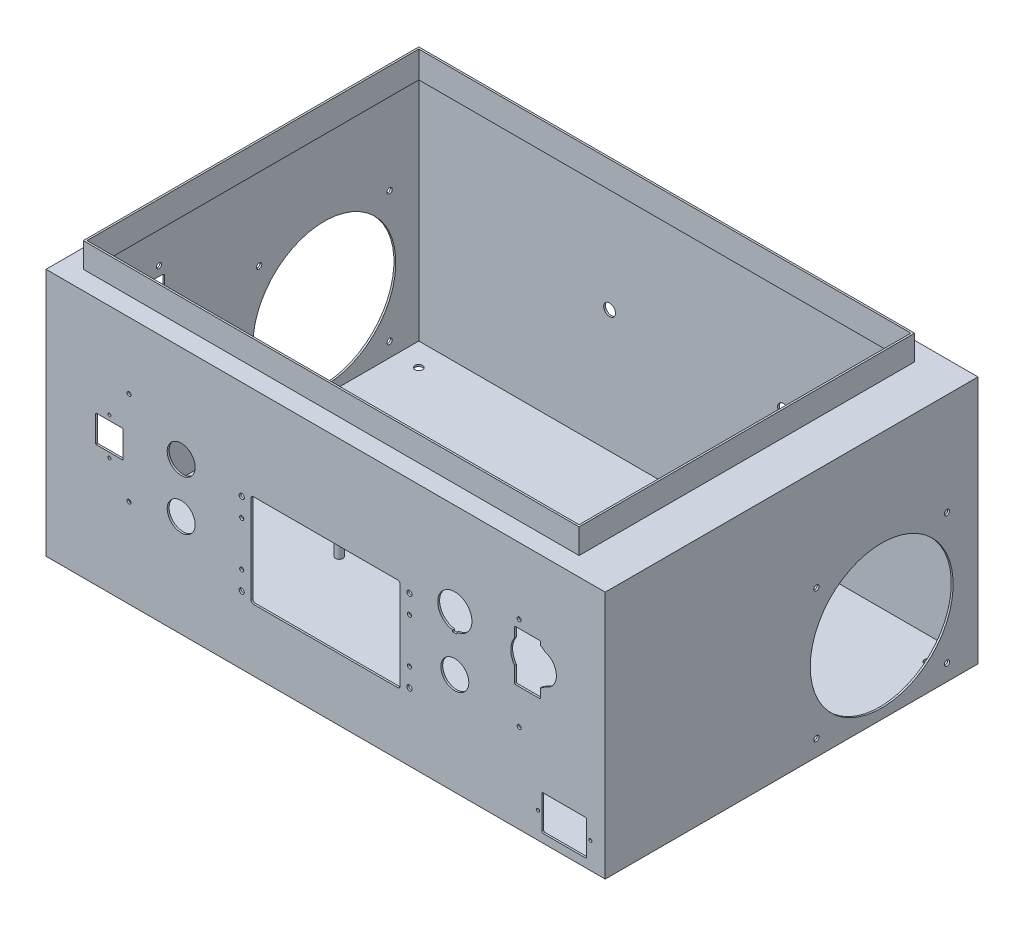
ISO-10303-21;
HEADER;
FILE_DESCRIPTION(('STEP AP214'),'2;1');
FILE_NAME('part.step','',(''),(''),'','','');
FILE_SCHEMA(('AUTOMOTIVE_DESIGN { 1 0 10303 214 1 1 1 1 }'));
ENDSEC;
DATA;
#1=APPLICATION_CONTEXT('core data for automotive mechanical design processes');
#2=APPLICATION_PROTOCOL_DEFINITION('international standard','automotive_design',2000,#1);
#3=PRODUCT_CONTEXT('',#1,'mechanical');
#4=PRODUCT('Part','Part','',(#3));
#5=PRODUCT_RELATED_PRODUCT_CATEGORY('part','',(#4));
#6=PRODUCT_DEFINITION_FORMATION('','',#4);
#7=PRODUCT_DEFINITION_CONTEXT('part definition',#1,'design');
#8=PRODUCT_DEFINITION('design','',#6,#7);
#9=PRODUCT_DEFINITION_SHAPE('','',#8);
#10=(LENGTH_UNIT() NAMED_UNIT(*) SI_UNIT(.MILLI.,.METRE.));
#11=(NAMED_UNIT(*) PLANE_ANGLE_UNIT() SI_UNIT($,.RADIAN.));
#12=(NAMED_UNIT(*) SI_UNIT($,.STERADIAN.) SOLID_ANGLE_UNIT());
#13=UNCERTAINTY_MEASURE_WITH_UNIT(LENGTH_MEASURE(1.E-05),#10,'distance_accuracy_value','');
#14=(GEOMETRIC_REPRESENTATION_CONTEXT(3) GLOBAL_UNCERTAINTY_ASSIGNED_CONTEXT((#13)) GLOBAL_UNIT_ASSIGNED_CONTEXT((#10,
#11,#12)) REPRESENTATION_CONTEXT('',''));
#15=CARTESIAN_POINT('',(0.,0.,0.));
#16=DIRECTION('',(0.,0.,1.));
#17=DIRECTION('',(1.,0.,0.));
#18=AXIS2_PLACEMENT_3D('',#15,#16,#17);
#19=CARTESIAN_POINT('',(0.,-98.5000000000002,0.));
#20=DIRECTION('',(0.,1.,0.));
#21=DIRECTION('',(0.,0.,1.));
#22=AXIS2_PLACEMENT_3D('',#19,#20,#21);
#23=PLANE('',#22);
#24=DIRECTION('',(-1.,0.,0.));
#25=VECTOR('',#24,1.);
#26=CARTESIAN_POINT('',(-25.,-98.5000000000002,-25.));
#27=LINE('',#26,#25);
#28=CARTESIAN_POINT('',(75.,-98.5000000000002,-25.));
#29=VERTEX_POINT('',#28);
#30=CARTESIAN_POINT('',(-25.,-98.5000000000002,-25.));
#31=VERTEX_POINT('',#30);
#32=EDGE_CURVE('P0_E81',#29,#31,#27,.T.);
#33=ORIENTED_EDGE('',*,*,#32,.T.);
#34=DIRECTION('',(0.,0.,-1.));
#35=VECTOR('',#34,1.);
#36=CARTESIAN_POINT('',(-25.,-98.5000000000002,-75.));
#37=LINE('',#36,#35);
#38=CARTESIAN_POINT('',(-25.,-98.5000000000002,-75.));
#39=VERTEX_POINT('',#38);
#40=EDGE_CURVE('P0_E68',#31,#39,#37,.T.);
#41=ORIENTED_EDGE('',*,*,#40,.T.);
#42=DIRECTION('',(1.,0.,0.));
#43=VECTOR('',#42,1.);
#44=CARTESIAN_POINT('',(-25.,-98.5000000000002,-75.));
#45=LINE('',#44,#43);
#46=CARTESIAN_POINT('',(75.,-98.5000000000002,-75.));
#47=VERTEX_POINT('',#46);
#48=EDGE_CURVE('P0_E55',#39,#47,#45,.T.);
#49=ORIENTED_EDGE('',*,*,#48,.T.);
#50=DIRECTION('',(0.,0.,1.));
#51=VECTOR('',#50,1.);
#52=CARTESIAN_POINT('',(75.,-98.5000000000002,-75.));
#53=LINE('',#52,#51);
#54=EDGE_CURVE('P0_E20',#47,#29,#53,.T.);
#55=ORIENTED_EDGE('',*,*,#54,.T.);
#56=EDGE_LOOP('',(#33,#41,#49,#55));
#57=FACE_BOUND('',#56,.T.);
#58=ADVANCED_FACE('P0_F17',(#57),#23,.F.);
#59=CARTESIAN_POINT('',(75.,-98.4000000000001,-75.));
#60=DIRECTION('',(-1.,0.,0.));
#61=DIRECTION('',(0.,0.,1.));
#62=AXIS2_PLACEMENT_3D('',#59,#60,#61);
#63=PLANE('',#62);
#64=DIRECTION('',(0.,1.,0.));
#65=VECTOR('',#64,1.);
#66=CARTESIAN_POINT('',(75.,-98.4000000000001,-75.));
#67=LINE('',#66,#65);
#68=CARTESIAN_POINT('',(75.,-98.4000000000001,-75.));
#69=VERTEX_POINT('',#68);
#70=EDGE_CURVE('P0_E61',#47,#69,#67,.T.);
#71=ORIENTED_EDGE('',*,*,#70,.T.);
#72=DIRECTION('',(0.,0.,1.));
#73=VECTOR('',#72,1.);
#74=CARTESIAN_POINT('',(75.,-98.4000000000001,0.));
#75=LINE('',#74,#73);
#76=CARTESIAN_POINT('',(75.,-98.4000000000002,-25.));
#77=VERTEX_POINT('',#76);
#78=EDGE_CURVE('P0_E83',#77,#69,#75,.F.);
#79=ORIENTED_EDGE('',*,*,#78,.F.);
#80=DIRECTION('',(0.,1.,0.));
#81=VECTOR('',#80,1.);
#82=CARTESIAN_POINT('',(75.,-98.4000000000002,-25.));
#83=LINE('',#82,#81);
#84=EDGE_CURVE('P0_E64',#77,#29,#83,.F.);
#85=ORIENTED_EDGE('',*,*,#84,.T.);
#86=ORIENTED_EDGE('',*,*,#54,.F.);
#87=EDGE_LOOP('',(#71,#79,#85,#86));
#88=FACE_BOUND('',#87,.T.);
#89=ADVANCED_FACE('P0_F60',(#88),#63,.F.);
#90=CARTESIAN_POINT('',(-25.,-98.4000000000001,-75.));
#91=DIRECTION('',(0.,0.,1.));
#92=DIRECTION('',(1.,0.,0.));
#93=AXIS2_PLACEMENT_3D('',#90,#91,#92);
#94=PLANE('',#93);
#95=DIRECTION('',(0.,1.,0.));
#96=VECTOR('',#95,1.);
#97=CARTESIAN_POINT('',(-25.,-98.4000000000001,-75.));
#98=LINE('',#97,#96);
#99=CARTESIAN_POINT('',(-25.,-98.4000000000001,-75.));
#100=VERTEX_POINT('',#99);
#101=EDGE_CURVE('P0_E70',#39,#100,#98,.T.);
#102=ORIENTED_EDGE('',*,*,#101,.T.);
#103=DIRECTION('',(1.,0.,0.));
#104=VECTOR('',#103,1.);
#105=CARTESIAN_POINT('',(0.,-98.4000000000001,-75.));
#106=LINE('',#105,#104);
#107=EDGE_CURVE('P0_E74',#69,#100,#106,.F.);
#108=ORIENTED_EDGE('',*,*,#107,.F.);
#109=ORIENTED_EDGE('',*,*,#70,.F.);
#110=ORIENTED_EDGE('',*,*,#48,.F.);
#111=EDGE_LOOP('',(#102,#108,#109,#110));
#112=FACE_BOUND('',#111,.T.);
#113=ADVANCED_FACE('P0_F72',(#112),#94,.F.);
#114=CARTESIAN_POINT('',(-25.,-98.4000000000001,-75.));
#115=DIRECTION('',(1.,0.,0.));
#116=DIRECTION('',(0.,0.,-1.));
#117=AXIS2_PLACEMENT_3D('',#114,#115,#116);
#118=PLANE('',#117);
#119=DIRECTION('',(0.,1.,0.));
#120=VECTOR('',#119,1.);
#121=CARTESIAN_POINT('',(-25.,-98.4000000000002,-25.));
#122=LINE('',#121,#120);
#123=CARTESIAN_POINT('',(-25.,-98.4000000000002,-25.));
#124=VERTEX_POINT('',#123);
#125=EDGE_CURVE('P0_E35',#31,#124,#122,.T.);
#126=ORIENTED_EDGE('',*,*,#125,.T.);
#127=DIRECTION('',(0.,0.,1.));
#128=VECTOR('',#127,1.);
#129=CARTESIAN_POINT('',(-25.,-98.4000000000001,0.));
#130=LINE('',#129,#128);
#131=EDGE_CURVE('P0_E26',#100,#124,#130,.T.);
#132=ORIENTED_EDGE('',*,*,#131,.F.);
#133=ORIENTED_EDGE('',*,*,#101,.F.);
#134=ORIENTED_EDGE('',*,*,#40,.F.);
#135=EDGE_LOOP('',(#126,#132,#133,#134));
#136=FACE_BOUND('',#135,.T.);
#137=ADVANCED_FACE('P0_F89',(#136),#118,.F.);
#138=CARTESIAN_POINT('',(-25.,-98.4000000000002,-25.));
#139=DIRECTION('',(0.,0.,-1.));
#140=DIRECTION('',(-1.,0.,0.));
#141=AXIS2_PLACEMENT_3D('',#138,#139,#140);
#142=PLANE('',#141);
#143=ORIENTED_EDGE('',*,*,#84,.F.);
#144=DIRECTION('',(1.,0.,0.));
#145=VECTOR('',#144,1.);
#146=CARTESIAN_POINT('',(0.,-98.4000000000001,-25.));
#147=LINE('',#146,#145);
#148=EDGE_CURVE('P0_E11',#124,#77,#147,.T.);
#149=ORIENTED_EDGE('',*,*,#148,.F.);
#150=ORIENTED_EDGE('',*,*,#125,.F.);
#151=ORIENTED_EDGE('',*,*,#32,.F.);
#152=EDGE_LOOP('',(#143,#149,#150,#151));
#153=FACE_BOUND('',#152,.T.);
#154=ADVANCED_FACE('P0_F91',(#153),#142,.F.);
#155=CARTESIAN_POINT('',(0.,-98.4000000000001,0.));
#156=DIRECTION('',(0.,1.,0.));
#157=DIRECTION('',(0.,0.,1.));
#158=AXIS2_PLACEMENT_3D('',#155,#156,#157);
#159=PLANE('',#158);
#160=ORIENTED_EDGE('',*,*,#131,.T.);
#161=ORIENTED_EDGE('',*,*,#148,.T.);
#162=ORIENTED_EDGE('',*,*,#78,.T.);
#163=ORIENTED_EDGE('',*,*,#107,.T.);
#164=EDGE_LOOP('',(#160,#161,#162,#163));
#165=FACE_BOUND('',#164,.T.);
#166=ADVANCED_FACE('P0_F88',(#165),#159,.T.);
#167=CLOSED_SHELL('',(#58,#89,#113,#137,#154,#166));
#168=MANIFOLD_SOLID_BREP('P0_B1',#167);
#169=CARTESIAN_POINT('',(207.,-50.8500000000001,136.5));
#170=DIRECTION('',(0.,0.,-1.));
#171=DIRECTION('',(0.,1.,0.));
#172=AXIS2_PLACEMENT_3D('',#169,#170,#171);
#173=PLANE('',#172);
#174=CARTESIAN_POINT('',(207.,-50.8500000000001,136.5));
#175=DIRECTION('',(0.,0.,1.));
#176=DIRECTION('',(0.,-1.,0.));
#177=AXIS2_PLACEMENT_3D('',#174,#175,#176);
#178=CIRCLE('',#177,3.);
#179=CARTESIAN_POINT('',(207.,-53.8500000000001,136.5));
#180=VERTEX_POINT('',#179);
#181=EDGE_CURVE('P1_E20',#180,#180,#178,.T.);
#182=ORIENTED_EDGE('',*,*,#181,.F.);
#183=EDGE_LOOP('',(#182));
#184=FACE_BOUND('',#183,.T.);
#185=ADVANCED_FACE('P1_F17',(#184),#173,.T.);
#186=CARTESIAN_POINT('',(-149.,0.,136.5));
#187=DIRECTION('',(0.,0.,-1.));
#188=DIRECTION('',(0.,1.,0.));
#189=AXIS2_PLACEMENT_3D('',#186,#187,#188);
#190=PLANE('',#189);
#191=CARTESIAN_POINT('',(-149.,0.,136.5));
#192=DIRECTION('',(0.,0.,1.));
#193=DIRECTION('',(0.,-1.,0.));
#194=AXIS2_PLACEMENT_3D('',#191,#192,#193);
#195=CIRCLE('',#194,3.);
#196=CARTESIAN_POINT('',(-149.,-3.,136.5));
#197=VERTEX_POINT('',#196);
#198=EDGE_CURVE('P1_E875',#197,#197,#195,.T.);
#199=ORIENTED_EDGE('',*,*,#198,.F.);
#200=EDGE_LOOP('',(#199));
#201=FACE_BOUND('',#200,.T.);
#202=ADVANCED_FACE('P1_F1255',(#201),#190,.T.);
#203=CARTESIAN_POINT('',(187.5,4.9194115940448,133.5));
#204=DIRECTION('',(1.,0.,0.));
#205=DIRECTION('',(0.,0.,-1.));
#206=AXIS2_PLACEMENT_3D('',#203,#204,#205);
#207=PLANE('',#206);
#208=DIRECTION('',(0.,0.,-1.));
#209=VECTOR('',#208,1.);
#210=CARTESIAN_POINT('',(187.5,98.5000000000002,148.5));
#211=LINE('',#210,#209);
#212=CARTESIAN_POINT('',(187.5,98.5000000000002,133.5));
#213=VERTEX_POINT('',#212);
#214=CARTESIAN_POINT('',(187.5,98.5000000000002,-133.5));
#215=VERTEX_POINT('',#214);
#216=EDGE_CURVE('P1_E873',#213,#215,#211,.T.);
#217=ORIENTED_EDGE('',*,*,#216,.F.);
#218=DIRECTION('',(0.,1.,0.));
#219=VECTOR('',#218,1.);
#220=CARTESIAN_POINT('',(187.5,144.899032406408,133.5));
#221=LINE('',#220,#219);
#222=CARTESIAN_POINT('',(187.5,120.,133.5));
#223=VERTEX_POINT('',#222);
#224=EDGE_CURVE('P1_E888',#223,#213,#221,.F.);
#225=ORIENTED_EDGE('',*,*,#224,.F.);
#226=DIRECTION('',(0.,0.,1.));
#227=VECTOR('',#226,1.);
#228=CARTESIAN_POINT('',(187.5,120.,135.));
#229=LINE('',#228,#227);
#230=CARTESIAN_POINT('',(187.5,120.,-133.5));
#231=VERTEX_POINT('',#230);
#232=EDGE_CURVE('P1_E876',#231,#223,#229,.T.);
#233=ORIENTED_EDGE('',*,*,#232,.F.);
#234=DIRECTION('',(0.,1.,0.));
#235=VECTOR('',#234,1.);
#236=CARTESIAN_POINT('',(187.5,144.899032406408,-133.5));
#237=LINE('',#236,#235);
#238=EDGE_CURVE('P1_E894',#215,#231,#237,.T.);
#239=ORIENTED_EDGE('',*,*,#238,.F.);
#240=EDGE_LOOP('',(#217,#225,#233,#239));
#241=FACE_BOUND('',#240,.T.);
#242=ADVANCED_FACE('P1_F1260',(#241),#207,.F.);
#243=CARTESIAN_POINT('',(187.5,144.899032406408,-133.5));
#244=DIRECTION('',(0.,0.,1.));
#245=DIRECTION('',(1.,0.,0.));
#246=AXIS2_PLACEMENT_3D('',#243,#244,#245);
#247=PLANE('',#246);
#248=DIRECTION('',(0.,1.,0.));
#249=VECTOR('',#248,1.);
#250=CARTESIAN_POINT('',(-208.5,4.9194115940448,-133.5));
#251=LINE('',#250,#249);
#252=CARTESIAN_POINT('',(-208.5,98.5000000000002,-133.5));
#253=VERTEX_POINT('',#252);
#254=CARTESIAN_POINT('',(-208.5,120.,-133.5));
#255=VERTEX_POINT('',#254);
#256=EDGE_CURVE('P1_E892',#253,#255,#251,.T.);
#257=ORIENTED_EDGE('',*,*,#256,.F.);
#258=DIRECTION('',(1.,0.,0.));
#259=VECTOR('',#258,1.);
#260=CARTESIAN_POINT('',(225.,98.5000000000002,-133.5));
#261=LINE('',#260,#259);
#262=EDGE_CURVE('P1_E871',#215,#253,#261,.F.);
#263=ORIENTED_EDGE('',*,*,#262,.F.);
#264=ORIENTED_EDGE('',*,*,#238,.T.);
#265=DIRECTION('',(1.,0.,0.));
#266=VECTOR('',#265,1.);
#267=CARTESIAN_POINT('',(-210.,120.,-133.5));
#268=LINE('',#267,#266);
#269=EDGE_CURVE('P1_E879',#255,#231,#268,.T.);
#270=ORIENTED_EDGE('',*,*,#269,.F.);
#271=EDGE_LOOP('',(#257,#263,#264,#270));
#272=FACE_BOUND('',#271,.T.);
#273=ADVANCED_FACE('P1_F1748',(#272),#247,.T.);
#274=CARTESIAN_POINT('',(-208.5,4.9194115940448,133.5));
#275=DIRECTION('',(1.,0.,0.));
#276=DIRECTION('',(0.,0.,-1.));
#277=AXIS2_PLACEMENT_3D('',#274,#275,#276);
#278=PLANE('',#277);
#279=DIRECTION('',(0.,1.,0.));
#280=VECTOR('',#279,1.);
#281=CARTESIAN_POINT('',(-208.5,144.899032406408,133.5));
#282=LINE('',#281,#280);
#283=CARTESIAN_POINT('',(-208.5,98.5000000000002,133.5));
#284=VERTEX_POINT('',#283);
#285=CARTESIAN_POINT('',(-208.5,120.,133.5));
#286=VERTEX_POINT('',#285);
#287=EDGE_CURVE('P1_E890',#284,#286,#282,.T.);
#288=ORIENTED_EDGE('',*,*,#287,.F.);
#289=DIRECTION('',(0.,0.,-1.));
#290=VECTOR('',#289,1.);
#291=CARTESIAN_POINT('',(-208.5,98.5000000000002,148.5));
#292=LINE('',#291,#290);
#293=EDGE_CURVE('P1_E869',#253,#284,#292,.F.);
#294=ORIENTED_EDGE('',*,*,#293,.F.);
#295=ORIENTED_EDGE('',*,*,#256,.T.);
#296=DIRECTION('',(0.,0.,1.));
#297=VECTOR('',#296,1.);
#298=CARTESIAN_POINT('',(-208.5,120.,135.));
#299=LINE('',#298,#297);
#300=EDGE_CURVE('P1_E882',#286,#255,#299,.F.);
#301=ORIENTED_EDGE('',*,*,#300,.F.);
#302=EDGE_LOOP('',(#288,#294,#295,#301));
#303=FACE_BOUND('',#302,.T.);
#304=ADVANCED_FACE('P1_F1744',(#303),#278,.T.);
#305=CARTESIAN_POINT('',(187.5,144.899032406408,133.5));
#306=DIRECTION('',(0.,0.,-1.));
#307=DIRECTION('',(-1.,0.,0.));
#308=AXIS2_PLACEMENT_3D('',#305,#306,#307);
#309=PLANE('',#308);
#310=ORIENTED_EDGE('',*,*,#224,.T.);
#311=DIRECTION('',(1.,0.,0.));
#312=VECTOR('',#311,1.);
#313=CARTESIAN_POINT('',(225.,98.5000000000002,133.5));
#314=LINE('',#313,#312);
#315=EDGE_CURVE('P1_E865',#284,#213,#314,.T.);
#316=ORIENTED_EDGE('',*,*,#315,.F.);
#317=ORIENTED_EDGE('',*,*,#287,.T.);
#318=DIRECTION('',(1.,0.,0.));
#319=VECTOR('',#318,1.);
#320=CARTESIAN_POINT('',(-210.,120.,133.5));
#321=LINE('',#320,#319);
#322=EDGE_CURVE('P1_E885',#223,#286,#321,.F.);
#323=ORIENTED_EDGE('',*,*,#322,.F.);
#324=EDGE_LOOP('',(#310,#316,#317,#323));
#325=FACE_BOUND('',#324,.T.);
#326=ADVANCED_FACE('P1_F1740',(#325),#309,.T.);
#327=CARTESIAN_POINT('',(-149.,30.,136.5));
#328=DIRECTION('',(0.,0.,-1.));
#329=DIRECTION('',(0.,1.,0.));
#330=AXIS2_PLACEMENT_3D('',#327,#328,#329);
#331=PLANE('',#330);
#332=CARTESIAN_POINT('',(-149.,30.,136.5));
#333=DIRECTION('',(0.,0.,1.));
#334=DIRECTION('',(0.,-1.,0.));
#335=AXIS2_PLACEMENT_3D('',#332,#333,#334);
#336=CIRCLE('',#335,3.);
#337=CARTESIAN_POINT('',(-149.,27.,136.5));
#338=VERTEX_POINT('',#337);
#339=EDGE_CURVE('P1_E868',#338,#338,#336,.T.);
#340=ORIENTED_EDGE('',*,*,#339,.F.);
#341=EDGE_LOOP('',(#340));
#342=FACE_BOUND('',#341,.T.);
#343=ADVANCED_FACE('P1_F1736',(#342),#331,.T.);
#344=CARTESIAN_POINT('',(189.5,46.5000000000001,136.5));
#345=DIRECTION('',(0.,0.,-1.));
#346=DIRECTION('',(0.,1.,0.));
#347=AXIS2_PLACEMENT_3D('',#344,#345,#346);
#348=PLANE('',#347);
#349=CARTESIAN_POINT('',(189.5,46.5000000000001,136.5));
#350=DIRECTION('',(0.,0.,1.));
#351=DIRECTION('',(0.,-1.,0.));
#352=AXIS2_PLACEMENT_3D('',#349,#350,#351);
#353=CIRCLE('',#352,3.);
#354=CARTESIAN_POINT('',(189.5,43.5000000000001,136.5));
#355=VERTEX_POINT('',#354);
#356=EDGE_CURVE('P1_E1242',#355,#355,#353,.T.);
#357=ORIENTED_EDGE('',*,*,#356,.F.);
#358=EDGE_LOOP('',(#357));
#359=FACE_BOUND('',#358,.T.);
#360=ADVANCED_FACE('P1_F1732',(#359),#348,.T.);
#361=CARTESIAN_POINT('',(177.,-50.85,136.5));
#362=DIRECTION('',(0.,0.,-1.));
#363=DIRECTION('',(0.,1.,0.));
#364=AXIS2_PLACEMENT_3D('',#361,#362,#363);
#365=PLANE('',#364);
#366=CARTESIAN_POINT('',(177.,-50.85,136.5));
#367=DIRECTION('',(0.,0.,1.));
#368=DIRECTION('',(0.,-1.,0.));
#369=AXIS2_PLACEMENT_3D('',#366,#367,#368);
#370=CIRCLE('',#369,3.);
#371=CARTESIAN_POINT('',(177.,-53.85,136.5));
#372=VERTEX_POINT('',#371);
#373=EDGE_CURVE('P1_E1239',#372,#372,#370,.T.);
#374=ORIENTED_EDGE('',*,*,#373,.F.);
#375=EDGE_LOOP('',(#374));
#376=FACE_BOUND('',#375,.T.);
#377=ADVANCED_FACE('P1_F1728',(#376),#365,.T.);
#378=CARTESIAN_POINT('',(-105.5,-86.5000000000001,33.5000000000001));
#379=DIRECTION('',(0.,1.,0.));
#380=DIRECTION('',(0.,0.,1.));
#381=AXIS2_PLACEMENT_3D('',#378,#379,#380);
#382=PLANE('',#381);
#383=CARTESIAN_POINT('',(-105.5,-86.5000000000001,33.5000000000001));
#384=DIRECTION('',(0.,1.,0.));
#385=DIRECTION('',(0.,0.,1.));
#386=AXIS2_PLACEMENT_3D('',#383,#384,#385);
#387=CIRCLE('',#386,3.);
#388=CARTESIAN_POINT('',(-105.5,-86.5000000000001,36.5));
#389=VERTEX_POINT('',#388);
#390=EDGE_CURVE('P1_E1236',#389,#389,#387,.F.);
#391=ORIENTED_EDGE('',*,*,#390,.F.);
#392=EDGE_LOOP('',(#391));
#393=FACE_BOUND('',#392,.T.);
#394=ADVANCED_FACE('P1_F1724',(#393),#382,.T.);
#395=CARTESIAN_POINT('',(84.5,-86.5000000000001,33.5000000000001));
#396=DIRECTION('',(0.,1.,0.));
#397=DIRECTION('',(0.,0.,1.));
#398=AXIS2_PLACEMENT_3D('',#395,#396,#397);
#399=PLANE('',#398);
#400=CARTESIAN_POINT('',(84.4999999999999,-86.5000000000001,33.5000000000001));
#401=DIRECTION('',(0.,1.,0.));
#402=DIRECTION('',(0.,0.,1.));
#403=AXIS2_PLACEMENT_3D('',#400,#401,#402);
#404=CIRCLE('',#403,3.);
#405=CARTESIAN_POINT('',(84.4999999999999,-86.5000000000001,36.5));
#406=VERTEX_POINT('',#405);
#407=EDGE_CURVE('P1_E864',#406,#406,#404,.F.);
#408=ORIENTED_EDGE('',*,*,#407,.F.);
#409=EDGE_LOOP('',(#408));
#410=FACE_BOUND('',#409,.T.);
#411=ADVANCED_FACE('P1_F1720',(#410),#399,.T.);
#412=CARTESIAN_POINT('',(-210.,120.,135.));
#413=DIRECTION('',(0.,1.,0.));
#414=DIRECTION('',(0.,0.,1.));
#415=AXIS2_PLACEMENT_3D('',#412,#413,#414);
#416=PLANE('',#415);
#417=ORIENTED_EDGE('',*,*,#269,.T.);
#418=ORIENTED_EDGE('',*,*,#232,.T.);
#419=ORIENTED_EDGE('',*,*,#322,.T.);
#420=ORIENTED_EDGE('',*,*,#300,.T.);
#421=EDGE_LOOP('',(#417,#418,#419,#420));
#422=FACE_BOUND('',#421,.T.);
#423=DIRECTION('',(0.,0.,1.));
#424=VECTOR('',#423,1.);
#425=CARTESIAN_POINT('',(189.,120.,-135.));
#426=LINE('',#425,#424);
#427=CARTESIAN_POINT('',(189.,120.,135.));
#428=VERTEX_POINT('',#427);
#429=CARTESIAN_POINT('',(189.,120.,-135.));
#430=VERTEX_POINT('',#429);
#431=EDGE_CURVE('P1_E797',#428,#430,#426,.F.);
#432=ORIENTED_EDGE('',*,*,#431,.T.);
#433=DIRECTION('',(1.,0.,0.));
#434=VECTOR('',#433,1.);
#435=CARTESIAN_POINT('',(-210.,120.,-135.));
#436=LINE('',#435,#434);
#437=CARTESIAN_POINT('',(-210.,120.,-135.));
#438=VERTEX_POINT('',#437);
#439=EDGE_CURVE('P1_E792',#430,#438,#436,.F.);
#440=ORIENTED_EDGE('',*,*,#439,.T.);
#441=DIRECTION('',(0.,0.,-1.));
#442=VECTOR('',#441,1.);
#443=CARTESIAN_POINT('',(-210.,120.,-135.));
#444=LINE('',#443,#442);
#445=CARTESIAN_POINT('',(-210.,120.,135.));
#446=VERTEX_POINT('',#445);
#447=EDGE_CURVE('P1_E786',#438,#446,#444,.F.);
#448=ORIENTED_EDGE('',*,*,#447,.T.);
#449=DIRECTION('',(-1.,0.,0.));
#450=VECTOR('',#449,1.);
#451=CARTESIAN_POINT('',(-210.,120.,135.));
#452=LINE('',#451,#450);
#453=EDGE_CURVE('P1_E802',#446,#428,#452,.F.);
#454=ORIENTED_EDGE('',*,*,#453,.T.);
#455=EDGE_LOOP('',(#432,#440,#448,#454));
#456=FACE_BOUND('',#455,.T.);
#457=ADVANCED_FACE('P1_F1716',(#422,#456),#416,.T.);
#458=CARTESIAN_POINT('',(207.,-50.8500000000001,136.5));
#459=DIRECTION('',(0.,0.,1.));
#460=DIRECTION('',(0.,-1.,0.));
#461=AXIS2_PLACEMENT_3D('',#458,#459,#460);
#462=CYLINDRICAL_SURFACE('',#461,3.);
#463=CARTESIAN_POINT('',(207.,-50.8500000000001,148.5));
#464=DIRECTION('',(0.,0.,1.));
#465=DIRECTION('',(0.,-1.,0.));
#466=AXIS2_PLACEMENT_3D('',#463,#464,#465);
#467=CIRCLE('',#466,3.);
#468=CARTESIAN_POINT('',(207.,-53.8500000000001,148.5));
#469=VERTEX_POINT('',#468);
#470=EDGE_CURVE('P1_E785',#469,#469,#467,.T.);
#471=ORIENTED_EDGE('',*,*,#470,.F.);
#472=EDGE_LOOP('',(#471));
#473=FACE_BOUND('',#472,.T.);
#474=ORIENTED_EDGE('',*,*,#181,.T.);
#475=EDGE_LOOP('',(#474));
#476=FACE_BOUND('',#475,.T.);
#477=ADVANCED_FACE('P1_F1252',(#473,#476),#462,.T.);
#478=CARTESIAN_POINT('',(-149.,0.,136.5));
#479=DIRECTION('',(0.,0.,1.));
#480=DIRECTION('',(0.,-1.,0.));
#481=AXIS2_PLACEMENT_3D('',#478,#479,#480);
#482=CYLINDRICAL_SURFACE('',#481,3.);
#483=CARTESIAN_POINT('',(-149.,0.,148.5));
#484=DIRECTION('',(0.,0.,1.));
#485=DIRECTION('',(0.,-1.,0.));
#486=AXIS2_PLACEMENT_3D('',#483,#484,#485);
#487=CIRCLE('',#486,3.);
#488=CARTESIAN_POINT('',(-149.,-3.,148.5));
#489=VERTEX_POINT('',#488);
#490=EDGE_CURVE('P1_E781',#489,#489,#487,.T.);
#491=ORIENTED_EDGE('',*,*,#490,.F.);
#492=EDGE_LOOP('',(#491));
#493=FACE_BOUND('',#492,.T.);
#494=ORIENTED_EDGE('',*,*,#198,.T.);
#495=EDGE_LOOP('',(#494));
#496=FACE_BOUND('',#495,.T.);
#497=ADVANCED_FACE('P1_F1709',(#493,#496),#482,.T.);
#498=CARTESIAN_POINT('',(225.,98.5000000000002,148.5));
#499=DIRECTION('',(0.,-1.,0.));
#500=DIRECTION('',(0.,0.,-1.));
#501=AXIS2_PLACEMENT_3D('',#498,#499,#500);
#502=PLANE('',#501);
#503=DIRECTION('',(1.,0.,0.));
#504=VECTOR('',#503,1.);
#505=CARTESIAN_POINT('',(225.,98.5000000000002,148.5));
#506=LINE('',#505,#504);
#507=CARTESIAN_POINT('',(-223.5,98.5000000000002,148.5));
#508=VERTEX_POINT('',#507);
#509=CARTESIAN_POINT('',(223.5,98.5000000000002,148.5));
#510=VERTEX_POINT('',#509);
#511=EDGE_CURVE('P1_E779',#508,#510,#506,.T.);
#512=ORIENTED_EDGE('',*,*,#511,.F.);
#513=DIRECTION('',(0.,0.,-1.));
#514=VECTOR('',#513,1.);
#515=CARTESIAN_POINT('',(-223.5,98.5000000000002,-148.5));
#516=LINE('',#515,#514);
#517=CARTESIAN_POINT('',(-223.5,98.5000000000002,-148.5));
#518=VERTEX_POINT('',#517);
#519=EDGE_CURVE('P1_E440',#518,#508,#516,.F.);
#520=ORIENTED_EDGE('',*,*,#519,.F.);
#521=DIRECTION('',(1.,0.,0.));
#522=VECTOR('',#521,1.);
#523=CARTESIAN_POINT('',(225.,98.5000000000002,-148.5));
#524=LINE('',#523,#522);
#525=CARTESIAN_POINT('',(223.5,98.5000000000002,-148.5));
#526=VERTEX_POINT('',#525);
#527=EDGE_CURVE('P1_E851',#526,#518,#524,.F.);
#528=ORIENTED_EDGE('',*,*,#527,.F.);
#529=DIRECTION('',(0.,0.,-1.));
#530=VECTOR('',#529,1.);
#531=CARTESIAN_POINT('',(223.5,98.5000000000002,-148.5));
#532=LINE('',#531,#530);
#533=EDGE_CURVE('P1_E861',#526,#510,#532,.F.);
#534=ORIENTED_EDGE('',*,*,#533,.T.);
#535=EDGE_LOOP('',(#512,#520,#528,#534));
#536=FACE_BOUND('',#535,.T.);
#537=ORIENTED_EDGE('',*,*,#293,.T.);
#538=ORIENTED_EDGE('',*,*,#315,.T.);
#539=ORIENTED_EDGE('',*,*,#216,.T.);
#540=ORIENTED_EDGE('',*,*,#262,.T.);
#541=EDGE_LOOP('',(#537,#538,#539,#540));
#542=FACE_BOUND('',#541,.T.);
#543=ADVANCED_FACE('P1_F1705',(#536,#542),#502,.T.);
#544=CARTESIAN_POINT('',(-149.,30.,136.5));
#545=DIRECTION('',(0.,0.,1.));
#546=DIRECTION('',(0.,-1.,0.));
#547=AXIS2_PLACEMENT_3D('',#544,#545,#546);
#548=CYLINDRICAL_SURFACE('',#547,3.);
#549=CARTESIAN_POINT('',(-149.,30.,148.5));
#550=DIRECTION('',(0.,0.,1.));
#551=DIRECTION('',(0.,-1.,0.));
#552=AXIS2_PLACEMENT_3D('',#549,#550,#551);
#553=CIRCLE('',#552,3.);
#554=CARTESIAN_POINT('',(-149.,27.,148.5));
#555=VERTEX_POINT('',#554);
#556=EDGE_CURVE('P1_E1217',#555,#555,#553,.T.);
#557=ORIENTED_EDGE('',*,*,#556,.F.);
#558=EDGE_LOOP('',(#557));
#559=FACE_BOUND('',#558,.T.);
#560=ORIENTED_EDGE('',*,*,#339,.T.);
#561=EDGE_LOOP('',(#560));
#562=FACE_BOUND('',#561,.T.);
#563=ADVANCED_FACE('P1_F1701',(#559,#562),#548,.T.);
#564=CARTESIAN_POINT('',(189.5,46.5000000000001,136.5));
#565=DIRECTION('',(0.,0.,1.));
#566=DIRECTION('',(0.,-1.,0.));
#567=AXIS2_PLACEMENT_3D('',#564,#565,#566);
#568=CYLINDRICAL_SURFACE('',#567,3.);
#569=CARTESIAN_POINT('',(189.5,46.5000000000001,148.5));
#570=DIRECTION('',(0.,0.,1.));
#571=DIRECTION('',(0.,-1.,0.));
#572=AXIS2_PLACEMENT_3D('',#569,#570,#571);
#573=CIRCLE('',#572,3.);
#574=CARTESIAN_POINT('',(189.5,43.5000000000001,148.5));
#575=VERTEX_POINT('',#574);
#576=EDGE_CURVE('P1_E1214',#575,#575,#573,.T.);
#577=ORIENTED_EDGE('',*,*,#576,.F.);
#578=EDGE_LOOP('',(#577));
#579=FACE_BOUND('',#578,.T.);
#580=ORIENTED_EDGE('',*,*,#356,.T.);
#581=EDGE_LOOP('',(#580));
#582=FACE_BOUND('',#581,.T.);
#583=ADVANCED_FACE('P1_F1697',(#579,#582),#568,.T.);
#584=CARTESIAN_POINT('',(177.,-50.85,136.5));
#585=DIRECTION('',(0.,0.,1.));
#586=DIRECTION('',(0.,-1.,0.));
#587=AXIS2_PLACEMENT_3D('',#584,#585,#586);
#588=CYLINDRICAL_SURFACE('',#587,3.);
#589=CARTESIAN_POINT('',(177.,-50.85,148.5));
#590=DIRECTION('',(0.,0.,1.));
#591=DIRECTION('',(0.,-1.,0.));
#592=AXIS2_PLACEMENT_3D('',#589,#590,#591);
#593=CIRCLE('',#592,3.);
#594=CARTESIAN_POINT('',(177.,-53.85,148.5));
#595=VERTEX_POINT('',#594);
#596=EDGE_CURVE('P1_E772',#595,#595,#593,.T.);
#597=ORIENTED_EDGE('',*,*,#596,.F.);
#598=EDGE_LOOP('',(#597));
#599=FACE_BOUND('',#598,.T.);
#600=ORIENTED_EDGE('',*,*,#373,.T.);
#601=EDGE_LOOP('',(#600));
#602=FACE_BOUND('',#601,.T.);
#603=ADVANCED_FACE('P1_F1693',(#599,#602),#588,.T.);
#604=CARTESIAN_POINT('',(-105.5,-121.12741699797,33.5000000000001));
#605=DIRECTION('',(0.,1.,0.));
#606=DIRECTION('',(0.,0.,1.));
#607=AXIS2_PLACEMENT_3D('',#604,#605,#606);
#608=CYLINDRICAL_SURFACE('',#607,3.);
#609=ORIENTED_EDGE('',*,*,#390,.T.);
#610=EDGE_LOOP('',(#609));
#611=FACE_BOUND('',#610,.T.);
#612=CARTESIAN_POINT('',(-105.5,-98.5000000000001,33.5000000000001));
#613=DIRECTION('',(0.,1.,0.));
#614=DIRECTION('',(0.,0.,1.));
#615=AXIS2_PLACEMENT_3D('',#612,#613,#614);
#616=CIRCLE('',#615,3.);
#617=CARTESIAN_POINT('',(-105.5,-98.5000000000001,36.5));
#618=VERTEX_POINT('',#617);
#619=EDGE_CURVE('P1_E764',#618,#618,#616,.F.);
#620=ORIENTED_EDGE('',*,*,#619,.F.);
#621=EDGE_LOOP('',(#620));
#622=FACE_BOUND('',#621,.T.);
#623=ADVANCED_FACE('P1_F1689',(#611,#622),#608,.T.);
#624=CARTESIAN_POINT('',(84.4999999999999,-121.12741699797,33.5000000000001));
#625=DIRECTION('',(0.,1.,0.));
#626=DIRECTION('',(0.,0.,1.));
#627=AXIS2_PLACEMENT_3D('',#624,#625,#626);
#628=CYLINDRICAL_SURFACE('',#627,3.);
#629=ORIENTED_EDGE('',*,*,#407,.T.);
#630=EDGE_LOOP('',(#629));
#631=FACE_BOUND('',#630,.T.);
#632=CARTESIAN_POINT('',(84.4999999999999,-98.5000000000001,33.5000000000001));
#633=DIRECTION('',(0.,1.,0.));
#634=DIRECTION('',(0.,0.,1.));
#635=AXIS2_PLACEMENT_3D('',#632,#633,#634);
#636=CIRCLE('',#635,3.);
#637=CARTESIAN_POINT('',(84.4999999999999,-98.5000000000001,36.5));
#638=VERTEX_POINT('',#637);
#639=EDGE_CURVE('P1_E1207',#638,#638,#636,.F.);
#640=ORIENTED_EDGE('',*,*,#639,.F.);
#641=EDGE_LOOP('',(#640));
#642=FACE_BOUND('',#641,.T.);
#643=ADVANCED_FACE('P1_F1685',(#631,#642),#628,.T.);
#644=CARTESIAN_POINT('',(223.5,98.5000000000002,-148.5));
#645=DIRECTION('',(1.,0.,0.));
#646=DIRECTION('',(0.,0.,-1.));
#647=AXIS2_PLACEMENT_3D('',#644,#645,#646);
#648=PLANE('',#647);
#649=DIRECTION('',(0.,0.,1.));
#650=VECTOR('',#649,1.);
#651=CARTESIAN_POINT('',(223.5,-98.5000000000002,148.5));
#652=LINE('',#651,#650);
#653=CARTESIAN_POINT('',(223.5,-98.5000000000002,148.5));
#654=VERTEX_POINT('',#653);
#655=CARTESIAN_POINT('',(223.5,-98.5000000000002,-148.5));
#656=VERTEX_POINT('',#655);
#657=EDGE_CURVE('P1_E767',#654,#656,#652,.F.);
#658=ORIENTED_EDGE('',*,*,#657,.F.);
#659=DIRECTION('',(0.,1.,0.));
#660=VECTOR('',#659,1.);
#661=CARTESIAN_POINT('',(223.5,98.5000000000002,148.5));
#662=LINE('',#661,#660);
#663=EDGE_CURVE('P1_E777',#510,#654,#662,.F.);
#664=ORIENTED_EDGE('',*,*,#663,.F.);
#665=ORIENTED_EDGE('',*,*,#533,.F.);
#666=DIRECTION('',(0.,-1.,0.));
#667=VECTOR('',#666,1.);
#668=CARTESIAN_POINT('',(223.5,98.5000000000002,-148.5));
#669=LINE('',#668,#667);
#670=EDGE_CURVE('P1_E858',#656,#526,#669,.F.);
#671=ORIENTED_EDGE('',*,*,#670,.F.);
#672=EDGE_LOOP('',(#658,#664,#665,#671));
#673=FACE_BOUND('',#672,.T.);
#674=CARTESIAN_POINT('',(223.5,18.0000000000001,-20.));
#675=DIRECTION('',(-1.,0.,0.));
#676=DIRECTION('',(0.,0.,1.));
#677=AXIS2_PLACEMENT_3D('',#674,#675,#676);
#678=CIRCLE('',#677,2.14999999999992);
#679=CARTESIAN_POINT('',(223.5,18.0000000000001,-17.8500000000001));
#680=VERTEX_POINT('',#679);
#681=EDGE_CURVE('P1_E1192',#680,#680,#678,.F.);
#682=ORIENTED_EDGE('',*,*,#681,.T.);
#683=EDGE_LOOP('',(#682));
#684=FACE_BOUND('',#683,.T.);
#685=CARTESIAN_POINT('',(223.5,-87.0000000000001,-19.9999999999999));
#686=DIRECTION('',(-1.,0.,0.));
#687=DIRECTION('',(0.,0.,1.));
#688=AXIS2_PLACEMENT_3D('',#685,#686,#687);
#689=CIRCLE('',#688,2.14999999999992);
#690=CARTESIAN_POINT('',(223.5,-87.0000000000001,-17.85));
#691=VERTEX_POINT('',#690);
#692=EDGE_CURVE('P1_E1195',#691,#691,#689,.F.);
#693=ORIENTED_EDGE('',*,*,#692,.T.);
#694=EDGE_LOOP('',(#693));
#695=FACE_BOUND('',#694,.T.);
#696=CARTESIAN_POINT('',(223.5,-87.0000000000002,-125.));
#697=DIRECTION('',(-1.,0.,0.));
#698=DIRECTION('',(0.,0.,1.));
#699=AXIS2_PLACEMENT_3D('',#696,#697,#698);
#700=CIRCLE('',#699,2.14999999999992);
#701=CARTESIAN_POINT('',(223.5,-87.0000000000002,-122.85));
#702=VERTEX_POINT('',#701);
#703=EDGE_CURVE('P1_E1198',#702,#702,#700,.F.);
#704=ORIENTED_EDGE('',*,*,#703,.T.);
#705=EDGE_LOOP('',(#704));
#706=FACE_BOUND('',#705,.T.);
#707=CARTESIAN_POINT('',(223.5,18.,-125.));
#708=DIRECTION('',(-1.,0.,0.));
#709=DIRECTION('',(0.,0.,1.));
#710=AXIS2_PLACEMENT_3D('',#707,#708,#709);
#711=CIRCLE('',#710,2.14999999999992);
#712=CARTESIAN_POINT('',(223.5,18.,-122.85));
#713=VERTEX_POINT('',#712);
#714=EDGE_CURVE('P1_E1201',#713,#713,#711,.F.);
#715=ORIENTED_EDGE('',*,*,#714,.T.);
#716=EDGE_LOOP('',(#715));
#717=FACE_BOUND('',#716,.T.);
#718=CARTESIAN_POINT('',(223.5,-34.5,-72.5000000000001));
#719=DIRECTION('',(-1.,0.,0.));
#720=DIRECTION('',(0.,0.,1.));
#721=AXIS2_PLACEMENT_3D('',#718,#719,#720);
#722=CIRCLE('',#721,57.5000000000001);
#723=CARTESIAN_POINT('',(223.5,-34.5,-15.));
#724=VERTEX_POINT('',#723);
#725=EDGE_CURVE('P1_E1204',#724,#724,#722,.F.);
#726=ORIENTED_EDGE('',*,*,#725,.T.);
#727=EDGE_LOOP('',(#726));
#728=FACE_BOUND('',#727,.T.);
#729=ADVANCED_FACE('P1_F1681',(#673,#684,#695,#706,#717,#728),#648,.F.);
#730=CARTESIAN_POINT('',(225.,98.5000000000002,-148.5));
#731=DIRECTION('',(0.,0.,1.));
#732=DIRECTION('',(0.,-1.,0.));
#733=AXIS2_PLACEMENT_3D('',#730,#731,#732);
#734=PLANE('',#733);
#735=ORIENTED_EDGE('',*,*,#527,.T.);
#736=DIRECTION('',(0.,1.,0.));
#737=VECTOR('',#736,1.);
#738=CARTESIAN_POINT('',(-223.5,98.5000000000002,-148.5));
#739=LINE('',#738,#737);
#740=CARTESIAN_POINT('',(-223.5,-98.5000000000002,-148.5));
#741=VERTEX_POINT('',#740);
#742=EDGE_CURVE('P1_E848',#741,#518,#739,.T.);
#743=ORIENTED_EDGE('',*,*,#742,.F.);
#744=DIRECTION('',(1.,0.,0.));
#745=VECTOR('',#744,1.);
#746=CARTESIAN_POINT('',(225.,-98.5000000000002,-148.5));
#747=LINE('',#746,#745);
#748=EDGE_CURVE('P1_E765',#656,#741,#747,.F.);
#749=ORIENTED_EDGE('',*,*,#748,.F.);
#750=ORIENTED_EDGE('',*,*,#670,.T.);
#751=EDGE_LOOP('',(#735,#743,#749,#750));
#752=FACE_BOUND('',#751,.T.);
#753=CARTESIAN_POINT('',(-70.0000000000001,0.,-148.5));
#754=DIRECTION('',(0.,0.,-1.));
#755=DIRECTION('',(0.,1.,0.));
#756=AXIS2_PLACEMENT_3D('',#753,#754,#755);
#757=CIRCLE('',#756,4.75000000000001);
#758=CARTESIAN_POINT('',(-70.0000000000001,4.75000000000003,-148.5));
#759=VERTEX_POINT('',#758);
#760=EDGE_CURVE('P1_E1186',#759,#759,#757,.T.);
#761=ORIENTED_EDGE('',*,*,#760,.T.);
#762=EDGE_LOOP('',(#761));
#763=FACE_BOUND('',#762,.T.);
#764=CARTESIAN_POINT('',(70.,0.,-148.5));
#765=DIRECTION('',(0.,0.,-1.));
#766=DIRECTION('',(0.,1.,0.));
#767=AXIS2_PLACEMENT_3D('',#764,#765,#766);
#768=CIRCLE('',#767,4.75000000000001);
#769=CARTESIAN_POINT('',(70.,4.74999999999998,-148.5));
#770=VERTEX_POINT('',#769);
#771=EDGE_CURVE('P1_E1189',#770,#770,#768,.T.);
#772=ORIENTED_EDGE('',*,*,#771,.T.);
#773=EDGE_LOOP('',(#772));
#774=FACE_BOUND('',#773,.T.);
#775=ADVANCED_FACE('P1_F1677',(#752,#763,#774),#734,.T.);
#776=CARTESIAN_POINT('',(-223.5,98.5000000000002,-148.5));
#777=DIRECTION('',(1.,0.,0.));
#778=DIRECTION('',(0.,0.,-1.));
#779=AXIS2_PLACEMENT_3D('',#776,#777,#778);
#780=PLANE('',#779);
#781=DIRECTION('',(0.,1.,0.));
#782=VECTOR('',#781,1.);
#783=CARTESIAN_POINT('',(-223.5,98.5000000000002,148.5));
#784=LINE('',#783,#782);
#785=CARTESIAN_POINT('',(-223.5,-98.5000000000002,148.5));
#786=VERTEX_POINT('',#785);
#787=EDGE_CURVE('P1_E773',#786,#508,#784,.T.);
#788=ORIENTED_EDGE('',*,*,#787,.F.);
#789=DIRECTION('',(0.,0.,1.));
#790=VECTOR('',#789,1.);
#791=CARTESIAN_POINT('',(-223.5,-98.5000000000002,148.5));
#792=LINE('',#791,#790);
#793=EDGE_CURVE('P1_E761',#741,#786,#792,.T.);
#794=ORIENTED_EDGE('',*,*,#793,.F.);
#795=ORIENTED_EDGE('',*,*,#742,.T.);
#796=ORIENTED_EDGE('',*,*,#519,.T.);
#797=EDGE_LOOP('',(#788,#794,#795,#796));
#798=FACE_BOUND('',#797,.T.);
#799=CARTESIAN_POINT('',(-223.5,18.0000000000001,-20.));
#800=DIRECTION('',(-1.,0.,0.));
#801=DIRECTION('',(0.,0.,1.));
#802=AXIS2_PLACEMENT_3D('',#799,#800,#801);
#803=CIRCLE('',#802,2.14999999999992);
#804=CARTESIAN_POINT('',(-223.5,18.0000000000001,-17.8500000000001));
#805=VERTEX_POINT('',#804);
#806=EDGE_CURVE('P1_E1144',#805,#805,#803,.T.);
#807=ORIENTED_EDGE('',*,*,#806,.T.);
#808=EDGE_LOOP('',(#807));
#809=FACE_BOUND('',#808,.T.);
#810=CARTESIAN_POINT('',(-223.5,-87.0000000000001,-19.9999999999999));
#811=DIRECTION('',(-1.,0.,0.));
#812=DIRECTION('',(0.,0.,1.));
#813=AXIS2_PLACEMENT_3D('',#810,#811,#812);
#814=CIRCLE('',#813,2.14999999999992);
#815=CARTESIAN_POINT('',(-223.5,-87.0000000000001,-17.85));
#816=VERTEX_POINT('',#815);
#817=EDGE_CURVE('P1_E1147',#816,#816,#814,.T.);
#818=ORIENTED_EDGE('',*,*,#817,.T.);
#819=EDGE_LOOP('',(#818));
#820=FACE_BOUND('',#819,.T.);
#821=CARTESIAN_POINT('',(-223.5,-87.0000000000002,-125.));
#822=DIRECTION('',(-1.,0.,0.));
#823=DIRECTION('',(0.,0.,1.));
#824=AXIS2_PLACEMENT_3D('',#821,#822,#823);
#825=CIRCLE('',#824,2.14999999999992);
#826=CARTESIAN_POINT('',(-223.5,-87.0000000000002,-122.85));
#827=VERTEX_POINT('',#826);
#828=EDGE_CURVE('P1_E1150',#827,#827,#825,.T.);
#829=ORIENTED_EDGE('',*,*,#828,.T.);
#830=EDGE_LOOP('',(#829));
#831=FACE_BOUND('',#830,.T.);
#832=CARTESIAN_POINT('',(-223.5,18.,-125.));
#833=DIRECTION('',(-1.,0.,0.));
#834=DIRECTION('',(0.,0.,1.));
#835=AXIS2_PLACEMENT_3D('',#832,#833,#834);
#836=CIRCLE('',#835,2.14999999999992);
#837=CARTESIAN_POINT('',(-223.5,18.,-122.85));
#838=VERTEX_POINT('',#837);
#839=EDGE_CURVE('P1_E1153',#838,#838,#836,.T.);
#840=ORIENTED_EDGE('',*,*,#839,.T.);
#841=EDGE_LOOP('',(#840));
#842=FACE_BOUND('',#841,.T.);
#843=CARTESIAN_POINT('',(-223.5,-34.5,-72.5000000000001));
#844=DIRECTION('',(-1.,0.,0.));
#845=DIRECTION('',(0.,0.,1.));
#846=AXIS2_PLACEMENT_3D('',#843,#844,#845);
#847=CIRCLE('',#846,57.5000000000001);
#848=CARTESIAN_POINT('',(-223.5,-34.5,-15.));
#849=VERTEX_POINT('',#848);
#850=EDGE_CURVE('P1_E736',#849,#849,#847,.T.);
#851=ORIENTED_EDGE('',*,*,#850,.T.);
#852=EDGE_LOOP('',(#851));
#853=FACE_BOUND('',#852,.T.);
#854=DIRECTION('',(0.,0.,1.));
#855=VECTOR('',#854,1.);
#856=CARTESIAN_POINT('',(-223.5,51.0000000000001,56.0000000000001));
#857=LINE('',#856,#855);
#858=CARTESIAN_POINT('',(-223.5,51.0000000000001,129.));
#859=VERTEX_POINT('',#858);
#860=CARTESIAN_POINT('',(-223.5,51.0000000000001,58.0000000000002));
#861=VERTEX_POINT('',#860);
#862=EDGE_CURVE('P1_E748',#859,#861,#857,.F.);
#863=ORIENTED_EDGE('',*,*,#862,.T.);
#864=CARTESIAN_POINT('',(-223.5,49.0000000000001,58.0000000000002));
#865=DIRECTION('',(1.,0.,0.));
#866=DIRECTION('',(0.,0.,-1.));
#867=AXIS2_PLACEMENT_3D('',#864,#865,#866);
#868=CIRCLE('',#867,2.);
#869=CARTESIAN_POINT('',(-223.5,49.0000000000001,56.0000000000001));
#870=VERTEX_POINT('',#869);
#871=EDGE_CURVE('P1_E744',#861,#870,#868,.F.);
#872=ORIENTED_EDGE('',*,*,#871,.T.);
#873=DIRECTION('',(0.,1.,0.));
#874=VECTOR('',#873,1.);
#875=CARTESIAN_POINT('',(-223.5,-69.0000000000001,56.0000000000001));
#876=LINE('',#875,#874);
#877=CARTESIAN_POINT('',(-223.5,-67.0000000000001,56.0000000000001));
#878=VERTEX_POINT('',#877);
#879=EDGE_CURVE('P1_E740',#870,#878,#876,.F.);
#880=ORIENTED_EDGE('',*,*,#879,.T.);
#881=CARTESIAN_POINT('',(-223.5,-67.0000000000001,58.0000000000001));
#882=DIRECTION('',(1.,0.,0.));
#883=DIRECTION('',(0.,0.,-1.));
#884=AXIS2_PLACEMENT_3D('',#881,#882,#883);
#885=CIRCLE('',#884,2.);
#886=CARTESIAN_POINT('',(-223.5,-69.0000000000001,58.0000000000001));
#887=VERTEX_POINT('',#886);
#888=EDGE_CURVE('P1_E732',#878,#887,#885,.F.);
#889=ORIENTED_EDGE('',*,*,#888,.T.);
#890=DIRECTION('',(0.,0.,-1.));
#891=VECTOR('',#890,1.);
#892=CARTESIAN_POINT('',(-223.5,-69.0000000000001,56.0000000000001));
#893=LINE('',#892,#891);
#894=CARTESIAN_POINT('',(-223.5,-69.0000000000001,129.));
#895=VERTEX_POINT('',#894);
#896=EDGE_CURVE('P1_E731',#887,#895,#893,.F.);
#897=ORIENTED_EDGE('',*,*,#896,.T.);
#898=CARTESIAN_POINT('',(-223.5,-67.0000000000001,129.));
#899=DIRECTION('',(1.,0.,0.));
#900=DIRECTION('',(0.,0.,-1.));
#901=AXIS2_PLACEMENT_3D('',#898,#899,#900);
#902=CIRCLE('',#901,2.);
#903=CARTESIAN_POINT('',(-223.5,-67.0000000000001,131.));
#904=VERTEX_POINT('',#903);
#905=EDGE_CURVE('P1_E760',#895,#904,#902,.F.);
#906=ORIENTED_EDGE('',*,*,#905,.T.);
#907=DIRECTION('',(0.,1.,0.));
#908=VECTOR('',#907,1.);
#909=CARTESIAN_POINT('',(-223.5,-69.0000000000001,131.));
#910=LINE('',#909,#908);
#911=CARTESIAN_POINT('',(-223.5,49.0000000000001,131.));
#912=VERTEX_POINT('',#911);
#913=EDGE_CURVE('P1_E756',#904,#912,#910,.T.);
#914=ORIENTED_EDGE('',*,*,#913,.T.);
#915=CARTESIAN_POINT('',(-223.5,49.0000000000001,129.));
#916=DIRECTION('',(1.,0.,0.));
#917=DIRECTION('',(0.,0.,-1.));
#918=AXIS2_PLACEMENT_3D('',#915,#916,#917);
#919=CIRCLE('',#918,2.);
#920=EDGE_CURVE('P1_E752',#912,#859,#919,.F.);
#921=ORIENTED_EDGE('',*,*,#920,.T.);
#922=EDGE_LOOP('',(#863,#872,#880,#889,#897,#906,#914,#921));
#923=FACE_BOUND('',#922,.T.);
#924=CARTESIAN_POINT('',(-223.5,58.5,60.5000000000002));
#925=DIRECTION('',(-1.,0.,0.));
#926=DIRECTION('',(0.,0.,1.));
#927=AXIS2_PLACEMENT_3D('',#924,#925,#926);
#928=CIRCLE('',#927,2.1);
#929=CARTESIAN_POINT('',(-223.5,58.5,62.6000000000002));
#930=VERTEX_POINT('',#929);
#931=EDGE_CURVE('P1_E1162',#930,#930,#928,.T.);
#932=ORIENTED_EDGE('',*,*,#931,.T.);
#933=EDGE_LOOP('',(#932));
#934=FACE_BOUND('',#933,.T.);
#935=CARTESIAN_POINT('',(-223.5,58.5,126.5));
#936=DIRECTION('',(-1.,0.,0.));
#937=DIRECTION('',(0.,0.,1.));
#938=AXIS2_PLACEMENT_3D('',#935,#936,#937);
#939=CIRCLE('',#938,2.09999999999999);
#940=CARTESIAN_POINT('',(-223.5,58.5,128.6));
#941=VERTEX_POINT('',#940);
#942=EDGE_CURVE('P1_E1165',#941,#941,#939,.T.);
#943=ORIENTED_EDGE('',*,*,#942,.T.);
#944=EDGE_LOOP('',(#943));
#945=FACE_BOUND('',#944,.T.);
#946=CARTESIAN_POINT('',(-223.5,-76.5000000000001,126.5));
#947=DIRECTION('',(-1.,0.,0.));
#948=DIRECTION('',(0.,0.,1.));
#949=AXIS2_PLACEMENT_3D('',#946,#947,#948);
#950=CIRCLE('',#949,2.09999999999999);
#951=CARTESIAN_POINT('',(-223.5,-76.5000000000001,128.6));
#952=VERTEX_POINT('',#951);
#953=EDGE_CURVE('P1_E1168',#952,#952,#950,.T.);
#954=ORIENTED_EDGE('',*,*,#953,.T.);
#955=EDGE_LOOP('',(#954));
#956=FACE_BOUND('',#955,.T.);
#957=CARTESIAN_POINT('',(-223.5,-76.5000000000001,60.5000000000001));
#958=DIRECTION('',(-1.,0.,0.));
#959=DIRECTION('',(0.,0.,1.));
#960=AXIS2_PLACEMENT_3D('',#957,#958,#959);
#961=CIRCLE('',#960,2.10000000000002);
#962=CARTESIAN_POINT('',(-223.5,-76.5000000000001,62.6000000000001));
#963=VERTEX_POINT('',#962);
#964=EDGE_CURVE('P1_E1171',#963,#963,#961,.T.);
#965=ORIENTED_EDGE('',*,*,#964,.T.);
#966=EDGE_LOOP('',(#965));
#967=FACE_BOUND('',#966,.T.);
#968=CARTESIAN_POINT('',(-223.5,58.5000000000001,75.5000000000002));
#969=DIRECTION('',(-1.,0.,0.));
#970=DIRECTION('',(0.,0.,1.));
#971=AXIS2_PLACEMENT_3D('',#968,#969,#970);
#972=CIRCLE('',#971,1.65);
#973=CARTESIAN_POINT('',(-223.5,58.5000000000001,77.1500000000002));
#974=VERTEX_POINT('',#973);
#975=EDGE_CURVE('P1_E1174',#974,#974,#972,.T.);
#976=ORIENTED_EDGE('',*,*,#975,.T.);
#977=EDGE_LOOP('',(#976));
#978=FACE_BOUND('',#977,.T.);
#979=CARTESIAN_POINT('',(-223.5,58.5000000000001,111.5));
#980=DIRECTION('',(-1.,0.,0.));
#981=DIRECTION('',(0.,0.,1.));
#982=AXIS2_PLACEMENT_3D('',#979,#980,#981);
#983=CIRCLE('',#982,1.65);
#984=CARTESIAN_POINT('',(-223.5,58.5000000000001,113.15));
#985=VERTEX_POINT('',#984);
#986=EDGE_CURVE('P1_E1177',#985,#985,#983,.T.);
#987=ORIENTED_EDGE('',*,*,#986,.T.);
#988=EDGE_LOOP('',(#987));
#989=FACE_BOUND('',#988,.T.);
#990=CARTESIAN_POINT('',(-223.5,-76.5000000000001,111.5));
#991=DIRECTION('',(-1.,0.,0.));
#992=DIRECTION('',(0.,0.,1.));
#993=AXIS2_PLACEMENT_3D('',#990,#991,#992);
#994=CIRCLE('',#993,1.65);
#995=CARTESIAN_POINT('',(-223.5,-76.5000000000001,113.15));
#996=VERTEX_POINT('',#995);
#997=EDGE_CURVE('P1_E1180',#996,#996,#994,.T.);
#998=ORIENTED_EDGE('',*,*,#997,.T.);
#999=EDGE_LOOP('',(#998));
#1000=FACE_BOUND('',#999,.T.);
#1001=CARTESIAN_POINT('',(-223.5,-76.5000000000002,75.5000000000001));
#1002=DIRECTION('',(-1.,0.,0.));
#1003=DIRECTION('',(0.,0.,1.));
#1004=AXIS2_PLACEMENT_3D('',#1001,#1002,#1003);
#1005=CIRCLE('',#1004,1.65);
#1006=CARTESIAN_POINT('',(-223.5,-76.5000000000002,77.1500000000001));
#1007=VERTEX_POINT('',#1006);
#1008=EDGE_CURVE('P1_E1183',#1007,#1007,#1005,.T.);
#1009=ORIENTED_EDGE('',*,*,#1008,.T.);
#1010=EDGE_LOOP('',(#1009));
#1011=FACE_BOUND('',#1010,.T.);
#1012=ADVANCED_FACE('P1_F1674',(#798,#809,#820,#831,#842,#853,#923,#934,#945,#956,#967,#978,
#989,#1000,#1011),#780,.T.);
#1013=CARTESIAN_POINT('',(-163.5,19.5,130.));
#1014=DIRECTION('',(0.,0.,-1.));
#1015=DIRECTION('',(-1.,0.,0.));
#1016=AXIS2_PLACEMENT_3D('',#1013,#1014,#1015);
#1017=CYLINDRICAL_SURFACE('',#1016,0.5);
#1018=DIRECTION('',(0.,0.,-1.));
#1019=VECTOR('',#1018,1.);
#1020=CARTESIAN_POINT('',(-163.,19.5000000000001,130.));
#1021=LINE('',#1020,#1019);
#1022=CARTESIAN_POINT('',(-163.,19.5,148.5));
#1023=VERTEX_POINT('',#1022);
#1024=CARTESIAN_POINT('',(-163.,19.5,150.));
#1025=VERTEX_POINT('',#1024);
#1026=EDGE_CURVE('P1_E443',#1023,#1025,#1021,.F.);
#1027=ORIENTED_EDGE('',*,*,#1026,.T.);
#1028=CARTESIAN_POINT('',(-163.5,19.5,150.));
#1029=DIRECTION('',(0.,0.,-1.));
#1030=DIRECTION('',(-1.,0.,0.));
#1031=AXIS2_PLACEMENT_3D('',#1028,#1029,#1030);
#1032=CIRCLE('',#1031,0.5);
#1033=CARTESIAN_POINT('',(-163.5,20.0000000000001,150.));
#1034=VERTEX_POINT('',#1033);
#1035=EDGE_CURVE('P1_E428',#1034,#1025,#1032,.T.);
#1036=ORIENTED_EDGE('',*,*,#1035,.F.);
#1037=DIRECTION('',(0.,0.,1.));
#1038=VECTOR('',#1037,1.);
#1039=CARTESIAN_POINT('',(-163.5,20.0000000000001,130.));
#1040=LINE('',#1039,#1038);
#1041=CARTESIAN_POINT('',(-163.5,20.0000000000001,148.5));
#1042=VERTEX_POINT('',#1041);
#1043=EDGE_CURVE('P1_E449',#1034,#1042,#1040,.F.);
#1044=ORIENTED_EDGE('',*,*,#1043,.T.);
#1045=CARTESIAN_POINT('',(-163.5,19.5,148.5));
#1046=DIRECTION('',(0.,0.,-1.));
#1047=DIRECTION('',(-1.,0.,0.));
#1048=AXIS2_PLACEMENT_3D('',#1045,#1046,#1047);
#1049=CIRCLE('',#1048,0.5);
#1050=EDGE_CURVE('P1_E445',#1023,#1042,#1049,.F.);
#1051=ORIENTED_EDGE('',*,*,#1050,.F.);
#1052=EDGE_LOOP('',(#1027,#1036,#1044,#1051));
#1053=FACE_BOUND('',#1052,.T.);
#1054=ADVANCED_FACE('P1_F444',(#1053),#1017,.F.);
#1055=CARTESIAN_POINT('',(-184.5,19.5000000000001,130.));
#1056=DIRECTION('',(0.,0.,-1.));
#1057=DIRECTION('',(-1.,0.,0.));
#1058=AXIS2_PLACEMENT_3D('',#1055,#1056,#1057);
#1059=CYLINDRICAL_SURFACE('',#1058,0.5);
#1060=DIRECTION('',(0.,0.,1.));
#1061=VECTOR('',#1060,1.);
#1062=CARTESIAN_POINT('',(-184.5,20.0000000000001,130.));
#1063=LINE('',#1062,#1061);
#1064=CARTESIAN_POINT('',(-184.5,20.0000000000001,148.5));
#1065=VERTEX_POINT('',#1064);
#1066=CARTESIAN_POINT('',(-184.5,20.0000000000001,150.));
#1067=VERTEX_POINT('',#1066);
#1068=EDGE_CURVE('P1_E609',#1065,#1067,#1063,.T.);
#1069=ORIENTED_EDGE('',*,*,#1068,.T.);
#1070=CARTESIAN_POINT('',(-184.5,19.5000000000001,150.));
#1071=DIRECTION('',(0.,0.,-1.));
#1072=DIRECTION('',(-1.,0.,0.));
#1073=AXIS2_PLACEMENT_3D('',#1070,#1071,#1072);
#1074=CIRCLE('',#1073,0.5);
#1075=CARTESIAN_POINT('',(-185.,19.5,150.));
#1076=VERTEX_POINT('',#1075);
#1077=EDGE_CURVE('P1_E439',#1076,#1067,#1074,.T.);
#1078=ORIENTED_EDGE('',*,*,#1077,.F.);
#1079=DIRECTION('',(0.,0.,1.));
#1080=VECTOR('',#1079,1.);
#1081=CARTESIAN_POINT('',(-185.,19.5,130.));
#1082=LINE('',#1081,#1080);
#1083=CARTESIAN_POINT('',(-185.,19.5,148.5));
#1084=VERTEX_POINT('',#1083);
#1085=EDGE_CURVE('P1_E603',#1076,#1084,#1082,.F.);
#1086=ORIENTED_EDGE('',*,*,#1085,.T.);
#1087=CARTESIAN_POINT('',(-184.5,19.5000000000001,148.5));
#1088=DIRECTION('',(0.,0.,-1.));
#1089=DIRECTION('',(-1.,0.,0.));
#1090=AXIS2_PLACEMENT_3D('',#1087,#1088,#1089);
#1091=CIRCLE('',#1090,0.5);
#1092=EDGE_CURVE('P1_E1220',#1065,#1084,#1091,.F.);
#1093=ORIENTED_EDGE('',*,*,#1092,.F.);
#1094=EDGE_LOOP('',(#1069,#1078,#1086,#1093));
#1095=FACE_BOUND('',#1094,.T.);
#1096=ADVANCED_FACE('P1_F1667',(#1095),#1059,.F.);
#1097=CARTESIAN_POINT('',(-184.5,-1.5,130.));
#1098=DIRECTION('',(0.,0.,-1.));
#1099=DIRECTION('',(-1.,0.,0.));
#1100=AXIS2_PLACEMENT_3D('',#1097,#1098,#1099);
#1101=CYLINDRICAL_SURFACE('',#1100,0.5);
#1102=DIRECTION('',(0.,0.,1.));
#1103=VECTOR('',#1102,1.);
#1104=CARTESIAN_POINT('',(-185.,-1.49999999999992,130.));
#1105=LINE('',#1104,#1103);
#1106=CARTESIAN_POINT('',(-185.,-1.49999999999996,148.5));
#1107=VERTEX_POINT('',#1106);
#1108=CARTESIAN_POINT('',(-185.,-1.49999999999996,150.));
#1109=VERTEX_POINT('',#1108);
#1110=EDGE_CURVE('P1_E606',#1107,#1109,#1105,.T.);
#1111=ORIENTED_EDGE('',*,*,#1110,.T.);
#1112=CARTESIAN_POINT('',(-184.5,-1.5,150.));
#1113=DIRECTION('',(0.,0.,-1.));
#1114=DIRECTION('',(-1.,0.,0.));
#1115=AXIS2_PLACEMENT_3D('',#1112,#1113,#1114);
#1116=CIRCLE('',#1115,0.5);
#1117=CARTESIAN_POINT('',(-184.5,-1.99999999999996,150.));
#1118=VERTEX_POINT('',#1117);
#1119=EDGE_CURVE('P1_E1231',#1118,#1109,#1116,.T.);
#1120=ORIENTED_EDGE('',*,*,#1119,.F.);
#1121=DIRECTION('',(0.,0.,-1.));
#1122=VECTOR('',#1121,1.);
#1123=CARTESIAN_POINT('',(-184.5,-2.,130.));
#1124=LINE('',#1123,#1122);
#1125=CARTESIAN_POINT('',(-184.5,-2.,148.5));
#1126=VERTEX_POINT('',#1125);
#1127=EDGE_CURVE('P1_E595',#1118,#1126,#1124,.T.);
#1128=ORIENTED_EDGE('',*,*,#1127,.T.);
#1129=CARTESIAN_POINT('',(-184.5,-1.5,148.5));
#1130=DIRECTION('',(0.,0.,-1.));
#1131=DIRECTION('',(-1.,0.,0.));
#1132=AXIS2_PLACEMENT_3D('',#1129,#1130,#1131);
#1133=CIRCLE('',#1132,0.5);
#1134=EDGE_CURVE('P1_E776',#1107,#1126,#1133,.F.);
#1135=ORIENTED_EDGE('',*,*,#1134,.F.);
#1136=EDGE_LOOP('',(#1111,#1120,#1128,#1135));
#1137=FACE_BOUND('',#1136,.T.);
#1138=ADVANCED_FACE('P1_F1663',(#1137),#1101,.F.);
#1139=CARTESIAN_POINT('',(-163.5,-1.49999999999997,130.));
#1140=DIRECTION('',(0.,0.,-1.));
#1141=DIRECTION('',(-1.,0.,0.));
#1142=AXIS2_PLACEMENT_3D('',#1139,#1140,#1141);
#1143=CYLINDRICAL_SURFACE('',#1142,0.5);
#1144=DIRECTION('',(0.,0.,-1.));
#1145=VECTOR('',#1144,1.);
#1146=CARTESIAN_POINT('',(-163.5,-2.,130.));
#1147=LINE('',#1146,#1145);
#1148=CARTESIAN_POINT('',(-163.5,-2.,148.5));
#1149=VERTEX_POINT('',#1148);
#1150=CARTESIAN_POINT('',(-163.5,-1.99999999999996,150.));
#1151=VERTEX_POINT('',#1150);
#1152=EDGE_CURVE('P1_E600',#1149,#1151,#1147,.F.);
#1153=ORIENTED_EDGE('',*,*,#1152,.T.);
#1154=CARTESIAN_POINT('',(-163.5,-1.49999999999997,150.));
#1155=DIRECTION('',(0.,0.,-1.));
#1156=DIRECTION('',(-1.,0.,0.));
#1157=AXIS2_PLACEMENT_3D('',#1154,#1155,#1156);
#1158=CIRCLE('',#1157,0.5);
#1159=CARTESIAN_POINT('',(-163.,-1.49999999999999,150.));
#1160=VERTEX_POINT('',#1159);
#1161=EDGE_CURVE('P1_E804',#1160,#1151,#1158,.T.);
#1162=ORIENTED_EDGE('',*,*,#1161,.F.);
#1163=DIRECTION('',(0.,0.,-1.));
#1164=VECTOR('',#1163,1.);
#1165=CARTESIAN_POINT('',(-163.,-1.5,130.));
#1166=LINE('',#1165,#1164);
#1167=CARTESIAN_POINT('',(-163.,-1.49999999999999,148.5));
#1168=VERTEX_POINT('',#1167);
#1169=EDGE_CURVE('P1_E455',#1160,#1168,#1166,.T.);
#1170=ORIENTED_EDGE('',*,*,#1169,.T.);
#1171=CARTESIAN_POINT('',(-163.5,-1.49999999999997,148.5));
#1172=DIRECTION('',(0.,0.,-1.));
#1173=DIRECTION('',(-1.,0.,0.));
#1174=AXIS2_PLACEMENT_3D('',#1171,#1172,#1173);
#1175=CIRCLE('',#1174,0.5);
#1176=EDGE_CURVE('P1_E1223',#1149,#1168,#1175,.F.);
#1177=ORIENTED_EDGE('',*,*,#1176,.F.);
#1178=EDGE_LOOP('',(#1153,#1162,#1170,#1177));
#1179=FACE_BOUND('',#1178,.T.);
#1180=ADVANCED_FACE('P1_F1659',(#1179),#1143,.F.);
#1181=CARTESIAN_POINT('',(-210.,120.,135.));
#1182=DIRECTION('',(0.,0.,-1.));
#1183=DIRECTION('',(-1.,0.,0.));
#1184=AXIS2_PLACEMENT_3D('',#1181,#1182,#1183);
#1185=PLANE('',#1184);
#1186=DIRECTION('',(0.,1.,0.));
#1187=VECTOR('',#1186,1.);
#1188=CARTESIAN_POINT('',(189.,120.,135.));
#1189=LINE('',#1188,#1187);
#1190=CARTESIAN_POINT('',(189.,100.,135.));
#1191=VERTEX_POINT('',#1190);
#1192=EDGE_CURVE('P1_E799',#1191,#428,#1189,.T.);
#1193=ORIENTED_EDGE('',*,*,#1192,.T.);
#1194=ORIENTED_EDGE('',*,*,#453,.F.);
#1195=DIRECTION('',(0.,1.,0.));
#1196=VECTOR('',#1195,1.);
#1197=CARTESIAN_POINT('',(-210.,120.,135.));
#1198=LINE('',#1197,#1196);
#1199=CARTESIAN_POINT('',(-210.,100.,135.));
#1200=VERTEX_POINT('',#1199);
#1201=EDGE_CURVE('P1_E782',#446,#1200,#1198,.F.);
#1202=ORIENTED_EDGE('',*,*,#1201,.T.);
#1203=DIRECTION('',(1.,0.,0.));
#1204=VECTOR('',#1203,1.);
#1205=CARTESIAN_POINT('',(225.,100.,135.));
#1206=LINE('',#1205,#1204);
#1207=EDGE_CURVE('P1_E563',#1200,#1191,#1206,.T.);
#1208=ORIENTED_EDGE('',*,*,#1207,.T.);
#1209=EDGE_LOOP('',(#1193,#1194,#1202,#1208));
#1210=FACE_BOUND('',#1209,.T.);
#1211=ADVANCED_FACE('P1_F1655',(#1210),#1185,.F.);
#1212=CARTESIAN_POINT('',(189.,120.,-135.));
#1213=DIRECTION('',(-1.,0.,0.));
#1214=DIRECTION('',(0.,0.,1.));
#1215=AXIS2_PLACEMENT_3D('',#1212,#1213,#1214);
#1216=PLANE('',#1215);
#1217=DIRECTION('',(0.,1.,0.));
#1218=VECTOR('',#1217,1.);
#1219=CARTESIAN_POINT('',(189.,120.,-135.));
#1220=LINE('',#1219,#1218);
#1221=CARTESIAN_POINT('',(189.,100.,-135.));
#1222=VERTEX_POINT('',#1221);
#1223=EDGE_CURVE('P1_E794',#1222,#430,#1220,.T.);
#1224=ORIENTED_EDGE('',*,*,#1223,.T.);
#1225=ORIENTED_EDGE('',*,*,#431,.F.);
#1226=ORIENTED_EDGE('',*,*,#1192,.F.);
#1227=DIRECTION('',(0.,0.,-1.));
#1228=VECTOR('',#1227,1.);
#1229=CARTESIAN_POINT('',(189.,100.,150.));
#1230=LINE('',#1229,#1228);
#1231=EDGE_CURVE('P1_E560',#1191,#1222,#1230,.T.);
#1232=ORIENTED_EDGE('',*,*,#1231,.T.);
#1233=EDGE_LOOP('',(#1224,#1225,#1226,#1232));
#1234=FACE_BOUND('',#1233,.T.);
#1235=ADVANCED_FACE('P1_F1651',(#1234),#1216,.F.);
#1236=CARTESIAN_POINT('',(-210.,120.,-135.));
#1237=DIRECTION('',(0.,0.,1.));
#1238=DIRECTION('',(1.,0.,0.));
#1239=AXIS2_PLACEMENT_3D('',#1236,#1237,#1238);
#1240=PLANE('',#1239);
#1241=DIRECTION('',(0.,1.,0.));
#1242=VECTOR('',#1241,1.);
#1243=CARTESIAN_POINT('',(-210.,120.,-135.));
#1244=LINE('',#1243,#1242);
#1245=CARTESIAN_POINT('',(-210.,100.,-135.));
#1246=VERTEX_POINT('',#1245);
#1247=EDGE_CURVE('P1_E789',#1246,#438,#1244,.T.);
#1248=ORIENTED_EDGE('',*,*,#1247,.T.);
#1249=ORIENTED_EDGE('',*,*,#439,.F.);
#1250=ORIENTED_EDGE('',*,*,#1223,.F.);
#1251=DIRECTION('',(1.,0.,0.));
#1252=VECTOR('',#1251,1.);
#1253=CARTESIAN_POINT('',(225.,100.,-135.));
#1254=LINE('',#1253,#1252);
#1255=EDGE_CURVE('P1_E557',#1222,#1246,#1254,.F.);
#1256=ORIENTED_EDGE('',*,*,#1255,.T.);
#1257=EDGE_LOOP('',(#1248,#1249,#1250,#1256));
#1258=FACE_BOUND('',#1257,.T.);
#1259=ADVANCED_FACE('P1_F1647',(#1258),#1240,.F.);
#1260=CARTESIAN_POINT('',(-210.,120.,-135.));
#1261=DIRECTION('',(1.,0.,0.));
#1262=DIRECTION('',(0.,0.,-1.));
#1263=AXIS2_PLACEMENT_3D('',#1260,#1261,#1262);
#1264=PLANE('',#1263);
#1265=ORIENTED_EDGE('',*,*,#1201,.F.);
#1266=ORIENTED_EDGE('',*,*,#447,.F.);
#1267=ORIENTED_EDGE('',*,*,#1247,.F.);
#1268=DIRECTION('',(0.,0.,-1.));
#1269=VECTOR('',#1268,1.);
#1270=CARTESIAN_POINT('',(-210.,100.,150.));
#1271=LINE('',#1270,#1269);
#1272=EDGE_CURVE('P1_E553',#1246,#1200,#1271,.F.);
#1273=ORIENTED_EDGE('',*,*,#1272,.T.);
#1274=EDGE_LOOP('',(#1265,#1266,#1267,#1273));
#1275=FACE_BOUND('',#1274,.T.);
#1276=ADVANCED_FACE('P1_F1643',(#1275),#1264,.F.);
#1277=CARTESIAN_POINT('',(225.,98.5000000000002,148.5));
#1278=DIRECTION('',(0.,0.,-1.));
#1279=DIRECTION('',(0.,1.,0.));
#1280=AXIS2_PLACEMENT_3D('',#1277,#1278,#1279);
#1281=PLANE('',#1280);
#1282=ORIENTED_EDGE('',*,*,#596,.T.);
#1283=EDGE_LOOP('',(#1282));
#1284=FACE_BOUND('',#1283,.T.);
#1285=ORIENTED_EDGE('',*,*,#576,.T.);
#1286=EDGE_LOOP('',(#1285));
#1287=FACE_BOUND('',#1286,.T.);
#1288=CARTESIAN_POINT('',(175.,-65.8500000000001,148.5));
#1289=DIRECTION('',(0.,0.,1.));
#1290=DIRECTION('',(1.,0.,0.));
#1291=AXIS2_PLACEMENT_3D('',#1288,#1289,#1290);
#1292=CIRCLE('',#1291,1.);
#1293=CARTESIAN_POINT('',(175.,-64.8500000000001,148.5));
#1294=VERTEX_POINT('',#1293);
#1295=CARTESIAN_POINT('',(174.,-65.8500000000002,148.5));
#1296=VERTEX_POINT('',#1295);
#1297=EDGE_CURVE('P1_E715',#1294,#1296,#1292,.T.);
#1298=ORIENTED_EDGE('',*,*,#1297,.T.);
#1299=DIRECTION('',(0.,-1.,0.));
#1300=VECTOR('',#1299,1.);
#1301=CARTESIAN_POINT('',(174.,-65.8500000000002,148.5));
#1302=LINE('',#1301,#1300);
#1303=CARTESIAN_POINT('',(174.,-92.1500000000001,148.5));
#1304=VERTEX_POINT('',#1303);
#1305=EDGE_CURVE('P1_E711',#1296,#1304,#1302,.T.);
#1306=ORIENTED_EDGE('',*,*,#1305,.T.);
#1307=CARTESIAN_POINT('',(175.,-92.1500000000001,148.5));
#1308=DIRECTION('',(0.,0.,1.));
#1309=DIRECTION('',(1.,0.,0.));
#1310=AXIS2_PLACEMENT_3D('',#1307,#1308,#1309);
#1311=CIRCLE('',#1310,1.);
#1312=CARTESIAN_POINT('',(175.,-93.1500000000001,148.5));
#1313=VERTEX_POINT('',#1312);
#1314=EDGE_CURVE('P1_E707',#1304,#1313,#1311,.T.);
#1315=ORIENTED_EDGE('',*,*,#1314,.T.);
#1316=DIRECTION('',(1.,0.,0.));
#1317=VECTOR('',#1316,1.);
#1318=CARTESIAN_POINT('',(175.,-93.1500000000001,148.5));
#1319=LINE('',#1318,#1317);
#1320=CARTESIAN_POINT('',(209.,-93.1500000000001,148.5));
#1321=VERTEX_POINT('',#1320);
#1322=EDGE_CURVE('P1_E703',#1313,#1321,#1319,.T.);
#1323=ORIENTED_EDGE('',*,*,#1322,.T.);
#1324=CARTESIAN_POINT('',(209.,-92.1500000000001,148.5));
#1325=DIRECTION('',(0.,0.,1.));
#1326=DIRECTION('',(1.,0.,0.));
#1327=AXIS2_PLACEMENT_3D('',#1324,#1325,#1326);
#1328=CIRCLE('',#1327,0.999999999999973);
#1329=CARTESIAN_POINT('',(210.,-92.1500000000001,148.5));
#1330=VERTEX_POINT('',#1329);
#1331=EDGE_CURVE('P1_E846',#1321,#1330,#1328,.T.);
#1332=ORIENTED_EDGE('',*,*,#1331,.T.);
#1333=DIRECTION('',(0.,1.,0.));
#1334=VECTOR('',#1333,1.);
#1335=CARTESIAN_POINT('',(210.,-65.8500000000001,148.5));
#1336=LINE('',#1335,#1334);
#1337=CARTESIAN_POINT('',(210.,-65.8500000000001,148.5));
#1338=VERTEX_POINT('',#1337);
#1339=EDGE_CURVE('P1_E727',#1330,#1338,#1336,.T.);
#1340=ORIENTED_EDGE('',*,*,#1339,.T.);
#1341=CARTESIAN_POINT('',(209.,-65.8500000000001,148.5));
#1342=DIRECTION('',(0.,0.,1.));
#1343=DIRECTION('',(1.,0.,0.));
#1344=AXIS2_PLACEMENT_3D('',#1341,#1342,#1343);
#1345=CIRCLE('',#1344,1.00000000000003);
#1346=CARTESIAN_POINT('',(209.,-64.8500000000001,148.5));
#1347=VERTEX_POINT('',#1346);
#1348=EDGE_CURVE('P1_E723',#1338,#1347,#1345,.T.);
#1349=ORIENTED_EDGE('',*,*,#1348,.T.);
#1350=DIRECTION('',(1.,0.,0.));
#1351=VECTOR('',#1350,1.);
#1352=CARTESIAN_POINT('',(175.,-64.8500000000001,148.5));
#1353=LINE('',#1352,#1351);
#1354=EDGE_CURVE('P1_E719',#1347,#1294,#1353,.F.);
#1355=ORIENTED_EDGE('',*,*,#1354,.T.);
#1356=EDGE_LOOP('',(#1298,#1306,#1315,#1323,#1332,#1340,#1349,#1355));
#1357=FACE_BOUND('',#1356,.T.);
#1358=CARTESIAN_POINT('',(171.,-79.0000000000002,148.5));
#1359=DIRECTION('',(0.,0.,1.));
#1360=DIRECTION('',(1.,0.,0.));
#1361=AXIS2_PLACEMENT_3D('',#1358,#1359,#1360);
#1362=CIRCLE('',#1361,1.24999999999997);
#1363=CARTESIAN_POINT('',(172.25,-79.0000000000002,148.5));
#1364=VERTEX_POINT('',#1363);
#1365=EDGE_CURVE('P1_E556',#1364,#1364,#1362,.T.);
#1366=ORIENTED_EDGE('',*,*,#1365,.T.);
#1367=EDGE_LOOP('',(#1366));
#1368=FACE_BOUND('',#1367,.T.);
#1369=CARTESIAN_POINT('',(213.,-79.0000000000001,148.5));
#1370=DIRECTION('',(0.,0.,1.));
#1371=DIRECTION('',(1.,0.,0.));
#1372=AXIS2_PLACEMENT_3D('',#1369,#1370,#1371);
#1373=CIRCLE('',#1372,1.25);
#1374=CARTESIAN_POINT('',(214.25,-79.0000000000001,148.5));
#1375=VERTEX_POINT('',#1374);
#1376=EDGE_CURVE('P1_E699',#1375,#1375,#1373,.T.);
#1377=ORIENTED_EDGE('',*,*,#1376,.T.);
#1378=EDGE_LOOP('',(#1377));
#1379=FACE_BOUND('',#1378,.T.);
#1380=CARTESIAN_POINT('',(-174.,-6.00000000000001,148.5));
#1381=DIRECTION('',(0.,0.,1.));
#1382=DIRECTION('',(0.,-1.,0.));
#1383=AXIS2_PLACEMENT_3D('',#1380,#1381,#1382);
#1384=CIRCLE('',#1383,1.24999999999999);
#1385=CARTESIAN_POINT('',(-174.,-7.24999999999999,148.5));
#1386=VERTEX_POINT('',#1385);
#1387=EDGE_CURVE('P1_E1131',#1386,#1386,#1384,.T.);
#1388=ORIENTED_EDGE('',*,*,#1387,.T.);
#1389=EDGE_LOOP('',(#1388));
#1390=FACE_BOUND('',#1389,.T.);
#1391=CARTESIAN_POINT('',(-174.,24.,148.5));
#1392=DIRECTION('',(0.,0.,1.));
#1393=DIRECTION('',(0.,-1.,0.));
#1394=AXIS2_PLACEMENT_3D('',#1391,#1392,#1393);
#1395=CIRCLE('',#1394,1.25);
#1396=CARTESIAN_POINT('',(-174.,22.75,148.5));
#1397=VERTEX_POINT('',#1396);
#1398=EDGE_CURVE('P1_E1128',#1397,#1397,#1395,.T.);
#1399=ORIENTED_EDGE('',*,*,#1398,.T.);
#1400=EDGE_LOOP('',(#1399));
#1401=FACE_BOUND('',#1400,.T.);
#1402=CARTESIAN_POINT('',(-67.5,5.49999999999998,148.5));
#1403=DIRECTION('',(0.,0.,1.));
#1404=DIRECTION('',(1.,0.,0.));
#1405=AXIS2_PLACEMENT_3D('',#1402,#1403,#1404);
#1406=CIRCLE('',#1405,1.64999999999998);
#1407=CARTESIAN_POINT('',(-65.85,5.49999999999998,148.5));
#1408=VERTEX_POINT('',#1407);
#1409=EDGE_CURVE('P1_E1125',#1408,#1408,#1406,.T.);
#1410=ORIENTED_EDGE('',*,*,#1409,.T.);
#1411=EDGE_LOOP('',(#1410));
#1412=FACE_BOUND('',#1411,.T.);
#1413=CARTESIAN_POINT('',(-67.5,-30.5,148.5));
#1414=DIRECTION('',(0.,0.,1.));
#1415=DIRECTION('',(1.,0.,0.));
#1416=AXIS2_PLACEMENT_3D('',#1413,#1414,#1415);
#1417=CIRCLE('',#1416,1.64999999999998);
#1418=CARTESIAN_POINT('',(-65.85,-30.5,148.5));
#1419=VERTEX_POINT('',#1418);
#1420=EDGE_CURVE('P1_E1122',#1419,#1419,#1417,.T.);
#1421=ORIENTED_EDGE('',*,*,#1420,.T.);
#1422=EDGE_LOOP('',(#1421));
#1423=FACE_BOUND('',#1422,.T.);
#1424=CARTESIAN_POINT('',(67.5,-30.5,148.5));
#1425=DIRECTION('',(0.,0.,1.));
#1426=DIRECTION('',(1.,0.,0.));
#1427=AXIS2_PLACEMENT_3D('',#1424,#1425,#1426);
#1428=CIRCLE('',#1427,1.64999999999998);
#1429=CARTESIAN_POINT('',(69.15,-30.5,148.5));
#1430=VERTEX_POINT('',#1429);
#1431=EDGE_CURVE('P1_E1119',#1430,#1430,#1428,.T.);
#1432=ORIENTED_EDGE('',*,*,#1431,.T.);
#1433=EDGE_LOOP('',(#1432));
#1434=FACE_BOUND('',#1433,.T.);
#1435=CARTESIAN_POINT('',(67.5,5.50000000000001,148.5));
#1436=DIRECTION('',(0.,0.,1.));
#1437=DIRECTION('',(1.,0.,0.));
#1438=AXIS2_PLACEMENT_3D('',#1435,#1436,#1437);
#1439=CIRCLE('',#1438,1.64999999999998);
#1440=CARTESIAN_POINT('',(69.15,5.50000000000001,148.5));
#1441=VERTEX_POINT('',#1440);
#1442=EDGE_CURVE('P1_E1116',#1441,#1441,#1439,.T.);
#1443=ORIENTED_EDGE('',*,*,#1442,.T.);
#1444=EDGE_LOOP('',(#1443));
#1445=FACE_BOUND('',#1444,.T.);
#1446=CARTESIAN_POINT('',(-158.2,-28.5,148.5));
#1447=DIRECTION('',(0.,0.,1.));
#1448=DIRECTION('',(1.,0.,0.));
#1449=AXIS2_PLACEMENT_3D('',#1446,#1447,#1448);
#1450=CIRCLE('',#1449,1.64999999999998);
#1451=CARTESIAN_POINT('',(-156.55,-28.5,148.5));
#1452=VERTEX_POINT('',#1451);
#1453=EDGE_CURVE('P1_E1113',#1452,#1452,#1450,.T.);
#1454=ORIENTED_EDGE('',*,*,#1453,.T.);
#1455=EDGE_LOOP('',(#1454));
#1456=FACE_BOUND('',#1455,.T.);
#1457=CARTESIAN_POINT('',(-158.2,46.5000000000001,148.5));
#1458=DIRECTION('',(0.,0.,1.));
#1459=DIRECTION('',(1.,0.,0.));
#1460=AXIS2_PLACEMENT_3D('',#1457,#1458,#1459);
#1461=CIRCLE('',#1460,1.64999999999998);
#1462=CARTESIAN_POINT('',(-156.55,46.5000000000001,148.5));
#1463=VERTEX_POINT('',#1462);
#1464=EDGE_CURVE('P1_E1110',#1463,#1463,#1461,.T.);
#1465=ORIENTED_EDGE('',*,*,#1464,.T.);
#1466=EDGE_LOOP('',(#1465));
#1467=FACE_BOUND('',#1466,.T.);
#1468=CARTESIAN_POINT('',(155.8,46.5000000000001,148.5));
#1469=DIRECTION('',(0.,0.,1.));
#1470=DIRECTION('',(1.,0.,0.));
#1471=AXIS2_PLACEMENT_3D('',#1468,#1469,#1470);
#1472=CIRCLE('',#1471,1.64999999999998);
#1473=CARTESIAN_POINT('',(157.45,46.5000000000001,148.5));
#1474=VERTEX_POINT('',#1473);
#1475=EDGE_CURVE('P1_E1107',#1474,#1474,#1472,.T.);
#1476=ORIENTED_EDGE('',*,*,#1475,.T.);
#1477=EDGE_LOOP('',(#1476));
#1478=FACE_BOUND('',#1477,.T.);
#1479=CARTESIAN_POINT('',(155.8,-28.5,148.5));
#1480=DIRECTION('',(0.,0.,1.));
#1481=DIRECTION('',(1.,0.,0.));
#1482=AXIS2_PLACEMENT_3D('',#1479,#1480,#1481);
#1483=CIRCLE('',#1482,1.64999999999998);
#1484=CARTESIAN_POINT('',(157.45,-28.5,148.5));
#1485=VERTEX_POINT('',#1484);
#1486=EDGE_CURVE('P1_E1104',#1485,#1485,#1483,.T.);
#1487=ORIENTED_EDGE('',*,*,#1486,.T.);
#1488=EDGE_LOOP('',(#1487));
#1489=FACE_BOUND('',#1488,.T.);
#1490=CARTESIAN_POINT('',(-67.5,20.5,148.5));
#1491=DIRECTION('',(0.,0.,1.));
#1492=DIRECTION('',(0.,-1.,0.));
#1493=AXIS2_PLACEMENT_3D('',#1490,#1491,#1492);
#1494=CIRCLE('',#1493,2.09999999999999);
#1495=CARTESIAN_POINT('',(-67.5,18.4,148.5));
#1496=VERTEX_POINT('',#1495);
#1497=EDGE_CURVE('P1_E1101',#1496,#1496,#1494,.T.);
#1498=ORIENTED_EDGE('',*,*,#1497,.T.);
#1499=EDGE_LOOP('',(#1498));
#1500=FACE_BOUND('',#1499,.T.);
#1501=CARTESIAN_POINT('',(67.5,20.5,148.5));
#1502=DIRECTION('',(0.,0.,1.));
#1503=DIRECTION('',(0.,-1.,0.));
#1504=AXIS2_PLACEMENT_3D('',#1501,#1502,#1503);
#1505=CIRCLE('',#1504,2.09999999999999);
#1506=CARTESIAN_POINT('',(67.5,18.4,148.5));
#1507=VERTEX_POINT('',#1506);
#1508=EDGE_CURVE('P1_E1098',#1507,#1507,#1505,.T.);
#1509=ORIENTED_EDGE('',*,*,#1508,.T.);
#1510=EDGE_LOOP('',(#1509));
#1511=FACE_BOUND('',#1510,.T.);
#1512=CARTESIAN_POINT('',(-67.5,-45.5000000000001,148.5));
#1513=DIRECTION('',(0.,0.,1.));
#1514=DIRECTION('',(0.,-1.,0.));
#1515=AXIS2_PLACEMENT_3D('',#1512,#1513,#1514);
#1516=CIRCLE('',#1515,2.09999999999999);
#1517=CARTESIAN_POINT('',(-67.5,-47.6000000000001,148.5));
#1518=VERTEX_POINT('',#1517);
#1519=EDGE_CURVE('P1_E1095',#1518,#1518,#1516,.T.);
#1520=ORIENTED_EDGE('',*,*,#1519,.T.);
#1521=EDGE_LOOP('',(#1520));
#1522=FACE_BOUND('',#1521,.T.);
#1523=CARTESIAN_POINT('',(67.5,-45.5,148.5));
#1524=DIRECTION('',(0.,0.,1.));
#1525=DIRECTION('',(0.,-1.,0.));
#1526=AXIS2_PLACEMENT_3D('',#1523,#1524,#1525);
#1527=CIRCLE('',#1526,2.09999999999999);
#1528=CARTESIAN_POINT('',(67.5,-47.6,148.5));
#1529=VERTEX_POINT('',#1528);
#1530=EDGE_CURVE('P1_E1092',#1529,#1529,#1527,.T.);
#1531=ORIENTED_EDGE('',*,*,#1530,.T.);
#1532=EDGE_LOOP('',(#1531));
#1533=FACE_BOUND('',#1532,.T.);
#1534=ORIENTED_EDGE('',*,*,#556,.T.);
#1535=EDGE_LOOP('',(#1534));
#1536=FACE_BOUND('',#1535,.T.);
#1537=CARTESIAN_POINT('',(153.,0.500000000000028,148.5));
#1538=DIRECTION('',(0.,0.,1.));
#1539=DIRECTION('',(1.,0.,0.));
#1540=AXIS2_PLACEMENT_3D('',#1537,#1538,#1539);
#1541=CIRCLE('',#1540,1.);
#1542=CARTESIAN_POINT('',(152.,0.500000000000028,148.5));
#1543=VERTEX_POINT('',#1542);
#1544=CARTESIAN_POINT('',(153.,-0.499999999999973,148.5));
#1545=VERTEX_POINT('',#1544);
#1546=EDGE_CURVE('P1_E655',#1543,#1545,#1541,.T.);
#1547=ORIENTED_EDGE('',*,*,#1546,.T.);
#1548=DIRECTION('',(1.,0.,0.));
#1549=VECTOR('',#1548,1.);
#1550=CARTESIAN_POINT('',(153.,-0.499999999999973,148.5));
#1551=LINE('',#1550,#1549);
#1552=CARTESIAN_POINT('',(172.,-0.499999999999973,148.5));
#1553=VERTEX_POINT('',#1552);
#1554=EDGE_CURVE('P1_E651',#1545,#1553,#1551,.T.);
#1555=ORIENTED_EDGE('',*,*,#1554,.T.);
#1556=CARTESIAN_POINT('',(172.,0.500000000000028,148.5));
#1557=DIRECTION('',(0.,0.,1.));
#1558=DIRECTION('',(1.,0.,0.));
#1559=AXIS2_PLACEMENT_3D('',#1556,#1557,#1558);
#1560=CIRCLE('',#1559,1.);
#1561=CARTESIAN_POINT('',(173.,0.500000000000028,148.5));
#1562=VERTEX_POINT('',#1561);
#1563=EDGE_CURVE('P1_E647',#1553,#1562,#1560,.T.);
#1564=ORIENTED_EDGE('',*,*,#1563,.T.);
#1565=DIRECTION('',(0.,1.,0.));
#1566=VECTOR('',#1565,1.);
#1567=CARTESIAN_POINT('',(173.,7.30306154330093,148.5));
#1568=LINE('',#1567,#1566);
#1569=CARTESIAN_POINT('',(173.,7.30306154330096,148.5));
#1570=VERTEX_POINT('',#1569);
#1571=EDGE_CURVE('P1_E643',#1562,#1570,#1568,.T.);
#1572=ORIENTED_EDGE('',*,*,#1571,.T.);
#1573=CARTESIAN_POINT('',(165.5,22.0000000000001,148.5));
#1574=DIRECTION('',(0.,0.,1.));
#1575=DIRECTION('',(1.,0.,0.));
#1576=AXIS2_PLACEMENT_3D('',#1573,#1574,#1575);
#1577=CIRCLE('',#1576,16.5);
#1578=CARTESIAN_POINT('',(176.5625,9.75781499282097,148.5));
#1579=VERTEX_POINT('',#1578);
#1580=EDGE_CURVE('P1_E695',#1570,#1579,#1577,.T.);
#1581=ORIENTED_EDGE('',*,*,#1580,.T.);
#1582=CARTESIAN_POINT('',(173.,22.0000000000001,148.5));
#1583=DIRECTION('',(0.,0.,1.));
#1584=DIRECTION('',(1.,0.,0.));
#1585=AXIS2_PLACEMENT_3D('',#1582,#1583,#1584);
#1586=CIRCLE('',#1585,12.75);
#1587=CARTESIAN_POINT('',(176.5625,34.2421850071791,148.5));
#1588=VERTEX_POINT('',#1587);
#1589=EDGE_CURVE('P1_E691',#1579,#1588,#1586,.T.);
#1590=ORIENTED_EDGE('',*,*,#1589,.T.);
#1591=CARTESIAN_POINT('',(165.5,22.0000000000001,148.5));
#1592=DIRECTION('',(0.,0.,1.));
#1593=DIRECTION('',(1.,0.,0.));
#1594=AXIS2_PLACEMENT_3D('',#1591,#1592,#1593);
#1595=CIRCLE('',#1594,16.5);
#1596=CARTESIAN_POINT('',(173.,36.6969384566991,148.5));
#1597=VERTEX_POINT('',#1596);
#1598=EDGE_CURVE('P1_E687',#1588,#1597,#1595,.T.);
#1599=ORIENTED_EDGE('',*,*,#1598,.T.);
#1600=DIRECTION('',(0.,1.,0.));
#1601=VECTOR('',#1600,1.);
#1602=CARTESIAN_POINT('',(173.,39.0000000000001,148.5));
#1603=LINE('',#1602,#1601);
#1604=CARTESIAN_POINT('',(173.,39.0000000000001,148.5));
#1605=VERTEX_POINT('',#1604);
#1606=EDGE_CURVE('P1_E683',#1597,#1605,#1603,.T.);
#1607=ORIENTED_EDGE('',*,*,#1606,.T.);
#1608=CARTESIAN_POINT('',(172.,39.0000000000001,148.5));
#1609=DIRECTION('',(0.,0.,1.));
#1610=DIRECTION('',(1.,0.,0.));
#1611=AXIS2_PLACEMENT_3D('',#1608,#1609,#1610);
#1612=CIRCLE('',#1611,1.);
#1613=CARTESIAN_POINT('',(172.,40.0000000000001,148.5));
#1614=VERTEX_POINT('',#1613);
#1615=EDGE_CURVE('P1_E679',#1605,#1614,#1612,.T.);
#1616=ORIENTED_EDGE('',*,*,#1615,.T.);
#1617=DIRECTION('',(1.,0.,0.));
#1618=VECTOR('',#1617,1.);
#1619=CARTESIAN_POINT('',(153.,40.0000000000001,148.5));
#1620=LINE('',#1619,#1618);
#1621=CARTESIAN_POINT('',(153.,40.0000000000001,148.5));
#1622=VERTEX_POINT('',#1621);
#1623=EDGE_CURVE('P1_E675',#1614,#1622,#1620,.F.);
#1624=ORIENTED_EDGE('',*,*,#1623,.T.);
#1625=CARTESIAN_POINT('',(153.,39.0000000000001,148.5));
#1626=DIRECTION('',(0.,0.,1.));
#1627=DIRECTION('',(1.,0.,0.));
#1628=AXIS2_PLACEMENT_3D('',#1625,#1626,#1627);
#1629=CIRCLE('',#1628,1.);
#1630=CARTESIAN_POINT('',(152.,39.,148.5));
#1631=VERTEX_POINT('',#1630);
#1632=EDGE_CURVE('P1_E671',#1622,#1631,#1629,.T.);
#1633=ORIENTED_EDGE('',*,*,#1632,.T.);
#1634=DIRECTION('',(0.,1.,0.));
#1635=VECTOR('',#1634,1.);
#1636=CARTESIAN_POINT('',(152.,39.0000000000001,148.5));
#1637=LINE('',#1636,#1635);
#1638=CARTESIAN_POINT('',(152.,31.4868329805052,148.5));
#1639=VERTEX_POINT('',#1638);
#1640=EDGE_CURVE('P1_E667',#1631,#1639,#1637,.F.);
#1641=ORIENTED_EDGE('',*,*,#1640,.T.);
#1642=CARTESIAN_POINT('',(165.5,22.0000000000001,148.5));
#1643=DIRECTION('',(0.,0.,1.));
#1644=DIRECTION('',(1.,0.,0.));
#1645=AXIS2_PLACEMENT_3D('',#1642,#1643,#1644);
#1646=CIRCLE('',#1645,16.5);
#1647=CARTESIAN_POINT('',(152.,12.5131670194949,148.5));
#1648=VERTEX_POINT('',#1647);
#1649=EDGE_CURVE('P1_E663',#1639,#1648,#1646,.T.);
#1650=ORIENTED_EDGE('',*,*,#1649,.T.);
#1651=DIRECTION('',(0.,1.,0.));
#1652=VECTOR('',#1651,1.);
#1653=CARTESIAN_POINT('',(152.,12.5131670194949,148.5));
#1654=LINE('',#1653,#1652);
#1655=EDGE_CURVE('P1_E659',#1648,#1543,#1654,.F.);
#1656=ORIENTED_EDGE('',*,*,#1655,.T.);
#1657=EDGE_LOOP('',(#1547,#1555,#1564,#1572,#1581,#1590,#1599,#1607,#1616,#1624,#1633,#1641,
#1650,#1656));
#1658=FACE_BOUND('',#1657,.T.);
#1659=CARTESIAN_POINT('',(104.,-18.,148.5));
#1660=DIRECTION('',(0.,0.,1.));
#1661=DIRECTION('',(1.,0.,0.));
#1662=AXIS2_PLACEMENT_3D('',#1659,#1660,#1661);
#1663=CIRCLE('',#1662,11.25);
#1664=CARTESIAN_POINT('',(115.25,-18.,148.5));
#1665=VERTEX_POINT('',#1664);
#1666=EDGE_CURVE('P1_E824',#1665,#1665,#1663,.T.);
#1667=ORIENTED_EDGE('',*,*,#1666,.T.);
#1668=EDGE_LOOP('',(#1667));
#1669=FACE_BOUND('',#1668,.T.);
#1670=DIRECTION('',(0.,1.,0.));
#1671=VECTOR('',#1670,1.);
#1672=CARTESIAN_POINT('',(105.7,11.,148.5));
#1673=LINE('',#1672,#1671);
#1674=CARTESIAN_POINT('',(105.7,11.0000000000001,148.5));
#1675=VERTEX_POINT('',#1674);
#1676=CARTESIAN_POINT('',(105.7,12.3554956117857,148.5));
#1677=VERTEX_POINT('',#1676);
#1678=EDGE_CURVE('P1_E633',#1675,#1677,#1673,.T.);
#1679=ORIENTED_EDGE('',*,*,#1678,.T.);
#1680=CARTESIAN_POINT('',(104.,26.0000000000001,148.5));
#1681=DIRECTION('',(0.,0.,1.));
#1682=DIRECTION('',(1.,0.,0.));
#1683=AXIS2_PLACEMENT_3D('',#1680,#1681,#1682);
#1684=CIRCLE('',#1683,13.7500000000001);
#1685=CARTESIAN_POINT('',(102.3,12.3554956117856,148.5));
#1686=VERTEX_POINT('',#1685);
#1687=EDGE_CURVE('P1_E623',#1677,#1686,#1684,.T.);
#1688=ORIENTED_EDGE('',*,*,#1687,.T.);
#1689=DIRECTION('',(0.,-1.,0.));
#1690=VECTOR('',#1689,1.);
#1691=CARTESIAN_POINT('',(102.3,12.3554956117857,148.5));
#1692=LINE('',#1691,#1690);
#1693=CARTESIAN_POINT('',(102.3,11.0000000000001,148.5));
#1694=VERTEX_POINT('',#1693);
#1695=EDGE_CURVE('P1_E619',#1686,#1694,#1692,.T.);
#1696=ORIENTED_EDGE('',*,*,#1695,.T.);
#1697=DIRECTION('',(1.,0.,0.));
#1698=VECTOR('',#1697,1.);
#1699=CARTESIAN_POINT('',(102.3,11.,148.5));
#1700=LINE('',#1699,#1698);
#1701=EDGE_CURVE('P1_E637',#1694,#1675,#1700,.T.);
#1702=ORIENTED_EDGE('',*,*,#1701,.T.);
#1703=EDGE_LOOP('',(#1679,#1688,#1696,#1702));
#1704=FACE_BOUND('',#1703,.T.);
#1705=CARTESIAN_POINT('',(-116.2,-18.,148.5));
#1706=DIRECTION('',(0.,0.,1.));
#1707=DIRECTION('',(1.,0.,0.));
#1708=AXIS2_PLACEMENT_3D('',#1705,#1706,#1707);
#1709=CIRCLE('',#1708,11.25);
#1710=CARTESIAN_POINT('',(-104.95,-18.,148.5));
#1711=VERTEX_POINT('',#1710);
#1712=EDGE_CURVE('P1_E820',#1711,#1711,#1709,.T.);
#1713=ORIENTED_EDGE('',*,*,#1712,.T.);
#1714=EDGE_LOOP('',(#1713));
#1715=FACE_BOUND('',#1714,.T.);
#1716=CARTESIAN_POINT('',(-116.2,22.,148.5));
#1717=DIRECTION('',(0.,0.,1.));
#1718=DIRECTION('',(1.,0.,0.));
#1719=AXIS2_PLACEMENT_3D('',#1716,#1717,#1718);
#1720=CIRCLE('',#1719,11.25);
#1721=CARTESIAN_POINT('',(-104.95,22.,148.5));
#1722=VERTEX_POINT('',#1721);
#1723=EDGE_CURVE('P1_E614',#1722,#1722,#1720,.T.);
#1724=ORIENTED_EDGE('',*,*,#1723,.T.);
#1725=EDGE_LOOP('',(#1724));
#1726=FACE_BOUND('',#1725,.T.);
#1727=DIRECTION('',(1.,0.,0.));
#1728=VECTOR('',#1727,1.);
#1729=CARTESIAN_POINT('',(-185.,20.0000000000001,148.5));
#1730=LINE('',#1729,#1728);
#1731=EDGE_CURVE('P1_E611',#1042,#1065,#1730,.F.);
#1732=ORIENTED_EDGE('',*,*,#1731,.T.);
#1733=ORIENTED_EDGE('',*,*,#1092,.T.);
#1734=DIRECTION('',(0.,1.,0.));
#1735=VECTOR('',#1734,1.);
#1736=CARTESIAN_POINT('',(-185.,20.0000000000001,148.5));
#1737=LINE('',#1736,#1735);
#1738=EDGE_CURVE('P1_E599',#1084,#1107,#1737,.F.);
#1739=ORIENTED_EDGE('',*,*,#1738,.T.);
#1740=ORIENTED_EDGE('',*,*,#1134,.T.);
#1741=DIRECTION('',(1.,0.,0.));
#1742=VECTOR('',#1741,1.);
#1743=CARTESIAN_POINT('',(-185.,-2.,148.5));
#1744=LINE('',#1743,#1742);
#1745=EDGE_CURVE('P1_E598',#1126,#1149,#1744,.T.);
#1746=ORIENTED_EDGE('',*,*,#1745,.T.);
#1747=ORIENTED_EDGE('',*,*,#1176,.T.);
#1748=DIRECTION('',(0.,1.,0.));
#1749=VECTOR('',#1748,1.);
#1750=CARTESIAN_POINT('',(-163.,20.,148.5));
#1751=LINE('',#1750,#1749);
#1752=EDGE_CURVE('P1_E450',#1168,#1023,#1751,.T.);
#1753=ORIENTED_EDGE('',*,*,#1752,.T.);
#1754=ORIENTED_EDGE('',*,*,#1050,.T.);
#1755=EDGE_LOOP('',(#1732,#1733,#1739,#1740,#1746,#1747,#1753,#1754));
#1756=FACE_BOUND('',#1755,.T.);
#1757=DIRECTION('',(1.,0.,0.));
#1758=VECTOR('',#1757,1.);
#1759=CARTESIAN_POINT('',(60.,-50.,148.5));
#1760=LINE('',#1759,#1758);
#1761=CARTESIAN_POINT('',(-58.,-50.,148.5));
#1762=VERTEX_POINT('',#1761);
#1763=CARTESIAN_POINT('',(58.,-50.,148.5));
#1764=VERTEX_POINT('',#1763);
#1765=EDGE_CURVE('P1_E585',#1762,#1764,#1760,.T.);
#1766=ORIENTED_EDGE('',*,*,#1765,.T.);
#1767=CARTESIAN_POINT('',(58.,-48.,148.5));
#1768=DIRECTION('',(0.,0.,-1.));
#1769=DIRECTION('',(-1.,0.,0.));
#1770=AXIS2_PLACEMENT_3D('',#1767,#1768,#1769);
#1771=CIRCLE('',#1770,2.);
#1772=CARTESIAN_POINT('',(60.,-48.,148.5));
#1773=VERTEX_POINT('',#1772);
#1774=EDGE_CURVE('P1_E581',#1764,#1773,#1771,.F.);
#1775=ORIENTED_EDGE('',*,*,#1774,.T.);
#1776=DIRECTION('',(0.,1.,0.));
#1777=VECTOR('',#1776,1.);
#1778=CARTESIAN_POINT('',(60.,-50.,148.5));
#1779=LINE('',#1778,#1777);
#1780=CARTESIAN_POINT('',(60.,23.,148.5));
#1781=VERTEX_POINT('',#1780);
#1782=EDGE_CURVE('P1_E577',#1773,#1781,#1779,.T.);
#1783=ORIENTED_EDGE('',*,*,#1782,.T.);
#1784=CARTESIAN_POINT('',(58.,23.,148.5));
#1785=DIRECTION('',(0.,0.,-1.));
#1786=DIRECTION('',(-1.,0.,0.));
#1787=AXIS2_PLACEMENT_3D('',#1784,#1785,#1786);
#1788=CIRCLE('',#1787,2.);
#1789=CARTESIAN_POINT('',(58.,25.,148.5));
#1790=VERTEX_POINT('',#1789);
#1791=EDGE_CURVE('P1_E573',#1781,#1790,#1788,.F.);
#1792=ORIENTED_EDGE('',*,*,#1791,.T.);
#1793=DIRECTION('',(-1.,0.,0.));
#1794=VECTOR('',#1793,1.);
#1795=CARTESIAN_POINT('',(60.,25.,148.5));
#1796=LINE('',#1795,#1794);
#1797=CARTESIAN_POINT('',(-58.0000000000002,25.,148.5));
#1798=VERTEX_POINT('',#1797);
#1799=EDGE_CURVE('P1_E566',#1790,#1798,#1796,.T.);
#1800=ORIENTED_EDGE('',*,*,#1799,.T.);
#1801=CARTESIAN_POINT('',(-58.0000000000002,23.,148.5));
#1802=DIRECTION('',(0.,0.,-1.));
#1803=DIRECTION('',(-1.,0.,0.));
#1804=AXIS2_PLACEMENT_3D('',#1801,#1802,#1803);
#1805=CIRCLE('',#1804,2.);
#1806=CARTESIAN_POINT('',(-60.,23.,148.5));
#1807=VERTEX_POINT('',#1806);
#1808=EDGE_CURVE('P1_E594',#1798,#1807,#1805,.F.);
#1809=ORIENTED_EDGE('',*,*,#1808,.T.);
#1810=DIRECTION('',(0.,1.,0.));
#1811=VECTOR('',#1810,1.);
#1812=CARTESIAN_POINT('',(-60.,-50.,148.5));
#1813=LINE('',#1812,#1811);
#1814=CARTESIAN_POINT('',(-60.,-48.,148.5));
#1815=VERTEX_POINT('',#1814);
#1816=EDGE_CURVE('P1_E593',#1807,#1815,#1813,.F.);
#1817=ORIENTED_EDGE('',*,*,#1816,.T.);
#1818=CARTESIAN_POINT('',(-58.,-48.,148.5));
#1819=DIRECTION('',(0.,0.,-1.));
#1820=DIRECTION('',(-1.,0.,0.));
#1821=AXIS2_PLACEMENT_3D('',#1818,#1819,#1820);
#1822=CIRCLE('',#1821,2.);
#1823=EDGE_CURVE('P1_E589',#1815,#1762,#1822,.F.);
#1824=ORIENTED_EDGE('',*,*,#1823,.T.);
#1825=EDGE_LOOP('',(#1766,#1775,#1783,#1792,#1800,#1809,#1817,#1824));
#1826=FACE_BOUND('',#1825,.T.);
#1827=DIRECTION('',(1.,0.,0.));
#1828=VECTOR('',#1827,1.);
#1829=CARTESIAN_POINT('',(225.,-98.5000000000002,148.5));
#1830=LINE('',#1829,#1828);
#1831=EDGE_CURVE('P1_E769',#786,#654,#1830,.T.);
#1832=ORIENTED_EDGE('',*,*,#1831,.F.);
#1833=ORIENTED_EDGE('',*,*,#787,.T.);
#1834=ORIENTED_EDGE('',*,*,#511,.T.);
#1835=ORIENTED_EDGE('',*,*,#663,.T.);
#1836=EDGE_LOOP('',(#1832,#1833,#1834,#1835));
#1837=FACE_BOUND('',#1836,.T.);
#1838=ORIENTED_EDGE('',*,*,#490,.T.);
#1839=EDGE_LOOP('',(#1838));
#1840=FACE_BOUND('',#1839,.T.);
#1841=ORIENTED_EDGE('',*,*,#470,.T.);
#1842=EDGE_LOOP('',(#1841));
#1843=FACE_BOUND('',#1842,.T.);
#1844=ADVANCED_FACE('P1_F1639',(#1284,#1287,#1357,#1368,#1379,#1390,#1401,#1412,#1423,#1434,
#1445,#1456,#1467,#1478,#1489,#1500,#1511,#1522,#1533,#1536,#1658,#1669,#1704,#1715,#1726,#1756,
#1826,#1837,#1840,#1843),#1281,.T.);
#1845=CARTESIAN_POINT('',(225.,-98.5000000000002,148.5));
#1846=DIRECTION('',(0.,1.,0.));
#1847=DIRECTION('',(0.,0.,1.));
#1848=AXIS2_PLACEMENT_3D('',#1845,#1846,#1847);
#1849=PLANE('',#1848);
#1850=ORIENTED_EDGE('',*,*,#639,.T.);
#1851=EDGE_LOOP('',(#1850));
#1852=FACE_BOUND('',#1851,.T.);
#1853=ORIENTED_EDGE('',*,*,#619,.T.);
#1854=EDGE_LOOP('',(#1853));
#1855=FACE_BOUND('',#1854,.T.);
#1856=ORIENTED_EDGE('',*,*,#748,.T.);
#1857=ORIENTED_EDGE('',*,*,#793,.T.);
#1858=ORIENTED_EDGE('',*,*,#1831,.T.);
#1859=ORIENTED_EDGE('',*,*,#657,.T.);
#1860=EDGE_LOOP('',(#1856,#1857,#1858,#1859));
#1861=FACE_BOUND('',#1860,.T.);
#1862=CARTESIAN_POINT('',(205.,-98.5000000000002,-130.));
#1863=DIRECTION('',(0.,-1.,0.));
#1864=DIRECTION('',(0.,0.,-1.));
#1865=AXIS2_PLACEMENT_3D('',#1862,#1863,#1864);
#1866=CIRCLE('',#1865,3.09999999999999);
#1867=CARTESIAN_POINT('',(205.,-98.5000000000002,-133.1));
#1868=VERTEX_POINT('',#1867);
#1869=EDGE_CURVE('P1_E1062',#1868,#1868,#1866,.T.);
#1870=ORIENTED_EDGE('',*,*,#1869,.T.);
#1871=EDGE_LOOP('',(#1870));
#1872=FACE_BOUND('',#1871,.T.);
#1873=CARTESIAN_POINT('',(-205.,-98.5000000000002,-130.));
#1874=DIRECTION('',(0.,-1.,0.));
#1875=DIRECTION('',(0.,0.,-1.));
#1876=AXIS2_PLACEMENT_3D('',#1873,#1874,#1875);
#1877=CIRCLE('',#1876,3.09999999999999);
#1878=CARTESIAN_POINT('',(-205.,-98.5000000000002,-133.1));
#1879=VERTEX_POINT('',#1878);
#1880=EDGE_CURVE('P1_E1065',#1879,#1879,#1877,.T.);
#1881=ORIENTED_EDGE('',*,*,#1880,.T.);
#1882=EDGE_LOOP('',(#1881));
#1883=FACE_BOUND('',#1882,.T.);
#1884=ADVANCED_FACE('P1_F1635',(#1852,#1855,#1861,#1872,#1883),#1849,.T.);
#1885=CARTESIAN_POINT('',(225.,-34.5,-72.5000000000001));
#1886=DIRECTION('',(-1.,0.,0.));
#1887=DIRECTION('',(0.,0.,1.));
#1888=AXIS2_PLACEMENT_3D('',#1885,#1886,#1887);
#1889=CYLINDRICAL_SURFACE('',#1888,57.5000000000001);
#1890=ORIENTED_EDGE('',*,*,#725,.F.);
#1891=EDGE_LOOP('',(#1890));
#1892=FACE_BOUND('',#1891,.T.);
#1893=CARTESIAN_POINT('',(225.,-34.5,-72.5000000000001));
#1894=DIRECTION('',(-1.,0.,0.));
#1895=DIRECTION('',(0.,0.,1.));
#1896=AXIS2_PLACEMENT_3D('',#1893,#1894,#1895);
#1897=CIRCLE('',#1896,57.5000000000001);
#1898=CARTESIAN_POINT('',(225.,-34.5,-15.));
#1899=VERTEX_POINT('',#1898);
#1900=EDGE_CURVE('P1_E1059',#1899,#1899,#1897,.T.);
#1901=ORIENTED_EDGE('',*,*,#1900,.F.);
#1902=EDGE_LOOP('',(#1901));
#1903=FACE_BOUND('',#1902,.T.);
#1904=ADVANCED_FACE('P1_F1631',(#1892,#1903),#1889,.F.);
#1905=CARTESIAN_POINT('',(-225.,18.,-125.));
#1906=DIRECTION('',(-1.,0.,0.));
#1907=DIRECTION('',(0.,0.,1.));
#1908=AXIS2_PLACEMENT_3D('',#1905,#1906,#1907);
#1909=CYLINDRICAL_SURFACE('',#1908,2.14999999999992);
#1910=ORIENTED_EDGE('',*,*,#714,.F.);
#1911=EDGE_LOOP('',(#1910));
#1912=FACE_BOUND('',#1911,.T.);
#1913=CARTESIAN_POINT('',(225.,18.,-125.));
#1914=DIRECTION('',(-1.,0.,0.));
#1915=DIRECTION('',(0.,0.,1.));
#1916=AXIS2_PLACEMENT_3D('',#1913,#1914,#1915);
#1917=CIRCLE('',#1916,2.14999999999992);
#1918=CARTESIAN_POINT('',(225.,18.,-122.85));
#1919=VERTEX_POINT('',#1918);
#1920=EDGE_CURVE('P1_E1056',#1919,#1919,#1917,.T.);
#1921=ORIENTED_EDGE('',*,*,#1920,.F.);
#1922=EDGE_LOOP('',(#1921));
#1923=FACE_BOUND('',#1922,.T.);
#1924=ADVANCED_FACE('P1_F1627',(#1912,#1923),#1909,.F.);
#1925=CARTESIAN_POINT('',(-225.,-87.0000000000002,-125.));
#1926=DIRECTION('',(-1.,0.,0.));
#1927=DIRECTION('',(0.,0.,1.));
#1928=AXIS2_PLACEMENT_3D('',#1925,#1926,#1927);
#1929=CYLINDRICAL_SURFACE('',#1928,2.14999999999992);
#1930=ORIENTED_EDGE('',*,*,#703,.F.);
#1931=EDGE_LOOP('',(#1930));
#1932=FACE_BOUND('',#1931,.T.);
#1933=CARTESIAN_POINT('',(225.,-87.0000000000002,-125.));
#1934=DIRECTION('',(-1.,0.,0.));
#1935=DIRECTION('',(0.,0.,1.));
#1936=AXIS2_PLACEMENT_3D('',#1933,#1934,#1935);
#1937=CIRCLE('',#1936,2.14999999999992);
#1938=CARTESIAN_POINT('',(225.,-87.0000000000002,-122.85));
#1939=VERTEX_POINT('',#1938);
#1940=EDGE_CURVE('P1_E1053',#1939,#1939,#1937,.T.);
#1941=ORIENTED_EDGE('',*,*,#1940,.F.);
#1942=EDGE_LOOP('',(#1941));
#1943=FACE_BOUND('',#1942,.T.);
#1944=ADVANCED_FACE('P1_F1623',(#1932,#1943),#1929,.F.);
#1945=CARTESIAN_POINT('',(-225.,-87.0000000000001,-19.9999999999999));
#1946=DIRECTION('',(-1.,0.,0.));
#1947=DIRECTION('',(0.,0.,1.));
#1948=AXIS2_PLACEMENT_3D('',#1945,#1946,#1947);
#1949=CYLINDRICAL_SURFACE('',#1948,2.14999999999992);
#1950=ORIENTED_EDGE('',*,*,#692,.F.);
#1951=EDGE_LOOP('',(#1950));
#1952=FACE_BOUND('',#1951,.T.);
#1953=CARTESIAN_POINT('',(225.,-87.0000000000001,-19.9999999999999));
#1954=DIRECTION('',(-1.,0.,0.));
#1955=DIRECTION('',(0.,0.,1.));
#1956=AXIS2_PLACEMENT_3D('',#1953,#1954,#1955);
#1957=CIRCLE('',#1956,2.14999999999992);
#1958=CARTESIAN_POINT('',(225.,-87.0000000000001,-17.85));
#1959=VERTEX_POINT('',#1958);
#1960=EDGE_CURVE('P1_E1050',#1959,#1959,#1957,.T.);
#1961=ORIENTED_EDGE('',*,*,#1960,.F.);
#1962=EDGE_LOOP('',(#1961));
#1963=FACE_BOUND('',#1962,.T.);
#1964=ADVANCED_FACE('P1_F1619',(#1952,#1963),#1949,.F.);
#1965=CARTESIAN_POINT('',(-225.,18.0000000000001,-20.));
#1966=DIRECTION('',(-1.,0.,0.));
#1967=DIRECTION('',(0.,0.,1.));
#1968=AXIS2_PLACEMENT_3D('',#1965,#1966,#1967);
#1969=CYLINDRICAL_SURFACE('',#1968,2.14999999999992);
#1970=ORIENTED_EDGE('',*,*,#681,.F.);
#1971=EDGE_LOOP('',(#1970));
#1972=FACE_BOUND('',#1971,.T.);
#1973=CARTESIAN_POINT('',(225.,18.0000000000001,-20.));
#1974=DIRECTION('',(-1.,0.,0.));
#1975=DIRECTION('',(0.,0.,1.));
#1976=AXIS2_PLACEMENT_3D('',#1973,#1974,#1975);
#1977=CIRCLE('',#1976,2.14999999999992);
#1978=CARTESIAN_POINT('',(225.,18.0000000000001,-17.8500000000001));
#1979=VERTEX_POINT('',#1978);
#1980=EDGE_CURVE('P1_E552',#1979,#1979,#1977,.T.);
#1981=ORIENTED_EDGE('',*,*,#1980,.F.);
#1982=EDGE_LOOP('',(#1981));
#1983=FACE_BOUND('',#1982,.T.);
#1984=ADVANCED_FACE('P1_F1615',(#1972,#1983),#1969,.F.);
#1985=CARTESIAN_POINT('',(70.,0.,-130.));
#1986=DIRECTION('',(0.,0.,-1.));
#1987=DIRECTION('',(0.,1.,0.));
#1988=AXIS2_PLACEMENT_3D('',#1985,#1986,#1987);
#1989=CYLINDRICAL_SURFACE('',#1988,4.75000000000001);
#1990=ORIENTED_EDGE('',*,*,#771,.F.);
#1991=EDGE_LOOP('',(#1990));
#1992=FACE_BOUND('',#1991,.T.);
#1993=CARTESIAN_POINT('',(70.,0.,-150.));
#1994=DIRECTION('',(0.,0.,-1.));
#1995=DIRECTION('',(0.,1.,0.));
#1996=AXIS2_PLACEMENT_3D('',#1993,#1994,#1995);
#1997=CIRCLE('',#1996,4.75000000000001);
#1998=CARTESIAN_POINT('',(70.,4.74999999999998,-150.));
#1999=VERTEX_POINT('',#1998);
#2000=EDGE_CURVE('P1_E551',#1999,#1999,#1997,.T.);
#2001=ORIENTED_EDGE('',*,*,#2000,.T.);
#2002=EDGE_LOOP('',(#2001));
#2003=FACE_BOUND('',#2002,.T.);
#2004=ADVANCED_FACE('P1_F1611',(#1992,#2003),#1989,.F.);
#2005=CARTESIAN_POINT('',(-70.0000000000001,0.,-130.));
#2006=DIRECTION('',(0.,0.,-1.));
#2007=DIRECTION('',(0.,1.,0.));
#2008=AXIS2_PLACEMENT_3D('',#2005,#2006,#2007);
#2009=CYLINDRICAL_SURFACE('',#2008,4.75000000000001);
#2010=ORIENTED_EDGE('',*,*,#760,.F.);
#2011=EDGE_LOOP('',(#2010));
#2012=FACE_BOUND('',#2011,.T.);
#2013=CARTESIAN_POINT('',(-70.0000000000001,0.,-150.));
#2014=DIRECTION('',(0.,0.,-1.));
#2015=DIRECTION('',(0.,1.,0.));
#2016=AXIS2_PLACEMENT_3D('',#2013,#2014,#2015);
#2017=CIRCLE('',#2016,4.75000000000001);
#2018=CARTESIAN_POINT('',(-70.0000000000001,4.75000000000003,-150.));
#2019=VERTEX_POINT('',#2018);
#2020=EDGE_CURVE('P1_E548',#2019,#2019,#2017,.T.);
#2021=ORIENTED_EDGE('',*,*,#2020,.T.);
#2022=EDGE_LOOP('',(#2021));
#2023=FACE_BOUND('',#2022,.T.);
#2024=ADVANCED_FACE('P1_F1607',(#2012,#2023),#2009,.F.);
#2025=CARTESIAN_POINT('',(-225.,-76.5000000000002,75.5000000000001));
#2026=DIRECTION('',(-1.,0.,0.));
#2027=DIRECTION('',(0.,0.,1.));
#2028=AXIS2_PLACEMENT_3D('',#2025,#2026,#2027);
#2029=CYLINDRICAL_SURFACE('',#2028,1.65);
#2030=ORIENTED_EDGE('',*,*,#1008,.F.);
#2031=EDGE_LOOP('',(#2030));
#2032=FACE_BOUND('',#2031,.T.);
#2033=CARTESIAN_POINT('',(-225.,-76.5000000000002,75.5000000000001));
#2034=DIRECTION('',(-1.,0.,0.));
#2035=DIRECTION('',(0.,0.,1.));
#2036=AXIS2_PLACEMENT_3D('',#2033,#2034,#2035);
#2037=CIRCLE('',#2036,1.65);
#2038=CARTESIAN_POINT('',(-225.,-76.5000000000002,77.1500000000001));
#2039=VERTEX_POINT('',#2038);
#2040=EDGE_CURVE('P1_E544',#2039,#2039,#2037,.T.);
#2041=ORIENTED_EDGE('',*,*,#2040,.T.);
#2042=EDGE_LOOP('',(#2041));
#2043=FACE_BOUND('',#2042,.T.);
#2044=ADVANCED_FACE('P1_F1603',(#2032,#2043),#2029,.F.);
#2045=CARTESIAN_POINT('',(-225.,-76.5000000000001,111.5));
#2046=DIRECTION('',(-1.,0.,0.));
#2047=DIRECTION('',(0.,0.,1.));
#2048=AXIS2_PLACEMENT_3D('',#2045,#2046,#2047);
#2049=CYLINDRICAL_SURFACE('',#2048,1.65);
#2050=ORIENTED_EDGE('',*,*,#997,.F.);
#2051=EDGE_LOOP('',(#2050));
#2052=FACE_BOUND('',#2051,.T.);
#2053=CARTESIAN_POINT('',(-225.,-76.5000000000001,111.5));
#2054=DIRECTION('',(-1.,0.,0.));
#2055=DIRECTION('',(0.,0.,1.));
#2056=AXIS2_PLACEMENT_3D('',#2053,#2054,#2055);
#2057=CIRCLE('',#2056,1.65);
#2058=CARTESIAN_POINT('',(-225.,-76.5000000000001,113.15));
#2059=VERTEX_POINT('',#2058);
#2060=EDGE_CURVE('P1_E1039',#2059,#2059,#2057,.T.);
#2061=ORIENTED_EDGE('',*,*,#2060,.T.);
#2062=EDGE_LOOP('',(#2061));
#2063=FACE_BOUND('',#2062,.T.);
#2064=ADVANCED_FACE('P1_F1599',(#2052,#2063),#2049,.F.);
#2065=CARTESIAN_POINT('',(-225.,58.5000000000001,111.5));
#2066=DIRECTION('',(-1.,0.,0.));
#2067=DIRECTION('',(0.,0.,1.));
#2068=AXIS2_PLACEMENT_3D('',#2065,#2066,#2067);
#2069=CYLINDRICAL_SURFACE('',#2068,1.65);
#2070=ORIENTED_EDGE('',*,*,#986,.F.);
#2071=EDGE_LOOP('',(#2070));
#2072=FACE_BOUND('',#2071,.T.);
#2073=CARTESIAN_POINT('',(-225.,58.5000000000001,111.5));
#2074=DIRECTION('',(-1.,0.,0.));
#2075=DIRECTION('',(0.,0.,1.));
#2076=AXIS2_PLACEMENT_3D('',#2073,#2074,#2075);
#2077=CIRCLE('',#2076,1.65);
#2078=CARTESIAN_POINT('',(-225.,58.5000000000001,113.15));
#2079=VERTEX_POINT('',#2078);
#2080=EDGE_CURVE('P1_E1036',#2079,#2079,#2077,.T.);
#2081=ORIENTED_EDGE('',*,*,#2080,.T.);
#2082=EDGE_LOOP('',(#2081));
#2083=FACE_BOUND('',#2082,.T.);
#2084=ADVANCED_FACE('P1_F1595',(#2072,#2083),#2069,.F.);
#2085=CARTESIAN_POINT('',(-225.,58.5000000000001,75.5000000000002));
#2086=DIRECTION('',(-1.,0.,0.));
#2087=DIRECTION('',(0.,0.,1.));
#2088=AXIS2_PLACEMENT_3D('',#2085,#2086,#2087);
#2089=CYLINDRICAL_SURFACE('',#2088,1.65);
#2090=ORIENTED_EDGE('',*,*,#975,.F.);
#2091=EDGE_LOOP('',(#2090));
#2092=FACE_BOUND('',#2091,.T.);
#2093=CARTESIAN_POINT('',(-225.,58.5000000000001,75.5000000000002));
#2094=DIRECTION('',(-1.,0.,0.));
#2095=DIRECTION('',(0.,0.,1.));
#2096=AXIS2_PLACEMENT_3D('',#2093,#2094,#2095);
#2097=CIRCLE('',#2096,1.65);
#2098=CARTESIAN_POINT('',(-225.,58.5000000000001,77.1500000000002));
#2099=VERTEX_POINT('',#2098);
#2100=EDGE_CURVE('P1_E1033',#2099,#2099,#2097,.T.);
#2101=ORIENTED_EDGE('',*,*,#2100,.T.);
#2102=EDGE_LOOP('',(#2101));
#2103=FACE_BOUND('',#2102,.T.);
#2104=ADVANCED_FACE('P1_F1591',(#2092,#2103),#2089,.F.);
#2105=CARTESIAN_POINT('',(-215.,-76.5000000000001,60.5000000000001));
#2106=DIRECTION('',(-1.,0.,0.));
#2107=DIRECTION('',(0.,0.,1.));
#2108=AXIS2_PLACEMENT_3D('',#2105,#2106,#2107);
#2109=CYLINDRICAL_SURFACE('',#2108,2.10000000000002);
#2110=ORIENTED_EDGE('',*,*,#964,.F.);
#2111=EDGE_LOOP('',(#2110));
#2112=FACE_BOUND('',#2111,.T.);
#2113=CARTESIAN_POINT('',(-225.,-76.5000000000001,60.5000000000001));
#2114=DIRECTION('',(-1.,0.,0.));
#2115=DIRECTION('',(0.,0.,1.));
#2116=AXIS2_PLACEMENT_3D('',#2113,#2114,#2115);
#2117=CIRCLE('',#2116,2.10000000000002);
#2118=CARTESIAN_POINT('',(-225.,-76.5000000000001,62.6000000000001));
#2119=VERTEX_POINT('',#2118);
#2120=EDGE_CURVE('P1_E1030',#2119,#2119,#2117,.T.);
#2121=ORIENTED_EDGE('',*,*,#2120,.T.);
#2122=EDGE_LOOP('',(#2121));
#2123=FACE_BOUND('',#2122,.T.);
#2124=ADVANCED_FACE('P1_F1587',(#2112,#2123),#2109,.F.);
#2125=CARTESIAN_POINT('',(-215.,-76.5000000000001,126.5));
#2126=DIRECTION('',(-1.,0.,0.));
#2127=DIRECTION('',(0.,0.,1.));
#2128=AXIS2_PLACEMENT_3D('',#2125,#2126,#2127);
#2129=CYLINDRICAL_SURFACE('',#2128,2.09999999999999);
#2130=ORIENTED_EDGE('',*,*,#953,.F.);
#2131=EDGE_LOOP('',(#2130));
#2132=FACE_BOUND('',#2131,.T.);
#2133=CARTESIAN_POINT('',(-225.,-76.5000000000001,126.5));
#2134=DIRECTION('',(-1.,0.,0.));
#2135=DIRECTION('',(0.,0.,1.));
#2136=AXIS2_PLACEMENT_3D('',#2133,#2134,#2135);
#2137=CIRCLE('',#2136,2.09999999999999);
#2138=CARTESIAN_POINT('',(-225.,-76.5000000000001,128.6));
#2139=VERTEX_POINT('',#2138);
#2140=EDGE_CURVE('P1_E1027',#2139,#2139,#2137,.T.);
#2141=ORIENTED_EDGE('',*,*,#2140,.T.);
#2142=EDGE_LOOP('',(#2141));
#2143=FACE_BOUND('',#2142,.T.);
#2144=ADVANCED_FACE('P1_F1583',(#2132,#2143),#2129,.F.);
#2145=CARTESIAN_POINT('',(-215.,58.5,126.5));
#2146=DIRECTION('',(-1.,0.,0.));
#2147=DIRECTION('',(0.,0.,1.));
#2148=AXIS2_PLACEMENT_3D('',#2145,#2146,#2147);
#2149=CYLINDRICAL_SURFACE('',#2148,2.09999999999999);
#2150=ORIENTED_EDGE('',*,*,#942,.F.);
#2151=EDGE_LOOP('',(#2150));
#2152=FACE_BOUND('',#2151,.T.);
#2153=CARTESIAN_POINT('',(-225.,58.5,126.5));
#2154=DIRECTION('',(-1.,0.,0.));
#2155=DIRECTION('',(0.,0.,1.));
#2156=AXIS2_PLACEMENT_3D('',#2153,#2154,#2155);
#2157=CIRCLE('',#2156,2.09999999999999);
#2158=CARTESIAN_POINT('',(-225.,58.5,128.6));
#2159=VERTEX_POINT('',#2158);
#2160=EDGE_CURVE('P1_E1024',#2159,#2159,#2157,.T.);
#2161=ORIENTED_EDGE('',*,*,#2160,.T.);
#2162=EDGE_LOOP('',(#2161));
#2163=FACE_BOUND('',#2162,.T.);
#2164=ADVANCED_FACE('P1_F1579',(#2152,#2163),#2149,.F.);
#2165=CARTESIAN_POINT('',(-215.,58.5,60.5000000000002));
#2166=DIRECTION('',(-1.,0.,0.));
#2167=DIRECTION('',(0.,0.,1.));
#2168=AXIS2_PLACEMENT_3D('',#2165,#2166,#2167);
#2169=CYLINDRICAL_SURFACE('',#2168,2.1);
#2170=ORIENTED_EDGE('',*,*,#931,.F.);
#2171=EDGE_LOOP('',(#2170));
#2172=FACE_BOUND('',#2171,.T.);
#2173=CARTESIAN_POINT('',(-225.,58.5,60.5000000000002));
#2174=DIRECTION('',(-1.,0.,0.));
#2175=DIRECTION('',(0.,0.,1.));
#2176=AXIS2_PLACEMENT_3D('',#2173,#2174,#2175);
#2177=CIRCLE('',#2176,2.1);
#2178=CARTESIAN_POINT('',(-225.,58.5,62.6000000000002));
#2179=VERTEX_POINT('',#2178);
#2180=EDGE_CURVE('P1_E1021',#2179,#2179,#2177,.T.);
#2181=ORIENTED_EDGE('',*,*,#2180,.T.);
#2182=EDGE_LOOP('',(#2181));
#2183=FACE_BOUND('',#2182,.T.);
#2184=ADVANCED_FACE('P1_F1575',(#2172,#2183),#2169,.F.);
#2185=CARTESIAN_POINT('',(-215.,-67.0000000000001,129.));
#2186=DIRECTION('',(1.,0.,0.));
#2187=DIRECTION('',(0.,0.,-1.));
#2188=AXIS2_PLACEMENT_3D('',#2185,#2186,#2187);
#2189=CYLINDRICAL_SURFACE('',#2188,2.);
#2190=DIRECTION('',(1.,0.,0.));
#2191=VECTOR('',#2190,1.);
#2192=CARTESIAN_POINT('',(-215.,-69.0000000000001,129.));
#2193=LINE('',#2192,#2191);
#2194=CARTESIAN_POINT('',(-225.,-69.0000000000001,129.));
#2195=VERTEX_POINT('',#2194);
#2196=EDGE_CURVE('P1_E733',#895,#2195,#2193,.F.);
#2197=ORIENTED_EDGE('',*,*,#2196,.T.);
#2198=CARTESIAN_POINT('',(-225.,-67.0000000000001,129.));
#2199=DIRECTION('',(1.,0.,0.));
#2200=DIRECTION('',(0.,0.,-1.));
#2201=AXIS2_PLACEMENT_3D('',#2198,#2199,#2200);
#2202=CIRCLE('',#2201,2.);
#2203=CARTESIAN_POINT('',(-225.,-67.0000000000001,131.));
#2204=VERTEX_POINT('',#2203);
#2205=EDGE_CURVE('P1_E541',#2195,#2204,#2202,.F.);
#2206=ORIENTED_EDGE('',*,*,#2205,.T.);
#2207=DIRECTION('',(1.,0.,0.));
#2208=VECTOR('',#2207,1.);
#2209=CARTESIAN_POINT('',(-215.,-67.0000000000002,131.));
#2210=LINE('',#2209,#2208);
#2211=EDGE_CURVE('P1_E757',#2204,#904,#2210,.T.);
#2212=ORIENTED_EDGE('',*,*,#2211,.T.);
#2213=ORIENTED_EDGE('',*,*,#905,.F.);
#2214=EDGE_LOOP('',(#2197,#2206,#2212,#2213));
#2215=FACE_BOUND('',#2214,.T.);
#2216=ADVANCED_FACE('P1_F1571',(#2215),#2189,.F.);
#2217=CARTESIAN_POINT('',(-215.,-69.0000000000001,131.));
#2218=DIRECTION('',(0.,0.,1.));
#2219=DIRECTION('',(1.,0.,0.));
#2220=AXIS2_PLACEMENT_3D('',#2217,#2218,#2219);
#2221=PLANE('',#2220);
#2222=ORIENTED_EDGE('',*,*,#2211,.F.);
#2223=DIRECTION('',(0.,1.,0.));
#2224=VECTOR('',#2223,1.);
#2225=CARTESIAN_POINT('',(-225.,-100.,131.));
#2226=LINE('',#2225,#2224);
#2227=CARTESIAN_POINT('',(-225.,49.0000000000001,131.));
#2228=VERTEX_POINT('',#2227);
#2229=EDGE_CURVE('P1_E538',#2204,#2228,#2226,.T.);
#2230=ORIENTED_EDGE('',*,*,#2229,.T.);
#2231=DIRECTION('',(1.,0.,0.));
#2232=VECTOR('',#2231,1.);
#2233=CARTESIAN_POINT('',(-215.,49.0000000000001,131.));
#2234=LINE('',#2233,#2232);
#2235=EDGE_CURVE('P1_E753',#2228,#912,#2234,.T.);
#2236=ORIENTED_EDGE('',*,*,#2235,.T.);
#2237=ORIENTED_EDGE('',*,*,#913,.F.);
#2238=EDGE_LOOP('',(#2222,#2230,#2236,#2237));
#2239=FACE_BOUND('',#2238,.T.);
#2240=ADVANCED_FACE('P1_F1567',(#2239),#2221,.F.);
#2241=CARTESIAN_POINT('',(-215.,49.0000000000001,129.));
#2242=DIRECTION('',(1.,0.,0.));
#2243=DIRECTION('',(0.,0.,-1.));
#2244=AXIS2_PLACEMENT_3D('',#2241,#2242,#2243);
#2245=CYLINDRICAL_SURFACE('',#2244,2.);
#2246=ORIENTED_EDGE('',*,*,#2235,.F.);
#2247=CARTESIAN_POINT('',(-225.,49.0000000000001,129.));
#2248=DIRECTION('',(1.,0.,0.));
#2249=DIRECTION('',(0.,0.,-1.));
#2250=AXIS2_PLACEMENT_3D('',#2247,#2248,#2249);
#2251=CIRCLE('',#2250,2.);
#2252=CARTESIAN_POINT('',(-225.,51.,129.));
#2253=VERTEX_POINT('',#2252);
#2254=EDGE_CURVE('P1_E537',#2228,#2253,#2251,.F.);
#2255=ORIENTED_EDGE('',*,*,#2254,.T.);
#2256=DIRECTION('',(1.,0.,0.));
#2257=VECTOR('',#2256,1.);
#2258=CARTESIAN_POINT('',(-215.,51.0000000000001,129.));
#2259=LINE('',#2258,#2257);
#2260=EDGE_CURVE('P1_E749',#2253,#859,#2259,.T.);
#2261=ORIENTED_EDGE('',*,*,#2260,.T.);
#2262=ORIENTED_EDGE('',*,*,#920,.F.);
#2263=EDGE_LOOP('',(#2246,#2255,#2261,#2262));
#2264=FACE_BOUND('',#2263,.T.);
#2265=ADVANCED_FACE('P1_F1563',(#2264),#2245,.F.);
#2266=CARTESIAN_POINT('',(-215.,51.0000000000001,56.0000000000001));
#2267=DIRECTION('',(0.,1.,0.));
#2268=DIRECTION('',(0.,0.,1.));
#2269=AXIS2_PLACEMENT_3D('',#2266,#2267,#2268);
#2270=PLANE('',#2269);
#2271=ORIENTED_EDGE('',*,*,#2260,.F.);
#2272=DIRECTION('',(0.,0.,-1.));
#2273=VECTOR('',#2272,1.);
#2274=CARTESIAN_POINT('',(-225.,51.,150.));
#2275=LINE('',#2274,#2273);
#2276=CARTESIAN_POINT('',(-225.,51.0000000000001,58.0000000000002));
#2277=VERTEX_POINT('',#2276);
#2278=EDGE_CURVE('P1_E534',#2253,#2277,#2275,.T.);
#2279=ORIENTED_EDGE('',*,*,#2278,.T.);
#2280=DIRECTION('',(1.,0.,0.));
#2281=VECTOR('',#2280,1.);
#2282=CARTESIAN_POINT('',(-215.,51.0000000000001,58.0000000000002));
#2283=LINE('',#2282,#2281);
#2284=EDGE_CURVE('P1_E745',#2277,#861,#2283,.T.);
#2285=ORIENTED_EDGE('',*,*,#2284,.T.);
#2286=ORIENTED_EDGE('',*,*,#862,.F.);
#2287=EDGE_LOOP('',(#2271,#2279,#2285,#2286));
#2288=FACE_BOUND('',#2287,.T.);
#2289=ADVANCED_FACE('P1_F1559',(#2288),#2270,.F.);
#2290=CARTESIAN_POINT('',(-215.,49.0000000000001,58.0000000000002));
#2291=DIRECTION('',(1.,0.,0.));
#2292=DIRECTION('',(0.,0.,-1.));
#2293=AXIS2_PLACEMENT_3D('',#2290,#2291,#2292);
#2294=CYLINDRICAL_SURFACE('',#2293,2.);
#2295=ORIENTED_EDGE('',*,*,#2284,.F.);
#2296=CARTESIAN_POINT('',(-225.,49.0000000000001,58.0000000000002));
#2297=DIRECTION('',(1.,0.,0.));
#2298=DIRECTION('',(0.,0.,-1.));
#2299=AXIS2_PLACEMENT_3D('',#2296,#2297,#2298);
#2300=CIRCLE('',#2299,2.);
#2301=CARTESIAN_POINT('',(-225.,49.0000000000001,56.0000000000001));
#2302=VERTEX_POINT('',#2301);
#2303=EDGE_CURVE('P1_E533',#2277,#2302,#2300,.F.);
#2304=ORIENTED_EDGE('',*,*,#2303,.T.);
#2305=DIRECTION('',(-1.,0.,0.));
#2306=VECTOR('',#2305,1.);
#2307=CARTESIAN_POINT('',(-215.,49.0000000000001,56.0000000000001));
#2308=LINE('',#2307,#2306);
#2309=EDGE_CURVE('P1_E741',#2302,#870,#2308,.F.);
#2310=ORIENTED_EDGE('',*,*,#2309,.T.);
#2311=ORIENTED_EDGE('',*,*,#871,.F.);
#2312=EDGE_LOOP('',(#2295,#2304,#2310,#2311));
#2313=FACE_BOUND('',#2312,.T.);
#2314=ADVANCED_FACE('P1_F1555',(#2313),#2294,.F.);
#2315=CARTESIAN_POINT('',(-215.,-69.0000000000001,56.0000000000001));
#2316=DIRECTION('',(0.,0.,-1.));
#2317=DIRECTION('',(-1.,0.,0.));
#2318=AXIS2_PLACEMENT_3D('',#2315,#2316,#2317);
#2319=PLANE('',#2318);
#2320=ORIENTED_EDGE('',*,*,#2309,.F.);
#2321=DIRECTION('',(0.,1.,0.));
#2322=VECTOR('',#2321,1.);
#2323=CARTESIAN_POINT('',(-225.,-100.,56.0000000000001));
#2324=LINE('',#2323,#2322);
#2325=CARTESIAN_POINT('',(-225.,-67.0000000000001,56.0000000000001));
#2326=VERTEX_POINT('',#2325);
#2327=EDGE_CURVE('P1_E530',#2302,#2326,#2324,.F.);
#2328=ORIENTED_EDGE('',*,*,#2327,.T.);
#2329=DIRECTION('',(1.,0.,0.));
#2330=VECTOR('',#2329,1.);
#2331=CARTESIAN_POINT('',(-215.,-67.0000000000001,56.0000000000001));
#2332=LINE('',#2331,#2330);
#2333=EDGE_CURVE('P1_E737',#2326,#878,#2332,.T.);
#2334=ORIENTED_EDGE('',*,*,#2333,.T.);
#2335=ORIENTED_EDGE('',*,*,#879,.F.);
#2336=EDGE_LOOP('',(#2320,#2328,#2334,#2335));
#2337=FACE_BOUND('',#2336,.T.);
#2338=ADVANCED_FACE('P1_F1551',(#2337),#2319,.F.);
#2339=CARTESIAN_POINT('',(-215.,-67.0000000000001,58.0000000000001));
#2340=DIRECTION('',(1.,0.,0.));
#2341=DIRECTION('',(0.,0.,-1.));
#2342=AXIS2_PLACEMENT_3D('',#2339,#2340,#2341);
#2343=CYLINDRICAL_SURFACE('',#2342,2.);
#2344=ORIENTED_EDGE('',*,*,#2333,.F.);
#2345=CARTESIAN_POINT('',(-225.,-67.0000000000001,58.0000000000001));
#2346=DIRECTION('',(1.,0.,0.));
#2347=DIRECTION('',(0.,0.,-1.));
#2348=AXIS2_PLACEMENT_3D('',#2345,#2346,#2347);
#2349=CIRCLE('',#2348,2.);
#2350=CARTESIAN_POINT('',(-225.,-69.0000000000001,58.0000000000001));
#2351=VERTEX_POINT('',#2350);
#2352=EDGE_CURVE('P1_E529',#2326,#2351,#2349,.F.);
#2353=ORIENTED_EDGE('',*,*,#2352,.T.);
#2354=DIRECTION('',(1.,0.,0.));
#2355=VECTOR('',#2354,1.);
#2356=CARTESIAN_POINT('',(-215.,-69.0000000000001,58.0000000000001));
#2357=LINE('',#2356,#2355);
#2358=EDGE_CURVE('P1_E728',#2351,#887,#2357,.T.);
#2359=ORIENTED_EDGE('',*,*,#2358,.T.);
#2360=ORIENTED_EDGE('',*,*,#888,.F.);
#2361=EDGE_LOOP('',(#2344,#2353,#2359,#2360));
#2362=FACE_BOUND('',#2361,.T.);
#2363=ADVANCED_FACE('P1_F1547',(#2362),#2343,.F.);
#2364=CARTESIAN_POINT('',(-215.,-69.0000000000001,56.0000000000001));
#2365=DIRECTION('',(0.,-1.,0.));
#2366=DIRECTION('',(0.,0.,-1.));
#2367=AXIS2_PLACEMENT_3D('',#2364,#2365,#2366);
#2368=PLANE('',#2367);
#2369=ORIENTED_EDGE('',*,*,#2196,.F.);
#2370=ORIENTED_EDGE('',*,*,#896,.F.);
#2371=ORIENTED_EDGE('',*,*,#2358,.F.);
#2372=DIRECTION('',(0.,0.,-1.));
#2373=VECTOR('',#2372,1.);
#2374=CARTESIAN_POINT('',(-225.,-69.0000000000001,150.));
#2375=LINE('',#2374,#2373);
#2376=EDGE_CURVE('P1_E525',#2351,#2195,#2375,.F.);
#2377=ORIENTED_EDGE('',*,*,#2376,.T.);
#2378=EDGE_LOOP('',(#2369,#2370,#2371,#2377));
#2379=FACE_BOUND('',#2378,.T.);
#2380=ADVANCED_FACE('P1_F1543',(#2379),#2368,.F.);
#2381=CARTESIAN_POINT('',(225.,-34.5,-72.5000000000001));
#2382=DIRECTION('',(-1.,0.,0.));
#2383=DIRECTION('',(0.,0.,1.));
#2384=AXIS2_PLACEMENT_3D('',#2381,#2382,#2383);
#2385=CYLINDRICAL_SURFACE('',#2384,57.5000000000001);
#2386=ORIENTED_EDGE('',*,*,#850,.F.);
#2387=EDGE_LOOP('',(#2386));
#2388=FACE_BOUND('',#2387,.T.);
#2389=CARTESIAN_POINT('',(-225.,-34.5,-72.5000000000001));
#2390=DIRECTION('',(-1.,0.,0.));
#2391=DIRECTION('',(0.,0.,1.));
#2392=AXIS2_PLACEMENT_3D('',#2389,#2390,#2391);
#2393=CIRCLE('',#2392,57.5000000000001);
#2394=CARTESIAN_POINT('',(-225.,-34.5,-15.));
#2395=VERTEX_POINT('',#2394);
#2396=EDGE_CURVE('P1_E528',#2395,#2395,#2393,.T.);
#2397=ORIENTED_EDGE('',*,*,#2396,.T.);
#2398=EDGE_LOOP('',(#2397));
#2399=FACE_BOUND('',#2398,.T.);
#2400=ADVANCED_FACE('P1_F1539',(#2388,#2399),#2385,.F.);
#2401=CARTESIAN_POINT('',(-225.,18.,-125.));
#2402=DIRECTION('',(-1.,0.,0.));
#2403=DIRECTION('',(0.,0.,1.));
#2404=AXIS2_PLACEMENT_3D('',#2401,#2402,#2403);
#2405=CYLINDRICAL_SURFACE('',#2404,2.14999999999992);
#2406=ORIENTED_EDGE('',*,*,#839,.F.);
#2407=EDGE_LOOP('',(#2406));
#2408=FACE_BOUND('',#2407,.T.);
#2409=CARTESIAN_POINT('',(-225.,18.,-125.));
#2410=DIRECTION('',(-1.,0.,0.));
#2411=DIRECTION('',(0.,0.,1.));
#2412=AXIS2_PLACEMENT_3D('',#2409,#2410,#2411);
#2413=CIRCLE('',#2412,2.14999999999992);
#2414=CARTESIAN_POINT('',(-225.,18.,-122.85));
#2415=VERTEX_POINT('',#2414);
#2416=EDGE_CURVE('P1_E1008',#2415,#2415,#2413,.T.);
#2417=ORIENTED_EDGE('',*,*,#2416,.T.);
#2418=EDGE_LOOP('',(#2417));
#2419=FACE_BOUND('',#2418,.T.);
#2420=ADVANCED_FACE('P1_F1535',(#2408,#2419),#2405,.F.);
#2421=CARTESIAN_POINT('',(-225.,-87.0000000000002,-125.));
#2422=DIRECTION('',(-1.,0.,0.));
#2423=DIRECTION('',(0.,0.,1.));
#2424=AXIS2_PLACEMENT_3D('',#2421,#2422,#2423);
#2425=CYLINDRICAL_SURFACE('',#2424,2.14999999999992);
#2426=ORIENTED_EDGE('',*,*,#828,.F.);
#2427=EDGE_LOOP('',(#2426));
#2428=FACE_BOUND('',#2427,.T.);
#2429=CARTESIAN_POINT('',(-225.,-87.0000000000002,-125.));
#2430=DIRECTION('',(-1.,0.,0.));
#2431=DIRECTION('',(0.,0.,1.));
#2432=AXIS2_PLACEMENT_3D('',#2429,#2430,#2431);
#2433=CIRCLE('',#2432,2.14999999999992);
#2434=CARTESIAN_POINT('',(-225.,-87.0000000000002,-122.85));
#2435=VERTEX_POINT('',#2434);
#2436=EDGE_CURVE('P1_E1005',#2435,#2435,#2433,.T.);
#2437=ORIENTED_EDGE('',*,*,#2436,.T.);
#2438=EDGE_LOOP('',(#2437));
#2439=FACE_BOUND('',#2438,.T.);
#2440=ADVANCED_FACE('P1_F1531',(#2428,#2439),#2425,.F.);
#2441=CARTESIAN_POINT('',(-225.,-87.0000000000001,-19.9999999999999));
#2442=DIRECTION('',(-1.,0.,0.));
#2443=DIRECTION('',(0.,0.,1.));
#2444=AXIS2_PLACEMENT_3D('',#2441,#2442,#2443);
#2445=CYLINDRICAL_SURFACE('',#2444,2.14999999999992);
#2446=ORIENTED_EDGE('',*,*,#817,.F.);
#2447=EDGE_LOOP('',(#2446));
#2448=FACE_BOUND('',#2447,.T.);
#2449=CARTESIAN_POINT('',(-225.,-87.0000000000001,-19.9999999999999));
#2450=DIRECTION('',(-1.,0.,0.));
#2451=DIRECTION('',(0.,0.,1.));
#2452=AXIS2_PLACEMENT_3D('',#2449,#2450,#2451);
#2453=CIRCLE('',#2452,2.14999999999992);
#2454=CARTESIAN_POINT('',(-225.,-87.0000000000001,-17.85));
#2455=VERTEX_POINT('',#2454);
#2456=EDGE_CURVE('P1_E1002',#2455,#2455,#2453,.T.);
#2457=ORIENTED_EDGE('',*,*,#2456,.T.);
#2458=EDGE_LOOP('',(#2457));
#2459=FACE_BOUND('',#2458,.T.);
#2460=ADVANCED_FACE('P1_F1527',(#2448,#2459),#2445,.F.);
#2461=CARTESIAN_POINT('',(-225.,18.0000000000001,-20.));
#2462=DIRECTION('',(-1.,0.,0.));
#2463=DIRECTION('',(0.,0.,1.));
#2464=AXIS2_PLACEMENT_3D('',#2461,#2462,#2463);
#2465=CYLINDRICAL_SURFACE('',#2464,2.14999999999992);
#2466=ORIENTED_EDGE('',*,*,#806,.F.);
#2467=EDGE_LOOP('',(#2466));
#2468=FACE_BOUND('',#2467,.T.);
#2469=CARTESIAN_POINT('',(-225.,18.0000000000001,-20.));
#2470=DIRECTION('',(-1.,0.,0.));
#2471=DIRECTION('',(0.,0.,1.));
#2472=AXIS2_PLACEMENT_3D('',#2469,#2470,#2471);
#2473=CIRCLE('',#2472,2.14999999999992);
#2474=CARTESIAN_POINT('',(-225.,18.0000000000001,-17.8500000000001));
#2475=VERTEX_POINT('',#2474);
#2476=EDGE_CURVE('P1_E524',#2475,#2475,#2473,.T.);
#2477=ORIENTED_EDGE('',*,*,#2476,.T.);
#2478=EDGE_LOOP('',(#2477));
#2479=FACE_BOUND('',#2478,.T.);
#2480=ADVANCED_FACE('P1_F1523',(#2468,#2479),#2465,.F.);
#2481=CARTESIAN_POINT('',(209.,-92.1500000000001,-150.001));
#2482=DIRECTION('',(0.,0.,1.));
#2483=DIRECTION('',(1.,0.,0.));
#2484=AXIS2_PLACEMENT_3D('',#2481,#2482,#2483);
#2485=CYLINDRICAL_SURFACE('',#2484,0.999999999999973);
#2486=CARTESIAN_POINT('',(209.,-92.1500000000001,150.));
#2487=DIRECTION('',(0.,0.,1.));
#2488=DIRECTION('',(1.,0.,0.));
#2489=AXIS2_PLACEMENT_3D('',#2486,#2487,#2488);
#2490=CIRCLE('',#2489,0.999999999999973);
#2491=CARTESIAN_POINT('',(209.,-93.1500000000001,150.));
#2492=VERTEX_POINT('',#2491);
#2493=CARTESIAN_POINT('',(210.,-92.1500000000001,150.));
#2494=VERTEX_POINT('',#2493);
#2495=EDGE_CURVE('P1_E518',#2492,#2494,#2490,.T.);
#2496=ORIENTED_EDGE('',*,*,#2495,.T.);
#2497=DIRECTION('',(0.,0.,1.));
#2498=VECTOR('',#2497,1.);
#2499=CARTESIAN_POINT('',(210.,-92.1500000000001,-150.001));
#2500=LINE('',#2499,#2498);
#2501=EDGE_CURVE('P1_E724',#2494,#1330,#2500,.F.);
#2502=ORIENTED_EDGE('',*,*,#2501,.T.);
#2503=ORIENTED_EDGE('',*,*,#1331,.F.);
#2504=DIRECTION('',(0.,0.,-1.));
#2505=VECTOR('',#2504,1.);
#2506=CARTESIAN_POINT('',(209.,-93.1500000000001,-150.001));
#2507=LINE('',#2506,#2505);
#2508=EDGE_CURVE('P1_E700',#1321,#2492,#2507,.F.);
#2509=ORIENTED_EDGE('',*,*,#2508,.T.);
#2510=EDGE_LOOP('',(#2496,#2502,#2503,#2509));
#2511=FACE_BOUND('',#2510,.T.);
#2512=ADVANCED_FACE('P1_F1519',(#2511),#2485,.F.);
#2513=CARTESIAN_POINT('',(210.,-65.8500000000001,-150.001));
#2514=DIRECTION('',(1.,0.,0.));
#2515=DIRECTION('',(0.,1.,0.));
#2516=AXIS2_PLACEMENT_3D('',#2513,#2514,#2515);
#2517=PLANE('',#2516);
#2518=DIRECTION('',(0.,1.,0.));
#2519=VECTOR('',#2518,1.);
#2520=CARTESIAN_POINT('',(210.,100.,150.));
#2521=LINE('',#2520,#2519);
#2522=CARTESIAN_POINT('',(210.,-65.8500000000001,150.));
#2523=VERTEX_POINT('',#2522);
#2524=EDGE_CURVE('P1_E515',#2494,#2523,#2521,.T.);
#2525=ORIENTED_EDGE('',*,*,#2524,.T.);
#2526=DIRECTION('',(0.,0.,1.));
#2527=VECTOR('',#2526,1.);
#2528=CARTESIAN_POINT('',(210.,-65.8500000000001,-150.001));
#2529=LINE('',#2528,#2527);
#2530=EDGE_CURVE('P1_E720',#2523,#1338,#2529,.F.);
#2531=ORIENTED_EDGE('',*,*,#2530,.T.);
#2532=ORIENTED_EDGE('',*,*,#1339,.F.);
#2533=ORIENTED_EDGE('',*,*,#2501,.F.);
#2534=EDGE_LOOP('',(#2525,#2531,#2532,#2533));
#2535=FACE_BOUND('',#2534,.T.);
#2536=ADVANCED_FACE('P1_F1515',(#2535),#2517,.F.);
#2537=CARTESIAN_POINT('',(209.,-65.8500000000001,-150.001));
#2538=DIRECTION('',(0.,0.,1.));
#2539=DIRECTION('',(1.,0.,0.));
#2540=AXIS2_PLACEMENT_3D('',#2537,#2538,#2539);
#2541=CYLINDRICAL_SURFACE('',#2540,1.00000000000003);
#2542=CARTESIAN_POINT('',(209.,-65.8500000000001,150.));
#2543=DIRECTION('',(0.,0.,1.));
#2544=DIRECTION('',(1.,0.,0.));
#2545=AXIS2_PLACEMENT_3D('',#2542,#2543,#2544);
#2546=CIRCLE('',#2545,1.00000000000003);
#2547=CARTESIAN_POINT('',(209.,-64.8500000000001,150.));
#2548=VERTEX_POINT('',#2547);
#2549=EDGE_CURVE('P1_E514',#2523,#2548,#2546,.T.);
#2550=ORIENTED_EDGE('',*,*,#2549,.T.);
#2551=DIRECTION('',(0.,0.,1.));
#2552=VECTOR('',#2551,1.);
#2553=CARTESIAN_POINT('',(209.,-64.8500000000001,-150.001));
#2554=LINE('',#2553,#2552);
#2555=EDGE_CURVE('P1_E716',#2548,#1347,#2554,.F.);
#2556=ORIENTED_EDGE('',*,*,#2555,.T.);
#2557=ORIENTED_EDGE('',*,*,#1348,.F.);
#2558=ORIENTED_EDGE('',*,*,#2530,.F.);
#2559=EDGE_LOOP('',(#2550,#2556,#2557,#2558));
#2560=FACE_BOUND('',#2559,.T.);
#2561=ADVANCED_FACE('P1_F1511',(#2560),#2541,.F.);
#2562=CARTESIAN_POINT('',(175.,-64.8500000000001,-150.001));
#2563=DIRECTION('',(0.,1.,0.));
#2564=DIRECTION('',(0.,0.,1.));
#2565=AXIS2_PLACEMENT_3D('',#2562,#2563,#2564);
#2566=PLANE('',#2565);
#2567=DIRECTION('',(1.,0.,0.));
#2568=VECTOR('',#2567,1.);
#2569=CARTESIAN_POINT('',(225.,-64.8500000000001,150.));
#2570=LINE('',#2569,#2568);
#2571=CARTESIAN_POINT('',(175.,-64.8500000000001,150.));
#2572=VERTEX_POINT('',#2571);
#2573=EDGE_CURVE('P1_E511',#2548,#2572,#2570,.F.);
#2574=ORIENTED_EDGE('',*,*,#2573,.T.);
#2575=DIRECTION('',(0.,0.,1.));
#2576=VECTOR('',#2575,1.);
#2577=CARTESIAN_POINT('',(175.,-64.8500000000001,-150.001));
#2578=LINE('',#2577,#2576);
#2579=EDGE_CURVE('P1_E712',#2572,#1294,#2578,.F.);
#2580=ORIENTED_EDGE('',*,*,#2579,.T.);
#2581=ORIENTED_EDGE('',*,*,#1354,.F.);
#2582=ORIENTED_EDGE('',*,*,#2555,.F.);
#2583=EDGE_LOOP('',(#2574,#2580,#2581,#2582));
#2584=FACE_BOUND('',#2583,.T.);
#2585=ADVANCED_FACE('P1_F1507',(#2584),#2566,.F.);
#2586=CARTESIAN_POINT('',(175.,-65.8500000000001,-150.001));
#2587=DIRECTION('',(0.,0.,1.));
#2588=DIRECTION('',(1.,0.,0.));
#2589=AXIS2_PLACEMENT_3D('',#2586,#2587,#2588);
#2590=CYLINDRICAL_SURFACE('',#2589,1.);
#2591=CARTESIAN_POINT('',(175.,-65.8500000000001,150.));
#2592=DIRECTION('',(0.,0.,1.));
#2593=DIRECTION('',(1.,0.,0.));
#2594=AXIS2_PLACEMENT_3D('',#2591,#2592,#2593);
#2595=CIRCLE('',#2594,1.);
#2596=CARTESIAN_POINT('',(174.,-65.8500000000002,150.));
#2597=VERTEX_POINT('',#2596);
#2598=EDGE_CURVE('P1_E510',#2572,#2597,#2595,.T.);
#2599=ORIENTED_EDGE('',*,*,#2598,.T.);
#2600=DIRECTION('',(0.,0.,1.));
#2601=VECTOR('',#2600,1.);
#2602=CARTESIAN_POINT('',(174.,-65.8500000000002,-150.001));
#2603=LINE('',#2602,#2601);
#2604=EDGE_CURVE('P1_E708',#2597,#1296,#2603,.F.);
#2605=ORIENTED_EDGE('',*,*,#2604,.T.);
#2606=ORIENTED_EDGE('',*,*,#1297,.F.);
#2607=ORIENTED_EDGE('',*,*,#2579,.F.);
#2608=EDGE_LOOP('',(#2599,#2605,#2606,#2607));
#2609=FACE_BOUND('',#2608,.T.);
#2610=ADVANCED_FACE('P1_F1503',(#2609),#2590,.F.);
#2611=CARTESIAN_POINT('',(174.,-65.8500000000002,-150.001));
#2612=DIRECTION('',(-1.,0.,0.));
#2613=DIRECTION('',(0.,-1.,0.));
#2614=AXIS2_PLACEMENT_3D('',#2611,#2612,#2613);
#2615=PLANE('',#2614);
#2616=DIRECTION('',(0.,1.,0.));
#2617=VECTOR('',#2616,1.);
#2618=CARTESIAN_POINT('',(174.,100.,150.));
#2619=LINE('',#2618,#2617);
#2620=CARTESIAN_POINT('',(174.,-92.1500000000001,150.));
#2621=VERTEX_POINT('',#2620);
#2622=EDGE_CURVE('P1_E507',#2597,#2621,#2619,.F.);
#2623=ORIENTED_EDGE('',*,*,#2622,.T.);
#2624=DIRECTION('',(0.,0.,1.));
#2625=VECTOR('',#2624,1.);
#2626=CARTESIAN_POINT('',(174.,-92.1500000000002,-150.001));
#2627=LINE('',#2626,#2625);
#2628=EDGE_CURVE('P1_E704',#2621,#1304,#2627,.F.);
#2629=ORIENTED_EDGE('',*,*,#2628,.T.);
#2630=ORIENTED_EDGE('',*,*,#1305,.F.);
#2631=ORIENTED_EDGE('',*,*,#2604,.F.);
#2632=EDGE_LOOP('',(#2623,#2629,#2630,#2631));
#2633=FACE_BOUND('',#2632,.T.);
#2634=ADVANCED_FACE('P1_F1499',(#2633),#2615,.F.);
#2635=CARTESIAN_POINT('',(175.,-92.1500000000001,-150.001));
#2636=DIRECTION('',(0.,0.,1.));
#2637=DIRECTION('',(1.,0.,0.));
#2638=AXIS2_PLACEMENT_3D('',#2635,#2636,#2637);
#2639=CYLINDRICAL_SURFACE('',#2638,1.);
#2640=CARTESIAN_POINT('',(175.,-92.1500000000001,150.));
#2641=DIRECTION('',(0.,0.,1.));
#2642=DIRECTION('',(1.,0.,0.));
#2643=AXIS2_PLACEMENT_3D('',#2640,#2641,#2642);
#2644=CIRCLE('',#2643,1.);
#2645=CARTESIAN_POINT('',(175.,-93.1500000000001,150.));
#2646=VERTEX_POINT('',#2645);
#2647=EDGE_CURVE('P1_E506',#2621,#2646,#2644,.T.);
#2648=ORIENTED_EDGE('',*,*,#2647,.T.);
#2649=DIRECTION('',(0.,0.,-1.));
#2650=VECTOR('',#2649,1.);
#2651=CARTESIAN_POINT('',(175.,-93.1500000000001,-150.001));
#2652=LINE('',#2651,#2650);
#2653=EDGE_CURVE('P1_E696',#2646,#1313,#2652,.T.);
#2654=ORIENTED_EDGE('',*,*,#2653,.T.);
#2655=ORIENTED_EDGE('',*,*,#1314,.F.);
#2656=ORIENTED_EDGE('',*,*,#2628,.F.);
#2657=EDGE_LOOP('',(#2648,#2654,#2655,#2656));
#2658=FACE_BOUND('',#2657,.T.);
#2659=ADVANCED_FACE('P1_F1495',(#2658),#2639,.F.);
#2660=CARTESIAN_POINT('',(175.,-93.1500000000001,-150.001));
#2661=DIRECTION('',(0.,-1.,0.));
#2662=DIRECTION('',(0.,0.,-1.));
#2663=AXIS2_PLACEMENT_3D('',#2660,#2661,#2662);
#2664=PLANE('',#2663);
#2665=DIRECTION('',(1.,0.,0.));
#2666=VECTOR('',#2665,1.);
#2667=CARTESIAN_POINT('',(225.,-93.1500000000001,150.));
#2668=LINE('',#2667,#2666);
#2669=EDGE_CURVE('P1_E502',#2646,#2492,#2668,.T.);
#2670=ORIENTED_EDGE('',*,*,#2669,.T.);
#2671=ORIENTED_EDGE('',*,*,#2508,.F.);
#2672=ORIENTED_EDGE('',*,*,#1322,.F.);
#2673=ORIENTED_EDGE('',*,*,#2653,.F.);
#2674=EDGE_LOOP('',(#2670,#2671,#2672,#2673));
#2675=FACE_BOUND('',#2674,.T.);
#2676=ADVANCED_FACE('P1_F1491',(#2675),#2664,.F.);
#2677=CARTESIAN_POINT('',(213.,-79.0000000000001,150.));
#2678=DIRECTION('',(0.,0.,1.));
#2679=DIRECTION('',(1.,0.,0.));
#2680=AXIS2_PLACEMENT_3D('',#2677,#2678,#2679);
#2681=CYLINDRICAL_SURFACE('',#2680,1.25);
#2682=ORIENTED_EDGE('',*,*,#1376,.F.);
#2683=EDGE_LOOP('',(#2682));
#2684=FACE_BOUND('',#2683,.T.);
#2685=CARTESIAN_POINT('',(213.,-79.0000000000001,150.));
#2686=DIRECTION('',(0.,0.,1.));
#2687=DIRECTION('',(1.,0.,0.));
#2688=AXIS2_PLACEMENT_3D('',#2685,#2686,#2687);
#2689=CIRCLE('',#2688,1.25);
#2690=CARTESIAN_POINT('',(214.25,-79.0000000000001,150.));
#2691=VERTEX_POINT('',#2690);
#2692=EDGE_CURVE('P1_E505',#2691,#2691,#2689,.T.);
#2693=ORIENTED_EDGE('',*,*,#2692,.T.);
#2694=EDGE_LOOP('',(#2693));
#2695=FACE_BOUND('',#2694,.T.);
#2696=ADVANCED_FACE('P1_F1487',(#2684,#2695),#2681,.F.);
#2697=CARTESIAN_POINT('',(-174.,-6.00000000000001,150.));
#2698=DIRECTION('',(0.,0.,1.));
#2699=DIRECTION('',(0.,-1.,0.));
#2700=AXIS2_PLACEMENT_3D('',#2697,#2698,#2699);
#2701=CYLINDRICAL_SURFACE('',#2700,1.24999999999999);
#2702=ORIENTED_EDGE('',*,*,#1387,.F.);
#2703=EDGE_LOOP('',(#2702));
#2704=FACE_BOUND('',#2703,.T.);
#2705=CARTESIAN_POINT('',(-174.,-6.00000000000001,150.));
#2706=DIRECTION('',(0.,0.,1.));
#2707=DIRECTION('',(0.,-1.,0.));
#2708=AXIS2_PLACEMENT_3D('',#2705,#2706,#2707);
#2709=CIRCLE('',#2708,1.24999999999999);
#2710=CARTESIAN_POINT('',(-174.,-7.24999999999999,150.));
#2711=VERTEX_POINT('',#2710);
#2712=EDGE_CURVE('P1_E987',#2711,#2711,#2709,.T.);
#2713=ORIENTED_EDGE('',*,*,#2712,.T.);
#2714=EDGE_LOOP('',(#2713));
#2715=FACE_BOUND('',#2714,.T.);
#2716=ADVANCED_FACE('P1_F1483',(#2704,#2715),#2701,.F.);
#2717=CARTESIAN_POINT('',(-174.,24.,150.));
#2718=DIRECTION('',(0.,0.,1.));
#2719=DIRECTION('',(0.,-1.,0.));
#2720=AXIS2_PLACEMENT_3D('',#2717,#2718,#2719);
#2721=CYLINDRICAL_SURFACE('',#2720,1.25);
#2722=ORIENTED_EDGE('',*,*,#1398,.F.);
#2723=EDGE_LOOP('',(#2722));
#2724=FACE_BOUND('',#2723,.T.);
#2725=CARTESIAN_POINT('',(-174.,24.,150.));
#2726=DIRECTION('',(0.,0.,1.));
#2727=DIRECTION('',(0.,-1.,0.));
#2728=AXIS2_PLACEMENT_3D('',#2725,#2726,#2727);
#2729=CIRCLE('',#2728,1.25);
#2730=CARTESIAN_POINT('',(-174.,22.75,150.));
#2731=VERTEX_POINT('',#2730);
#2732=EDGE_CURVE('P1_E984',#2731,#2731,#2729,.T.);
#2733=ORIENTED_EDGE('',*,*,#2732,.T.);
#2734=EDGE_LOOP('',(#2733));
#2735=FACE_BOUND('',#2734,.T.);
#2736=ADVANCED_FACE('P1_F1479',(#2724,#2735),#2721,.F.);
#2737=CARTESIAN_POINT('',(-67.5,5.49999999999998,150.));
#2738=DIRECTION('',(0.,0.,1.));
#2739=DIRECTION('',(1.,0.,0.));
#2740=AXIS2_PLACEMENT_3D('',#2737,#2738,#2739);
#2741=CYLINDRICAL_SURFACE('',#2740,1.64999999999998);
#2742=ORIENTED_EDGE('',*,*,#1409,.F.);
#2743=EDGE_LOOP('',(#2742));
#2744=FACE_BOUND('',#2743,.T.);
#2745=CARTESIAN_POINT('',(-67.5,5.49999999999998,150.));
#2746=DIRECTION('',(0.,0.,1.));
#2747=DIRECTION('',(1.,0.,0.));
#2748=AXIS2_PLACEMENT_3D('',#2745,#2746,#2747);
#2749=CIRCLE('',#2748,1.64999999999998);
#2750=CARTESIAN_POINT('',(-65.85,5.49999999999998,150.));
#2751=VERTEX_POINT('',#2750);
#2752=EDGE_CURVE('P1_E981',#2751,#2751,#2749,.T.);
#2753=ORIENTED_EDGE('',*,*,#2752,.T.);
#2754=EDGE_LOOP('',(#2753));
#2755=FACE_BOUND('',#2754,.T.);
#2756=ADVANCED_FACE('P1_F1475',(#2744,#2755),#2741,.F.);
#2757=CARTESIAN_POINT('',(-67.5,-30.5,150.));
#2758=DIRECTION('',(0.,0.,1.));
#2759=DIRECTION('',(1.,0.,0.));
#2760=AXIS2_PLACEMENT_3D('',#2757,#2758,#2759);
#2761=CYLINDRICAL_SURFACE('',#2760,1.64999999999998);
#2762=ORIENTED_EDGE('',*,*,#1420,.F.);
#2763=EDGE_LOOP('',(#2762));
#2764=FACE_BOUND('',#2763,.T.);
#2765=CARTESIAN_POINT('',(-67.5,-30.5,150.));
#2766=DIRECTION('',(0.,0.,1.));
#2767=DIRECTION('',(1.,0.,0.));
#2768=AXIS2_PLACEMENT_3D('',#2765,#2766,#2767);
#2769=CIRCLE('',#2768,1.64999999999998);
#2770=CARTESIAN_POINT('',(-65.85,-30.5,150.));
#2771=VERTEX_POINT('',#2770);
#2772=EDGE_CURVE('P1_E978',#2771,#2771,#2769,.T.);
#2773=ORIENTED_EDGE('',*,*,#2772,.T.);
#2774=EDGE_LOOP('',(#2773));
#2775=FACE_BOUND('',#2774,.T.);
#2776=ADVANCED_FACE('P1_F1471',(#2764,#2775),#2761,.F.);
#2777=CARTESIAN_POINT('',(67.5,-30.5,150.));
#2778=DIRECTION('',(0.,0.,1.));
#2779=DIRECTION('',(1.,0.,0.));
#2780=AXIS2_PLACEMENT_3D('',#2777,#2778,#2779);
#2781=CYLINDRICAL_SURFACE('',#2780,1.64999999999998);
#2782=ORIENTED_EDGE('',*,*,#1431,.F.);
#2783=EDGE_LOOP('',(#2782));
#2784=FACE_BOUND('',#2783,.T.);
#2785=CARTESIAN_POINT('',(67.5,-30.5,150.));
#2786=DIRECTION('',(0.,0.,1.));
#2787=DIRECTION('',(1.,0.,0.));
#2788=AXIS2_PLACEMENT_3D('',#2785,#2786,#2787);
#2789=CIRCLE('',#2788,1.64999999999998);
#2790=CARTESIAN_POINT('',(69.15,-30.5,150.));
#2791=VERTEX_POINT('',#2790);
#2792=EDGE_CURVE('P1_E975',#2791,#2791,#2789,.T.);
#2793=ORIENTED_EDGE('',*,*,#2792,.T.);
#2794=EDGE_LOOP('',(#2793));
#2795=FACE_BOUND('',#2794,.T.);
#2796=ADVANCED_FACE('P1_F1467',(#2784,#2795),#2781,.F.);
#2797=CARTESIAN_POINT('',(67.5,5.50000000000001,150.));
#2798=DIRECTION('',(0.,0.,1.));
#2799=DIRECTION('',(1.,0.,0.));
#2800=AXIS2_PLACEMENT_3D('',#2797,#2798,#2799);
#2801=CYLINDRICAL_SURFACE('',#2800,1.64999999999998);
#2802=ORIENTED_EDGE('',*,*,#1442,.F.);
#2803=EDGE_LOOP('',(#2802));
#2804=FACE_BOUND('',#2803,.T.);
#2805=CARTESIAN_POINT('',(67.5,5.50000000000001,150.));
#2806=DIRECTION('',(0.,0.,1.));
#2807=DIRECTION('',(1.,0.,0.));
#2808=AXIS2_PLACEMENT_3D('',#2805,#2806,#2807);
#2809=CIRCLE('',#2808,1.64999999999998);
#2810=CARTESIAN_POINT('',(69.15,5.50000000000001,150.));
#2811=VERTEX_POINT('',#2810);
#2812=EDGE_CURVE('P1_E972',#2811,#2811,#2809,.T.);
#2813=ORIENTED_EDGE('',*,*,#2812,.T.);
#2814=EDGE_LOOP('',(#2813));
#2815=FACE_BOUND('',#2814,.T.);
#2816=ADVANCED_FACE('P1_F1463',(#2804,#2815),#2801,.F.);
#2817=CARTESIAN_POINT('',(-158.2,-28.5,150.));
#2818=DIRECTION('',(0.,0.,1.));
#2819=DIRECTION('',(1.,0.,0.));
#2820=AXIS2_PLACEMENT_3D('',#2817,#2818,#2819);
#2821=CYLINDRICAL_SURFACE('',#2820,1.64999999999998);
#2822=ORIENTED_EDGE('',*,*,#1453,.F.);
#2823=EDGE_LOOP('',(#2822));
#2824=FACE_BOUND('',#2823,.T.);
#2825=CARTESIAN_POINT('',(-158.2,-28.5,150.));
#2826=DIRECTION('',(0.,0.,1.));
#2827=DIRECTION('',(1.,0.,0.));
#2828=AXIS2_PLACEMENT_3D('',#2825,#2826,#2827);
#2829=CIRCLE('',#2828,1.64999999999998);
#2830=CARTESIAN_POINT('',(-156.55,-28.5,150.));
#2831=VERTEX_POINT('',#2830);
#2832=EDGE_CURVE('P1_E969',#2831,#2831,#2829,.T.);
#2833=ORIENTED_EDGE('',*,*,#2832,.T.);
#2834=EDGE_LOOP('',(#2833));
#2835=FACE_BOUND('',#2834,.T.);
#2836=ADVANCED_FACE('P1_F1459',(#2824,#2835),#2821,.F.);
#2837=CARTESIAN_POINT('',(-158.2,46.5000000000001,150.));
#2838=DIRECTION('',(0.,0.,1.));
#2839=DIRECTION('',(1.,0.,0.));
#2840=AXIS2_PLACEMENT_3D('',#2837,#2838,#2839);
#2841=CYLINDRICAL_SURFACE('',#2840,1.64999999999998);
#2842=ORIENTED_EDGE('',*,*,#1464,.F.);
#2843=EDGE_LOOP('',(#2842));
#2844=FACE_BOUND('',#2843,.T.);
#2845=CARTESIAN_POINT('',(-158.2,46.5000000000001,150.));
#2846=DIRECTION('',(0.,0.,1.));
#2847=DIRECTION('',(1.,0.,0.));
#2848=AXIS2_PLACEMENT_3D('',#2845,#2846,#2847);
#2849=CIRCLE('',#2848,1.64999999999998);
#2850=CARTESIAN_POINT('',(-156.55,46.5000000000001,150.));
#2851=VERTEX_POINT('',#2850);
#2852=EDGE_CURVE('P1_E966',#2851,#2851,#2849,.T.);
#2853=ORIENTED_EDGE('',*,*,#2852,.T.);
#2854=EDGE_LOOP('',(#2853));
#2855=FACE_BOUND('',#2854,.T.);
#2856=ADVANCED_FACE('P1_F1455',(#2844,#2855),#2841,.F.);
#2857=CARTESIAN_POINT('',(155.8,46.5000000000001,150.));
#2858=DIRECTION('',(0.,0.,1.));
#2859=DIRECTION('',(1.,0.,0.));
#2860=AXIS2_PLACEMENT_3D('',#2857,#2858,#2859);
#2861=CYLINDRICAL_SURFACE('',#2860,1.64999999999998);
#2862=ORIENTED_EDGE('',*,*,#1475,.F.);
#2863=EDGE_LOOP('',(#2862));
#2864=FACE_BOUND('',#2863,.T.);
#2865=CARTESIAN_POINT('',(155.8,46.5000000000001,150.));
#2866=DIRECTION('',(0.,0.,1.));
#2867=DIRECTION('',(1.,0.,0.));
#2868=AXIS2_PLACEMENT_3D('',#2865,#2866,#2867);
#2869=CIRCLE('',#2868,1.64999999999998);
#2870=CARTESIAN_POINT('',(157.45,46.5000000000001,150.));
#2871=VERTEX_POINT('',#2870);
#2872=EDGE_CURVE('P1_E963',#2871,#2871,#2869,.T.);
#2873=ORIENTED_EDGE('',*,*,#2872,.T.);
#2874=EDGE_LOOP('',(#2873));
#2875=FACE_BOUND('',#2874,.T.);
#2876=ADVANCED_FACE('P1_F1451',(#2864,#2875),#2861,.F.);
#2877=CARTESIAN_POINT('',(155.8,-28.5,150.));
#2878=DIRECTION('',(0.,0.,1.));
#2879=DIRECTION('',(1.,0.,0.));
#2880=AXIS2_PLACEMENT_3D('',#2877,#2878,#2879);
#2881=CYLINDRICAL_SURFACE('',#2880,1.64999999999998);
#2882=ORIENTED_EDGE('',*,*,#1486,.F.);
#2883=EDGE_LOOP('',(#2882));
#2884=FACE_BOUND('',#2883,.T.);
#2885=CARTESIAN_POINT('',(155.8,-28.5,150.));
#2886=DIRECTION('',(0.,0.,1.));
#2887=DIRECTION('',(1.,0.,0.));
#2888=AXIS2_PLACEMENT_3D('',#2885,#2886,#2887);
#2889=CIRCLE('',#2888,1.64999999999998);
#2890=CARTESIAN_POINT('',(157.45,-28.5,150.));
#2891=VERTEX_POINT('',#2890);
#2892=EDGE_CURVE('P1_E960',#2891,#2891,#2889,.T.);
#2893=ORIENTED_EDGE('',*,*,#2892,.T.);
#2894=EDGE_LOOP('',(#2893));
#2895=FACE_BOUND('',#2894,.T.);
#2896=ADVANCED_FACE('P1_F1447',(#2884,#2895),#2881,.F.);
#2897=CARTESIAN_POINT('',(-67.5,20.5,150.));
#2898=DIRECTION('',(0.,0.,1.));
#2899=DIRECTION('',(0.,-1.,0.));
#2900=AXIS2_PLACEMENT_3D('',#2897,#2898,#2899);
#2901=CYLINDRICAL_SURFACE('',#2900,2.09999999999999);
#2902=ORIENTED_EDGE('',*,*,#1497,.F.);
#2903=EDGE_LOOP('',(#2902));
#2904=FACE_BOUND('',#2903,.T.);
#2905=CARTESIAN_POINT('',(-67.5,20.5,150.));
#2906=DIRECTION('',(0.,0.,1.));
#2907=DIRECTION('',(0.,-1.,0.));
#2908=AXIS2_PLACEMENT_3D('',#2905,#2906,#2907);
#2909=CIRCLE('',#2908,2.09999999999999);
#2910=CARTESIAN_POINT('',(-67.5,18.4,150.));
#2911=VERTEX_POINT('',#2910);
#2912=EDGE_CURVE('P1_E957',#2911,#2911,#2909,.T.);
#2913=ORIENTED_EDGE('',*,*,#2912,.T.);
#2914=EDGE_LOOP('',(#2913));
#2915=FACE_BOUND('',#2914,.T.);
#2916=ADVANCED_FACE('P1_F1443',(#2904,#2915),#2901,.F.);
#2917=CARTESIAN_POINT('',(67.5,20.5,150.));
#2918=DIRECTION('',(0.,0.,1.));
#2919=DIRECTION('',(0.,-1.,0.));
#2920=AXIS2_PLACEMENT_3D('',#2917,#2918,#2919);
#2921=CYLINDRICAL_SURFACE('',#2920,2.09999999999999);
#2922=ORIENTED_EDGE('',*,*,#1508,.F.);
#2923=EDGE_LOOP('',(#2922));
#2924=FACE_BOUND('',#2923,.T.);
#2925=CARTESIAN_POINT('',(67.5,20.5,150.));
#2926=DIRECTION('',(0.,0.,1.));
#2927=DIRECTION('',(0.,-1.,0.));
#2928=AXIS2_PLACEMENT_3D('',#2925,#2926,#2927);
#2929=CIRCLE('',#2928,2.09999999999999);
#2930=CARTESIAN_POINT('',(67.5,18.4,150.));
#2931=VERTEX_POINT('',#2930);
#2932=EDGE_CURVE('P1_E954',#2931,#2931,#2929,.T.);
#2933=ORIENTED_EDGE('',*,*,#2932,.T.);
#2934=EDGE_LOOP('',(#2933));
#2935=FACE_BOUND('',#2934,.T.);
#2936=ADVANCED_FACE('P1_F1439',(#2924,#2935),#2921,.F.);
#2937=CARTESIAN_POINT('',(-67.5,-45.5000000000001,150.));
#2938=DIRECTION('',(0.,0.,1.));
#2939=DIRECTION('',(0.,-1.,0.));
#2940=AXIS2_PLACEMENT_3D('',#2937,#2938,#2939);
#2941=CYLINDRICAL_SURFACE('',#2940,2.09999999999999);
#2942=ORIENTED_EDGE('',*,*,#1519,.F.);
#2943=EDGE_LOOP('',(#2942));
#2944=FACE_BOUND('',#2943,.T.);
#2945=CARTESIAN_POINT('',(-67.5,-45.5000000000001,150.));
#2946=DIRECTION('',(0.,0.,1.));
#2947=DIRECTION('',(0.,-1.,0.));
#2948=AXIS2_PLACEMENT_3D('',#2945,#2946,#2947);
#2949=CIRCLE('',#2948,2.09999999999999);
#2950=CARTESIAN_POINT('',(-67.5,-47.6000000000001,150.));
#2951=VERTEX_POINT('',#2950);
#2952=EDGE_CURVE('P1_E951',#2951,#2951,#2949,.T.);
#2953=ORIENTED_EDGE('',*,*,#2952,.T.);
#2954=EDGE_LOOP('',(#2953));
#2955=FACE_BOUND('',#2954,.T.);
#2956=ADVANCED_FACE('P1_F1435',(#2944,#2955),#2941,.F.);
#2957=CARTESIAN_POINT('',(67.5,-45.5,150.));
#2958=DIRECTION('',(0.,0.,1.));
#2959=DIRECTION('',(0.,-1.,0.));
#2960=AXIS2_PLACEMENT_3D('',#2957,#2958,#2959);
#2961=CYLINDRICAL_SURFACE('',#2960,2.09999999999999);
#2962=ORIENTED_EDGE('',*,*,#1530,.F.);
#2963=EDGE_LOOP('',(#2962));
#2964=FACE_BOUND('',#2963,.T.);
#2965=CARTESIAN_POINT('',(67.5,-45.5,150.));
#2966=DIRECTION('',(0.,0.,1.));
#2967=DIRECTION('',(0.,-1.,0.));
#2968=AXIS2_PLACEMENT_3D('',#2965,#2966,#2967);
#2969=CIRCLE('',#2968,2.09999999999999);
#2970=CARTESIAN_POINT('',(67.5,-47.6,150.));
#2971=VERTEX_POINT('',#2970);
#2972=EDGE_CURVE('P1_E948',#2971,#2971,#2969,.T.);
#2973=ORIENTED_EDGE('',*,*,#2972,.T.);
#2974=EDGE_LOOP('',(#2973));
#2975=FACE_BOUND('',#2974,.T.);
#2976=ADVANCED_FACE('P1_F1431',(#2964,#2975),#2961,.F.);
#2977=CARTESIAN_POINT('',(165.5,22.0000000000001,130.));
#2978=DIRECTION('',(0.,0.,1.));
#2979=DIRECTION('',(1.,0.,0.));
#2980=AXIS2_PLACEMENT_3D('',#2977,#2978,#2979);
#2981=CYLINDRICAL_SURFACE('',#2980,16.5);
#2982=DIRECTION('',(0.,0.,-1.));
#2983=VECTOR('',#2982,1.);
#2984=CARTESIAN_POINT('',(173.,7.30306154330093,130.));
#2985=LINE('',#2984,#2983);
#2986=CARTESIAN_POINT('',(173.,7.30306154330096,150.));
#2987=VERTEX_POINT('',#2986);
#2988=EDGE_CURVE('P1_E644',#1570,#2987,#2985,.F.);
#2989=ORIENTED_EDGE('',*,*,#2988,.T.);
#2990=CARTESIAN_POINT('',(165.5,22.0000000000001,150.));
#2991=DIRECTION('',(0.,0.,1.));
#2992=DIRECTION('',(1.,0.,0.));
#2993=AXIS2_PLACEMENT_3D('',#2990,#2991,#2992);
#2994=CIRCLE('',#2993,16.5);
#2995=CARTESIAN_POINT('',(176.5625,9.75781499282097,150.));
#2996=VERTEX_POINT('',#2995);
#2997=EDGE_CURVE('P1_E945',#2987,#2996,#2994,.T.);
#2998=ORIENTED_EDGE('',*,*,#2997,.T.);
#2999=DIRECTION('',(0.,0.,1.));
#3000=VECTOR('',#2999,1.);
#3001=CARTESIAN_POINT('',(176.5625,9.75781499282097,130.));
#3002=LINE('',#3001,#3000);
#3003=EDGE_CURVE('P1_E692',#2996,#1579,#3002,.F.);
#3004=ORIENTED_EDGE('',*,*,#3003,.T.);
#3005=ORIENTED_EDGE('',*,*,#1580,.F.);
#3006=EDGE_LOOP('',(#2989,#2998,#3004,#3005));
#3007=FACE_BOUND('',#3006,.T.);
#3008=ADVANCED_FACE('P1_F1427',(#3007),#2981,.F.);
#3009=CARTESIAN_POINT('',(173.,22.0000000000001,130.));
#3010=DIRECTION('',(0.,0.,1.));
#3011=DIRECTION('',(1.,0.,0.));
#3012=AXIS2_PLACEMENT_3D('',#3009,#3010,#3011);
#3013=CYLINDRICAL_SURFACE('',#3012,12.75);
#3014=ORIENTED_EDGE('',*,*,#1589,.F.);
#3015=ORIENTED_EDGE('',*,*,#3003,.F.);
#3016=CARTESIAN_POINT('',(173.,22.0000000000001,150.));
#3017=DIRECTION('',(0.,0.,1.));
#3018=DIRECTION('',(1.,0.,0.));
#3019=AXIS2_PLACEMENT_3D('',#3016,#3017,#3018);
#3020=CIRCLE('',#3019,12.75);
#3021=CARTESIAN_POINT('',(176.5625,34.2421850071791,150.));
#3022=VERTEX_POINT('',#3021);
#3023=EDGE_CURVE('P1_E942',#2996,#3022,#3020,.T.);
#3024=ORIENTED_EDGE('',*,*,#3023,.T.);
#3025=DIRECTION('',(0.,0.,1.));
#3026=VECTOR('',#3025,1.);
#3027=CARTESIAN_POINT('',(176.5625,34.2421850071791,130.));
#3028=LINE('',#3027,#3026);
#3029=EDGE_CURVE('P1_E688',#3022,#1588,#3028,.F.);
#3030=ORIENTED_EDGE('',*,*,#3029,.T.);
#3031=EDGE_LOOP('',(#3014,#3015,#3024,#3030));
#3032=FACE_BOUND('',#3031,.T.);
#3033=ADVANCED_FACE('P1_F1423',(#3032),#3013,.F.);
#3034=CARTESIAN_POINT('',(165.5,22.0000000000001,130.));
#3035=DIRECTION('',(0.,0.,1.));
#3036=DIRECTION('',(1.,0.,0.));
#3037=AXIS2_PLACEMENT_3D('',#3034,#3035,#3036);
#3038=CYLINDRICAL_SURFACE('',#3037,16.5);
#3039=ORIENTED_EDGE('',*,*,#3029,.F.);
#3040=CARTESIAN_POINT('',(165.5,22.0000000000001,150.));
#3041=DIRECTION('',(0.,0.,1.));
#3042=DIRECTION('',(1.,0.,0.));
#3043=AXIS2_PLACEMENT_3D('',#3040,#3041,#3042);
#3044=CIRCLE('',#3043,16.5);
#3045=CARTESIAN_POINT('',(173.,36.6969384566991,150.));
#3046=VERTEX_POINT('',#3045);
#3047=EDGE_CURVE('P1_E501',#3022,#3046,#3044,.T.);
#3048=ORIENTED_EDGE('',*,*,#3047,.T.);
#3049=DIRECTION('',(0.,0.,-1.));
#3050=VECTOR('',#3049,1.);
#3051=CARTESIAN_POINT('',(173.,36.6969384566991,130.));
#3052=LINE('',#3051,#3050);
#3053=EDGE_CURVE('P1_E684',#3046,#1597,#3052,.T.);
#3054=ORIENTED_EDGE('',*,*,#3053,.T.);
#3055=ORIENTED_EDGE('',*,*,#1598,.F.);
#3056=EDGE_LOOP('',(#3039,#3048,#3054,#3055));
#3057=FACE_BOUND('',#3056,.T.);
#3058=ADVANCED_FACE('P1_F1419',(#3057),#3038,.F.);
#3059=CARTESIAN_POINT('',(173.,39.0000000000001,130.));
#3060=DIRECTION('',(1.,0.,0.));
#3061=DIRECTION('',(0.,0.,-1.));
#3062=AXIS2_PLACEMENT_3D('',#3059,#3060,#3061);
#3063=PLANE('',#3062);
#3064=ORIENTED_EDGE('',*,*,#3053,.F.);
#3065=DIRECTION('',(0.,1.,0.));
#3066=VECTOR('',#3065,1.);
#3067=CARTESIAN_POINT('',(173.,100.,150.));
#3068=LINE('',#3067,#3066);
#3069=CARTESIAN_POINT('',(173.,39.0000000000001,150.));
#3070=VERTEX_POINT('',#3069);
#3071=EDGE_CURVE('P1_E498',#3046,#3070,#3068,.T.);
#3072=ORIENTED_EDGE('',*,*,#3071,.T.);
#3073=DIRECTION('',(0.,0.,1.));
#3074=VECTOR('',#3073,1.);
#3075=CARTESIAN_POINT('',(173.,39.0000000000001,130.));
#3076=LINE('',#3075,#3074);
#3077=EDGE_CURVE('P1_E680',#3070,#1605,#3076,.F.);
#3078=ORIENTED_EDGE('',*,*,#3077,.T.);
#3079=ORIENTED_EDGE('',*,*,#1606,.F.);
#3080=EDGE_LOOP('',(#3064,#3072,#3078,#3079));
#3081=FACE_BOUND('',#3080,.T.);
#3082=ADVANCED_FACE('P1_F1415',(#3081),#3063,.F.);
#3083=CARTESIAN_POINT('',(172.,39.0000000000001,130.));
#3084=DIRECTION('',(0.,0.,1.));
#3085=DIRECTION('',(1.,0.,0.));
#3086=AXIS2_PLACEMENT_3D('',#3083,#3084,#3085);
#3087=CYLINDRICAL_SURFACE('',#3086,1.);
#3088=ORIENTED_EDGE('',*,*,#3077,.F.);
#3089=CARTESIAN_POINT('',(172.,39.0000000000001,150.));
#3090=DIRECTION('',(0.,0.,1.));
#3091=DIRECTION('',(1.,0.,0.));
#3092=AXIS2_PLACEMENT_3D('',#3089,#3090,#3091);
#3093=CIRCLE('',#3092,1.);
#3094=CARTESIAN_POINT('',(172.,40.0000000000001,150.));
#3095=VERTEX_POINT('',#3094);
#3096=EDGE_CURVE('P1_E497',#3070,#3095,#3093,.T.);
#3097=ORIENTED_EDGE('',*,*,#3096,.T.);
#3098=DIRECTION('',(0.,0.,1.));
#3099=VECTOR('',#3098,1.);
#3100=CARTESIAN_POINT('',(172.,40.0000000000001,130.));
#3101=LINE('',#3100,#3099);
#3102=EDGE_CURVE('P1_E676',#3095,#1614,#3101,.F.);
#3103=ORIENTED_EDGE('',*,*,#3102,.T.);
#3104=ORIENTED_EDGE('',*,*,#1615,.F.);
#3105=EDGE_LOOP('',(#3088,#3097,#3103,#3104));
#3106=FACE_BOUND('',#3105,.T.);
#3107=ADVANCED_FACE('P1_F1411',(#3106),#3087,.F.);
#3108=CARTESIAN_POINT('',(153.,40.0000000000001,130.));
#3109=DIRECTION('',(0.,1.,0.));
#3110=DIRECTION('',(0.,0.,1.));
#3111=AXIS2_PLACEMENT_3D('',#3108,#3109,#3110);
#3112=PLANE('',#3111);
#3113=ORIENTED_EDGE('',*,*,#3102,.F.);
#3114=DIRECTION('',(1.,0.,0.));
#3115=VECTOR('',#3114,1.);
#3116=CARTESIAN_POINT('',(225.,40.0000000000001,150.));
#3117=LINE('',#3116,#3115);
#3118=CARTESIAN_POINT('',(153.,40.0000000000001,150.));
#3119=VERTEX_POINT('',#3118);
#3120=EDGE_CURVE('P1_E494',#3095,#3119,#3117,.F.);
#3121=ORIENTED_EDGE('',*,*,#3120,.T.);
#3122=DIRECTION('',(0.,0.,1.));
#3123=VECTOR('',#3122,1.);
#3124=CARTESIAN_POINT('',(153.,40.0000000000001,130.));
#3125=LINE('',#3124,#3123);
#3126=EDGE_CURVE('P1_E672',#3119,#1622,#3125,.F.);
#3127=ORIENTED_EDGE('',*,*,#3126,.T.);
#3128=ORIENTED_EDGE('',*,*,#1623,.F.);
#3129=EDGE_LOOP('',(#3113,#3121,#3127,#3128));
#3130=FACE_BOUND('',#3129,.T.);
#3131=ADVANCED_FACE('P1_F1407',(#3130),#3112,.F.);
#3132=CARTESIAN_POINT('',(153.,39.0000000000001,130.));
#3133=DIRECTION('',(0.,0.,1.));
#3134=DIRECTION('',(1.,0.,0.));
#3135=AXIS2_PLACEMENT_3D('',#3132,#3133,#3134);
#3136=CYLINDRICAL_SURFACE('',#3135,1.);
#3137=ORIENTED_EDGE('',*,*,#3126,.F.);
#3138=CARTESIAN_POINT('',(153.,39.0000000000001,150.));
#3139=DIRECTION('',(0.,0.,1.));
#3140=DIRECTION('',(1.,0.,0.));
#3141=AXIS2_PLACEMENT_3D('',#3138,#3139,#3140);
#3142=CIRCLE('',#3141,1.);
#3143=CARTESIAN_POINT('',(152.,39.,150.));
#3144=VERTEX_POINT('',#3143);
#3145=EDGE_CURVE('P1_E493',#3119,#3144,#3142,.T.);
#3146=ORIENTED_EDGE('',*,*,#3145,.T.);
#3147=DIRECTION('',(0.,0.,1.));
#3148=VECTOR('',#3147,1.);
#3149=CARTESIAN_POINT('',(152.,39.,130.));
#3150=LINE('',#3149,#3148);
#3151=EDGE_CURVE('P1_E668',#3144,#1631,#3150,.F.);
#3152=ORIENTED_EDGE('',*,*,#3151,.T.);
#3153=ORIENTED_EDGE('',*,*,#1632,.F.);
#3154=EDGE_LOOP('',(#3137,#3146,#3152,#3153));
#3155=FACE_BOUND('',#3154,.T.);
#3156=ADVANCED_FACE('P1_F1403',(#3155),#3136,.F.);
#3157=CARTESIAN_POINT('',(152.,39.0000000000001,130.));
#3158=DIRECTION('',(-1.,0.,0.));
#3159=DIRECTION('',(0.,0.,1.));
#3160=AXIS2_PLACEMENT_3D('',#3157,#3158,#3159);
#3161=PLANE('',#3160);
#3162=ORIENTED_EDGE('',*,*,#3151,.F.);
#3163=DIRECTION('',(0.,1.,0.));
#3164=VECTOR('',#3163,1.);
#3165=CARTESIAN_POINT('',(152.,100.,150.));
#3166=LINE('',#3165,#3164);
#3167=CARTESIAN_POINT('',(152.,31.4868329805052,150.));
#3168=VERTEX_POINT('',#3167);
#3169=EDGE_CURVE('P1_E490',#3144,#3168,#3166,.F.);
#3170=ORIENTED_EDGE('',*,*,#3169,.T.);
#3171=DIRECTION('',(0.,0.,1.));
#3172=VECTOR('',#3171,1.);
#3173=CARTESIAN_POINT('',(152.,31.4868329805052,130.));
#3174=LINE('',#3173,#3172);
#3175=EDGE_CURVE('P1_E664',#3168,#1639,#3174,.F.);
#3176=ORIENTED_EDGE('',*,*,#3175,.T.);
#3177=ORIENTED_EDGE('',*,*,#1640,.F.);
#3178=EDGE_LOOP('',(#3162,#3170,#3176,#3177));
#3179=FACE_BOUND('',#3178,.T.);
#3180=ADVANCED_FACE('P1_F1399',(#3179),#3161,.F.);
#3181=CARTESIAN_POINT('',(165.5,22.0000000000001,130.));
#3182=DIRECTION('',(0.,0.,1.));
#3183=DIRECTION('',(1.,0.,0.));
#3184=AXIS2_PLACEMENT_3D('',#3181,#3182,#3183);
#3185=CYLINDRICAL_SURFACE('',#3184,16.5);
#3186=ORIENTED_EDGE('',*,*,#3175,.F.);
#3187=CARTESIAN_POINT('',(165.5,22.0000000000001,150.));
#3188=DIRECTION('',(0.,0.,1.));
#3189=DIRECTION('',(1.,0.,0.));
#3190=AXIS2_PLACEMENT_3D('',#3187,#3188,#3189);
#3191=CIRCLE('',#3190,16.5);
#3192=CARTESIAN_POINT('',(152.,12.5131670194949,150.));
#3193=VERTEX_POINT('',#3192);
#3194=EDGE_CURVE('P1_E489',#3168,#3193,#3191,.T.);
#3195=ORIENTED_EDGE('',*,*,#3194,.T.);
#3196=DIRECTION('',(0.,0.,1.));
#3197=VECTOR('',#3196,1.);
#3198=CARTESIAN_POINT('',(152.,12.5131670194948,130.));
#3199=LINE('',#3198,#3197);
#3200=EDGE_CURVE('P1_E660',#3193,#1648,#3199,.F.);
#3201=ORIENTED_EDGE('',*,*,#3200,.T.);
#3202=ORIENTED_EDGE('',*,*,#1649,.F.);
#3203=EDGE_LOOP('',(#3186,#3195,#3201,#3202));
#3204=FACE_BOUND('',#3203,.T.);
#3205=ADVANCED_FACE('P1_F1395',(#3204),#3185,.F.);
#3206=CARTESIAN_POINT('',(152.,12.5131670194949,130.));
#3207=DIRECTION('',(-1.,0.,0.));
#3208=DIRECTION('',(0.,0.,1.));
#3209=AXIS2_PLACEMENT_3D('',#3206,#3207,#3208);
#3210=PLANE('',#3209);
#3211=ORIENTED_EDGE('',*,*,#3200,.F.);
#3212=DIRECTION('',(0.,1.,0.));
#3213=VECTOR('',#3212,1.);
#3214=CARTESIAN_POINT('',(152.,100.,150.));
#3215=LINE('',#3214,#3213);
#3216=CARTESIAN_POINT('',(152.,0.500000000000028,150.));
#3217=VERTEX_POINT('',#3216);
#3218=EDGE_CURVE('P1_E486',#3193,#3217,#3215,.F.);
#3219=ORIENTED_EDGE('',*,*,#3218,.T.);
#3220=DIRECTION('',(0.,0.,1.));
#3221=VECTOR('',#3220,1.);
#3222=CARTESIAN_POINT('',(152.,0.500000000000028,130.));
#3223=LINE('',#3222,#3221);
#3224=EDGE_CURVE('P1_E656',#3217,#1543,#3223,.F.);
#3225=ORIENTED_EDGE('',*,*,#3224,.T.);
#3226=ORIENTED_EDGE('',*,*,#1655,.F.);
#3227=EDGE_LOOP('',(#3211,#3219,#3225,#3226));
#3228=FACE_BOUND('',#3227,.T.);
#3229=ADVANCED_FACE('P1_F1391',(#3228),#3210,.F.);
#3230=CARTESIAN_POINT('',(153.,0.500000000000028,130.));
#3231=DIRECTION('',(0.,0.,1.));
#3232=DIRECTION('',(1.,0.,0.));
#3233=AXIS2_PLACEMENT_3D('',#3230,#3231,#3232);
#3234=CYLINDRICAL_SURFACE('',#3233,1.);
#3235=ORIENTED_EDGE('',*,*,#3224,.F.);
#3236=CARTESIAN_POINT('',(153.,0.500000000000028,150.));
#3237=DIRECTION('',(0.,0.,1.));
#3238=DIRECTION('',(1.,0.,0.));
#3239=AXIS2_PLACEMENT_3D('',#3236,#3237,#3238);
#3240=CIRCLE('',#3239,1.);
#3241=CARTESIAN_POINT('',(153.,-0.499999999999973,150.));
#3242=VERTEX_POINT('',#3241);
#3243=EDGE_CURVE('P1_E485',#3217,#3242,#3240,.T.);
#3244=ORIENTED_EDGE('',*,*,#3243,.T.);
#3245=DIRECTION('',(0.,0.,-1.));
#3246=VECTOR('',#3245,1.);
#3247=CARTESIAN_POINT('',(153.,-0.499999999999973,130.));
#3248=LINE('',#3247,#3246);
#3249=EDGE_CURVE('P1_E652',#3242,#1545,#3248,.T.);
#3250=ORIENTED_EDGE('',*,*,#3249,.T.);
#3251=ORIENTED_EDGE('',*,*,#1546,.F.);
#3252=EDGE_LOOP('',(#3235,#3244,#3250,#3251));
#3253=FACE_BOUND('',#3252,.T.);
#3254=ADVANCED_FACE('P1_F1387',(#3253),#3234,.F.);
#3255=CARTESIAN_POINT('',(153.,-0.499999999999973,130.));
#3256=DIRECTION('',(0.,-1.,0.));
#3257=DIRECTION('',(0.,0.,-1.));
#3258=AXIS2_PLACEMENT_3D('',#3255,#3256,#3257);
#3259=PLANE('',#3258);
#3260=ORIENTED_EDGE('',*,*,#3249,.F.);
#3261=DIRECTION('',(1.,0.,0.));
#3262=VECTOR('',#3261,1.);
#3263=CARTESIAN_POINT('',(225.,-0.499999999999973,150.));
#3264=LINE('',#3263,#3262);
#3265=CARTESIAN_POINT('',(172.,-0.499999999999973,150.));
#3266=VERTEX_POINT('',#3265);
#3267=EDGE_CURVE('P1_E482',#3242,#3266,#3264,.T.);
#3268=ORIENTED_EDGE('',*,*,#3267,.T.);
#3269=DIRECTION('',(0.,0.,1.));
#3270=VECTOR('',#3269,1.);
#3271=CARTESIAN_POINT('',(172.,-0.499999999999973,130.));
#3272=LINE('',#3271,#3270);
#3273=EDGE_CURVE('P1_E648',#3266,#1553,#3272,.F.);
#3274=ORIENTED_EDGE('',*,*,#3273,.T.);
#3275=ORIENTED_EDGE('',*,*,#1554,.F.);
#3276=EDGE_LOOP('',(#3260,#3268,#3274,#3275));
#3277=FACE_BOUND('',#3276,.T.);
#3278=ADVANCED_FACE('P1_F1383',(#3277),#3259,.F.);
#3279=CARTESIAN_POINT('',(172.,0.500000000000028,130.));
#3280=DIRECTION('',(0.,0.,1.));
#3281=DIRECTION('',(1.,0.,0.));
#3282=AXIS2_PLACEMENT_3D('',#3279,#3280,#3281);
#3283=CYLINDRICAL_SURFACE('',#3282,1.);
#3284=ORIENTED_EDGE('',*,*,#3273,.F.);
#3285=CARTESIAN_POINT('',(172.,0.500000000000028,150.));
#3286=DIRECTION('',(0.,0.,1.));
#3287=DIRECTION('',(1.,0.,0.));
#3288=AXIS2_PLACEMENT_3D('',#3285,#3286,#3287);
#3289=CIRCLE('',#3288,1.);
#3290=CARTESIAN_POINT('',(173.,0.500000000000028,150.));
#3291=VERTEX_POINT('',#3290);
#3292=EDGE_CURVE('P1_E481',#3266,#3291,#3289,.T.);
#3293=ORIENTED_EDGE('',*,*,#3292,.T.);
#3294=DIRECTION('',(0.,0.,-1.));
#3295=VECTOR('',#3294,1.);
#3296=CARTESIAN_POINT('',(173.,0.500000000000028,130.));
#3297=LINE('',#3296,#3295);
#3298=EDGE_CURVE('P1_E640',#3291,#1562,#3297,.T.);
#3299=ORIENTED_EDGE('',*,*,#3298,.T.);
#3300=ORIENTED_EDGE('',*,*,#1563,.F.);
#3301=EDGE_LOOP('',(#3284,#3293,#3299,#3300));
#3302=FACE_BOUND('',#3301,.T.);
#3303=ADVANCED_FACE('P1_F1379',(#3302),#3283,.F.);
#3304=CARTESIAN_POINT('',(173.,7.30306154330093,130.));
#3305=DIRECTION('',(1.,0.,0.));
#3306=DIRECTION('',(0.,0.,-1.));
#3307=AXIS2_PLACEMENT_3D('',#3304,#3305,#3306);
#3308=PLANE('',#3307);
#3309=ORIENTED_EDGE('',*,*,#3298,.F.);
#3310=DIRECTION('',(0.,1.,0.));
#3311=VECTOR('',#3310,1.);
#3312=CARTESIAN_POINT('',(173.,100.,150.));
#3313=LINE('',#3312,#3311);
#3314=EDGE_CURVE('P1_E477',#3291,#2987,#3313,.T.);
#3315=ORIENTED_EDGE('',*,*,#3314,.T.);
#3316=ORIENTED_EDGE('',*,*,#2988,.F.);
#3317=ORIENTED_EDGE('',*,*,#1571,.F.);
#3318=EDGE_LOOP('',(#3309,#3315,#3316,#3317));
#3319=FACE_BOUND('',#3318,.T.);
#3320=ADVANCED_FACE('P1_F1375',(#3319),#3308,.F.);
#3321=CARTESIAN_POINT('',(104.,-18.,130.));
#3322=DIRECTION('',(0.,0.,1.));
#3323=DIRECTION('',(1.,0.,0.));
#3324=AXIS2_PLACEMENT_3D('',#3321,#3322,#3323);
#3325=CYLINDRICAL_SURFACE('',#3324,11.25);
#3326=ORIENTED_EDGE('',*,*,#1666,.F.);
#3327=EDGE_LOOP('',(#3326));
#3328=FACE_BOUND('',#3327,.T.);
#3329=CARTESIAN_POINT('',(104.,-18.,150.));
#3330=DIRECTION('',(0.,0.,1.));
#3331=DIRECTION('',(1.,0.,0.));
#3332=AXIS2_PLACEMENT_3D('',#3329,#3330,#3331);
#3333=CIRCLE('',#3332,11.25);
#3334=CARTESIAN_POINT('',(115.25,-18.,150.));
#3335=VERTEX_POINT('',#3334);
#3336=EDGE_CURVE('P1_E480',#3335,#3335,#3333,.T.);
#3337=ORIENTED_EDGE('',*,*,#3336,.T.);
#3338=EDGE_LOOP('',(#3337));
#3339=FACE_BOUND('',#3338,.T.);
#3340=ADVANCED_FACE('P1_F1371',(#3328,#3339),#3325,.F.);
#3341=CARTESIAN_POINT('',(102.3,11.,130.));
#3342=DIRECTION('',(0.,-1.,0.));
#3343=DIRECTION('',(0.,0.,-1.));
#3344=AXIS2_PLACEMENT_3D('',#3341,#3342,#3343);
#3345=PLANE('',#3344);
#3346=DIRECTION('',(0.,0.,1.));
#3347=VECTOR('',#3346,1.);
#3348=CARTESIAN_POINT('',(102.3,11.0000000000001,130.));
#3349=LINE('',#3348,#3347);
#3350=CARTESIAN_POINT('',(102.3,11.0000000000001,150.));
#3351=VERTEX_POINT('',#3350);
#3352=EDGE_CURVE('P1_E620',#1694,#3351,#3349,.T.);
#3353=ORIENTED_EDGE('',*,*,#3352,.T.);
#3354=DIRECTION('',(1.,0.,0.));
#3355=VECTOR('',#3354,1.);
#3356=CARTESIAN_POINT('',(225.,11.0000000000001,150.));
#3357=LINE('',#3356,#3355);
#3358=CARTESIAN_POINT('',(105.7,11.0000000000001,150.));
#3359=VERTEX_POINT('',#3358);
#3360=EDGE_CURVE('P1_E474',#3351,#3359,#3357,.T.);
#3361=ORIENTED_EDGE('',*,*,#3360,.T.);
#3362=DIRECTION('',(0.,0.,1.));
#3363=VECTOR('',#3362,1.);
#3364=CARTESIAN_POINT('',(105.7,11.0000000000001,130.));
#3365=LINE('',#3364,#3363);
#3366=EDGE_CURVE('P1_E634',#3359,#1675,#3365,.F.);
#3367=ORIENTED_EDGE('',*,*,#3366,.T.);
#3368=ORIENTED_EDGE('',*,*,#1701,.F.);
#3369=EDGE_LOOP('',(#3353,#3361,#3367,#3368));
#3370=FACE_BOUND('',#3369,.T.);
#3371=ADVANCED_FACE('P1_F1367',(#3370),#3345,.F.);
#3372=CARTESIAN_POINT('',(105.7,11.,130.));
#3373=DIRECTION('',(1.,0.,0.));
#3374=DIRECTION('',(0.,1.,0.));
#3375=AXIS2_PLACEMENT_3D('',#3372,#3373,#3374);
#3376=PLANE('',#3375);
#3377=ORIENTED_EDGE('',*,*,#3366,.F.);
#3378=DIRECTION('',(0.,1.,0.));
#3379=VECTOR('',#3378,1.);
#3380=CARTESIAN_POINT('',(105.7,100.,150.));
#3381=LINE('',#3380,#3379);
#3382=CARTESIAN_POINT('',(105.7,12.3554956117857,150.));
#3383=VERTEX_POINT('',#3382);
#3384=EDGE_CURVE('P1_E471',#3359,#3383,#3381,.T.);
#3385=ORIENTED_EDGE('',*,*,#3384,.T.);
#3386=DIRECTION('',(0.,0.,1.));
#3387=VECTOR('',#3386,1.);
#3388=CARTESIAN_POINT('',(105.7,12.3554956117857,130.));
#3389=LINE('',#3388,#3387);
#3390=EDGE_CURVE('P1_E630',#3383,#1677,#3389,.F.);
#3391=ORIENTED_EDGE('',*,*,#3390,.T.);
#3392=ORIENTED_EDGE('',*,*,#1678,.F.);
#3393=EDGE_LOOP('',(#3377,#3385,#3391,#3392));
#3394=FACE_BOUND('',#3393,.T.);
#3395=ADVANCED_FACE('P1_F1363',(#3394),#3376,.F.);
#3396=CARTESIAN_POINT('',(104.,26.0000000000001,130.));
#3397=DIRECTION('',(0.,0.,1.));
#3398=DIRECTION('',(1.,0.,0.));
#3399=AXIS2_PLACEMENT_3D('',#3396,#3397,#3398);
#3400=CYLINDRICAL_SURFACE('',#3399,13.7500000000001);
#3401=ORIENTED_EDGE('',*,*,#1687,.F.);
#3402=ORIENTED_EDGE('',*,*,#3390,.F.);
#3403=CARTESIAN_POINT('',(104.,26.0000000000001,150.));
#3404=DIRECTION('',(0.,0.,1.));
#3405=DIRECTION('',(1.,0.,0.));
#3406=AXIS2_PLACEMENT_3D('',#3403,#3404,#3405);
#3407=CIRCLE('',#3406,13.7500000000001);
#3408=CARTESIAN_POINT('',(102.3,12.3554956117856,150.));
#3409=VERTEX_POINT('',#3408);
#3410=EDGE_CURVE('P1_E468',#3383,#3409,#3407,.T.);
#3411=ORIENTED_EDGE('',*,*,#3410,.T.);
#3412=DIRECTION('',(0.,0.,1.));
#3413=VECTOR('',#3412,1.);
#3414=CARTESIAN_POINT('',(102.3,12.3554956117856,130.));
#3415=LINE('',#3414,#3413);
#3416=EDGE_CURVE('P1_E616',#3409,#1686,#3415,.F.);
#3417=ORIENTED_EDGE('',*,*,#3416,.T.);
#3418=EDGE_LOOP('',(#3401,#3402,#3411,#3417));
#3419=FACE_BOUND('',#3418,.T.);
#3420=ADVANCED_FACE('P1_F1359',(#3419),#3400,.F.);
#3421=CARTESIAN_POINT('',(102.3,12.3554956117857,130.));
#3422=DIRECTION('',(-1.,0.,0.));
#3423=DIRECTION('',(0.,-1.,0.));
#3424=AXIS2_PLACEMENT_3D('',#3421,#3422,#3423);
#3425=PLANE('',#3424);
#3426=ORIENTED_EDGE('',*,*,#3416,.F.);
#3427=DIRECTION('',(0.,1.,0.));
#3428=VECTOR('',#3427,1.);
#3429=CARTESIAN_POINT('',(102.3,100.,150.));
#3430=LINE('',#3429,#3428);
#3431=EDGE_CURVE('P1_E465',#3409,#3351,#3430,.F.);
#3432=ORIENTED_EDGE('',*,*,#3431,.T.);
#3433=ORIENTED_EDGE('',*,*,#3352,.F.);
#3434=ORIENTED_EDGE('',*,*,#1695,.F.);
#3435=EDGE_LOOP('',(#3426,#3432,#3433,#3434));
#3436=FACE_BOUND('',#3435,.T.);
#3437=ADVANCED_FACE('P1_F1355',(#3436),#3425,.F.);
#3438=CARTESIAN_POINT('',(-116.2,-18.,130.));
#3439=DIRECTION('',(0.,0.,1.));
#3440=DIRECTION('',(1.,0.,0.));
#3441=AXIS2_PLACEMENT_3D('',#3438,#3439,#3440);
#3442=CYLINDRICAL_SURFACE('',#3441,11.25);
#3443=ORIENTED_EDGE('',*,*,#1712,.F.);
#3444=EDGE_LOOP('',(#3443));
#3445=FACE_BOUND('',#3444,.T.);
#3446=CARTESIAN_POINT('',(-116.2,-18.,150.));
#3447=DIRECTION('',(0.,0.,1.));
#3448=DIRECTION('',(1.,0.,0.));
#3449=AXIS2_PLACEMENT_3D('',#3446,#3447,#3448);
#3450=CIRCLE('',#3449,11.25);
#3451=CARTESIAN_POINT('',(-104.95,-18.,150.));
#3452=VERTEX_POINT('',#3451);
#3453=EDGE_CURVE('P1_E461',#3452,#3452,#3450,.T.);
#3454=ORIENTED_EDGE('',*,*,#3453,.T.);
#3455=EDGE_LOOP('',(#3454));
#3456=FACE_BOUND('',#3455,.T.);
#3457=ADVANCED_FACE('P1_F1351',(#3445,#3456),#3442,.F.);
#3458=CARTESIAN_POINT('',(-116.2,22.,130.));
#3459=DIRECTION('',(0.,0.,1.));
#3460=DIRECTION('',(1.,0.,0.));
#3461=AXIS2_PLACEMENT_3D('',#3458,#3459,#3460);
#3462=CYLINDRICAL_SURFACE('',#3461,11.25);
#3463=ORIENTED_EDGE('',*,*,#1723,.F.);
#3464=EDGE_LOOP('',(#3463));
#3465=FACE_BOUND('',#3464,.T.);
#3466=CARTESIAN_POINT('',(-116.2,22.,150.));
#3467=DIRECTION('',(0.,0.,1.));
#3468=DIRECTION('',(1.,0.,0.));
#3469=AXIS2_PLACEMENT_3D('',#3466,#3467,#3468);
#3470=CIRCLE('',#3469,11.25);
#3471=CARTESIAN_POINT('',(-104.95,22.,150.));
#3472=VERTEX_POINT('',#3471);
#3473=EDGE_CURVE('P1_E456',#3472,#3472,#3470,.T.);
#3474=ORIENTED_EDGE('',*,*,#3473,.T.);
#3475=EDGE_LOOP('',(#3474));
#3476=FACE_BOUND('',#3475,.T.);
#3477=ADVANCED_FACE('P1_F1348',(#3465,#3476),#3462,.F.);
#3478=CARTESIAN_POINT('',(-163.,20.,130.));
#3479=DIRECTION('',(1.,0.,0.));
#3480=DIRECTION('',(0.,0.,-1.));
#3481=AXIS2_PLACEMENT_3D('',#3478,#3479,#3480);
#3482=PLANE('',#3481);
#3483=ORIENTED_EDGE('',*,*,#1026,.F.);
#3484=ORIENTED_EDGE('',*,*,#1752,.F.);
#3485=ORIENTED_EDGE('',*,*,#1169,.F.);
#3486=DIRECTION('',(0.,1.,0.));
#3487=VECTOR('',#3486,1.);
#3488=CARTESIAN_POINT('',(-163.,100.,150.));
#3489=LINE('',#3488,#3487);
#3490=EDGE_CURVE('P1_E436',#1160,#1025,#3489,.T.);
#3491=ORIENTED_EDGE('',*,*,#3490,.T.);
#3492=EDGE_LOOP('',(#3483,#3484,#3485,#3491));
#3493=FACE_BOUND('',#3492,.T.);
#3494=ADVANCED_FACE('P1_F453',(#3493),#3482,.F.);
#3495=CARTESIAN_POINT('',(-185.,20.0000000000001,130.));
#3496=DIRECTION('',(0.,1.,0.));
#3497=DIRECTION('',(0.,0.,1.));
#3498=AXIS2_PLACEMENT_3D('',#3495,#3496,#3497);
#3499=PLANE('',#3498);
#3500=ORIENTED_EDGE('',*,*,#1068,.F.);
#3501=ORIENTED_EDGE('',*,*,#1731,.F.);
#3502=ORIENTED_EDGE('',*,*,#1043,.F.);
#3503=DIRECTION('',(1.,0.,0.));
#3504=VECTOR('',#3503,1.);
#3505=CARTESIAN_POINT('',(225.,20.0000000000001,150.));
#3506=LINE('',#3505,#3504);
#3507=EDGE_CURVE('P1_E438',#1034,#1067,#3506,.F.);
#3508=ORIENTED_EDGE('',*,*,#3507,.T.);
#3509=EDGE_LOOP('',(#3500,#3501,#3502,#3508));
#3510=FACE_BOUND('',#3509,.T.);
#3511=ADVANCED_FACE('P1_F1341',(#3510),#3499,.F.);
#3512=CARTESIAN_POINT('',(-185.,20.0000000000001,130.));
#3513=DIRECTION('',(-1.,0.,0.));
#3514=DIRECTION('',(0.,0.,1.));
#3515=AXIS2_PLACEMENT_3D('',#3512,#3513,#3514);
#3516=PLANE('',#3515);
#3517=ORIENTED_EDGE('',*,*,#1085,.F.);
#3518=DIRECTION('',(0.,1.,0.));
#3519=VECTOR('',#3518,1.);
#3520=CARTESIAN_POINT('',(-185.,100.,150.));
#3521=LINE('',#3520,#3519);
#3522=EDGE_CURVE('P1_E458',#1076,#1109,#3521,.F.);
#3523=ORIENTED_EDGE('',*,*,#3522,.T.);
#3524=ORIENTED_EDGE('',*,*,#1110,.F.);
#3525=ORIENTED_EDGE('',*,*,#1738,.F.);
#3526=EDGE_LOOP('',(#3517,#3523,#3524,#3525));
#3527=FACE_BOUND('',#3526,.T.);
#3528=ADVANCED_FACE('P1_F1337',(#3527),#3516,.F.);
#3529=CARTESIAN_POINT('',(-185.,-2.,130.));
#3530=DIRECTION('',(0.,-1.,0.));
#3531=DIRECTION('',(0.,0.,-1.));
#3532=AXIS2_PLACEMENT_3D('',#3529,#3530,#3531);
#3533=PLANE('',#3532);
#3534=ORIENTED_EDGE('',*,*,#1152,.F.);
#3535=ORIENTED_EDGE('',*,*,#1745,.F.);
#3536=ORIENTED_EDGE('',*,*,#1127,.F.);
#3537=DIRECTION('',(1.,0.,0.));
#3538=VECTOR('',#3537,1.);
#3539=CARTESIAN_POINT('',(225.,-1.99999999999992,150.));
#3540=LINE('',#3539,#3538);
#3541=EDGE_CURVE('P1_E922',#1118,#1151,#3540,.T.);
#3542=ORIENTED_EDGE('',*,*,#3541,.T.);
#3543=EDGE_LOOP('',(#3534,#3535,#3536,#3542));
#3544=FACE_BOUND('',#3543,.T.);
#3545=ADVANCED_FACE('P1_F1333',(#3544),#3533,.F.);
#3546=CARTESIAN_POINT('',(-58.0000000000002,23.,130.));
#3547=DIRECTION('',(0.,0.,-1.));
#3548=DIRECTION('',(-1.,0.,0.));
#3549=AXIS2_PLACEMENT_3D('',#3546,#3547,#3548);
#3550=CYLINDRICAL_SURFACE('',#3549,2.);
#3551=DIRECTION('',(0.,0.,1.));
#3552=VECTOR('',#3551,1.);
#3553=CARTESIAN_POINT('',(-58.0000000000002,25.,130.));
#3554=LINE('',#3553,#3552);
#3555=CARTESIAN_POINT('',(-58.0000000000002,25.,150.));
#3556=VERTEX_POINT('',#3555);
#3557=EDGE_CURVE('P1_E570',#1798,#3556,#3554,.T.);
#3558=ORIENTED_EDGE('',*,*,#3557,.T.);
#3559=CARTESIAN_POINT('',(-58.0000000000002,23.,150.));
#3560=DIRECTION('',(0.,0.,-1.));
#3561=DIRECTION('',(-1.,0.,0.));
#3562=AXIS2_PLACEMENT_3D('',#3559,#3560,#3561);
#3563=CIRCLE('',#3562,2.);
#3564=CARTESIAN_POINT('',(-60.0000000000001,23.,150.));
#3565=VERTEX_POINT('',#3564);
#3566=EDGE_CURVE('P1_E920',#3556,#3565,#3563,.F.);
#3567=ORIENTED_EDGE('',*,*,#3566,.T.);
#3568=DIRECTION('',(0.,0.,1.));
#3569=VECTOR('',#3568,1.);
#3570=CARTESIAN_POINT('',(-60.,23.,130.));
#3571=LINE('',#3570,#3569);
#3572=EDGE_CURVE('P1_E590',#3565,#1807,#3571,.F.);
#3573=ORIENTED_EDGE('',*,*,#3572,.T.);
#3574=ORIENTED_EDGE('',*,*,#1808,.F.);
#3575=EDGE_LOOP('',(#3558,#3567,#3573,#3574));
#3576=FACE_BOUND('',#3575,.T.);
#3577=ADVANCED_FACE('P1_F1329',(#3576),#3550,.F.);
#3578=CARTESIAN_POINT('',(-60.,-50.,130.));
#3579=DIRECTION('',(-1.,0.,0.));
#3580=DIRECTION('',(0.,0.,1.));
#3581=AXIS2_PLACEMENT_3D('',#3578,#3579,#3580);
#3582=PLANE('',#3581);
#3583=DIRECTION('',(0.,0.,1.));
#3584=VECTOR('',#3583,1.);
#3585=CARTESIAN_POINT('',(-60.,-48.,130.));
#3586=LINE('',#3585,#3584);
#3587=CARTESIAN_POINT('',(-60.,-48.,150.));
#3588=VERTEX_POINT('',#3587);
#3589=EDGE_CURVE('P1_E810',#3588,#1815,#3586,.F.);
#3590=ORIENTED_EDGE('',*,*,#3589,.T.);
#3591=ORIENTED_EDGE('',*,*,#1816,.F.);
#3592=ORIENTED_EDGE('',*,*,#3572,.F.);
#3593=DIRECTION('',(0.,1.,0.));
#3594=VECTOR('',#3593,1.);
#3595=CARTESIAN_POINT('',(-60.0000000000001,100.,150.));
#3596=LINE('',#3595,#3594);
#3597=EDGE_CURVE('P1_E919',#3565,#3588,#3596,.F.);
#3598=ORIENTED_EDGE('',*,*,#3597,.T.);
#3599=EDGE_LOOP('',(#3590,#3591,#3592,#3598));
#3600=FACE_BOUND('',#3599,.T.);
#3601=ADVANCED_FACE('P1_F1325',(#3600),#3582,.F.);
#3602=CARTESIAN_POINT('',(-58.,-48.,130.));
#3603=DIRECTION('',(0.,0.,-1.));
#3604=DIRECTION('',(-1.,0.,0.));
#3605=AXIS2_PLACEMENT_3D('',#3602,#3603,#3604);
#3606=CYLINDRICAL_SURFACE('',#3605,2.);
#3607=ORIENTED_EDGE('',*,*,#3589,.F.);
#3608=CARTESIAN_POINT('',(-58.,-48.,150.));
#3609=DIRECTION('',(0.,0.,-1.));
#3610=DIRECTION('',(-1.,0.,0.));
#3611=AXIS2_PLACEMENT_3D('',#3608,#3609,#3610);
#3612=CIRCLE('',#3611,2.);
#3613=CARTESIAN_POINT('',(-58.,-50.,150.));
#3614=VERTEX_POINT('',#3613);
#3615=EDGE_CURVE('P1_E916',#3588,#3614,#3612,.F.);
#3616=ORIENTED_EDGE('',*,*,#3615,.T.);
#3617=DIRECTION('',(0.,0.,1.));
#3618=VECTOR('',#3617,1.);
#3619=CARTESIAN_POINT('',(-58.,-50.,130.));
#3620=LINE('',#3619,#3618);
#3621=EDGE_CURVE('P1_E586',#3614,#1762,#3620,.F.);
#3622=ORIENTED_EDGE('',*,*,#3621,.T.);
#3623=ORIENTED_EDGE('',*,*,#1823,.F.);
#3624=EDGE_LOOP('',(#3607,#3616,#3622,#3623));
#3625=FACE_BOUND('',#3624,.T.);
#3626=ADVANCED_FACE('P1_F1321',(#3625),#3606,.F.);
#3627=CARTESIAN_POINT('',(60.,-50.,130.));
#3628=DIRECTION('',(0.,-1.,0.));
#3629=DIRECTION('',(1.,0.,0.));
#3630=AXIS2_PLACEMENT_3D('',#3627,#3628,#3629);
#3631=PLANE('',#3630);
#3632=DIRECTION('',(0.,0.,-1.));
#3633=VECTOR('',#3632,1.);
#3634=CARTESIAN_POINT('',(58.,-50.,130.));
#3635=LINE('',#3634,#3633);
#3636=CARTESIAN_POINT('',(58.,-50.,150.));
#3637=VERTEX_POINT('',#3636);
#3638=EDGE_CURVE('P1_E582',#3637,#1764,#3635,.T.);
#3639=ORIENTED_EDGE('',*,*,#3638,.T.);
#3640=ORIENTED_EDGE('',*,*,#1765,.F.);
#3641=ORIENTED_EDGE('',*,*,#3621,.F.);
#3642=DIRECTION('',(1.,0.,0.));
#3643=VECTOR('',#3642,1.);
#3644=CARTESIAN_POINT('',(225.,-50.0000000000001,150.));
#3645=LINE('',#3644,#3643);
#3646=EDGE_CURVE('P1_E915',#3614,#3637,#3645,.T.);
#3647=ORIENTED_EDGE('',*,*,#3646,.T.);
#3648=EDGE_LOOP('',(#3639,#3640,#3641,#3647));
#3649=FACE_BOUND('',#3648,.T.);
#3650=ADVANCED_FACE('P1_F1317',(#3649),#3631,.F.);
#3651=CARTESIAN_POINT('',(58.,-48.,130.));
#3652=DIRECTION('',(0.,0.,-1.));
#3653=DIRECTION('',(-1.,0.,0.));
#3654=AXIS2_PLACEMENT_3D('',#3651,#3652,#3653);
#3655=CYLINDRICAL_SURFACE('',#3654,2.);
#3656=ORIENTED_EDGE('',*,*,#3638,.F.);
#3657=CARTESIAN_POINT('',(58.,-48.,150.));
#3658=DIRECTION('',(0.,0.,-1.));
#3659=DIRECTION('',(-1.,0.,0.));
#3660=AXIS2_PLACEMENT_3D('',#3657,#3658,#3659);
#3661=CIRCLE('',#3660,2.);
#3662=CARTESIAN_POINT('',(60.,-48.,150.));
#3663=VERTEX_POINT('',#3662);
#3664=EDGE_CURVE('P1_E912',#3637,#3663,#3661,.F.);
#3665=ORIENTED_EDGE('',*,*,#3664,.T.);
#3666=DIRECTION('',(0.,0.,-1.));
#3667=VECTOR('',#3666,1.);
#3668=CARTESIAN_POINT('',(60.,-48.,130.));
#3669=LINE('',#3668,#3667);
#3670=EDGE_CURVE('P1_E578',#3663,#1773,#3669,.T.);
#3671=ORIENTED_EDGE('',*,*,#3670,.T.);
#3672=ORIENTED_EDGE('',*,*,#1774,.F.);
#3673=EDGE_LOOP('',(#3656,#3665,#3671,#3672));
#3674=FACE_BOUND('',#3673,.T.);
#3675=ADVANCED_FACE('P1_F1313',(#3674),#3655,.F.);
#3676=CARTESIAN_POINT('',(60.,-50.,130.));
#3677=DIRECTION('',(1.,0.,0.));
#3678=DIRECTION('',(0.,0.,-1.));
#3679=AXIS2_PLACEMENT_3D('',#3676,#3677,#3678);
#3680=PLANE('',#3679);
#3681=DIRECTION('',(0.,0.,-1.));
#3682=VECTOR('',#3681,1.);
#3683=CARTESIAN_POINT('',(60.,23.,130.));
#3684=LINE('',#3683,#3682);
#3685=CARTESIAN_POINT('',(60.,23.,150.));
#3686=VERTEX_POINT('',#3685);
#3687=EDGE_CURVE('P1_E574',#3686,#1781,#3684,.T.);
#3688=ORIENTED_EDGE('',*,*,#3687,.T.);
#3689=ORIENTED_EDGE('',*,*,#1782,.F.);
#3690=ORIENTED_EDGE('',*,*,#3670,.F.);
#3691=DIRECTION('',(0.,1.,0.));
#3692=VECTOR('',#3691,1.);
#3693=CARTESIAN_POINT('',(60.,100.,150.));
#3694=LINE('',#3693,#3692);
#3695=EDGE_CURVE('P1_E911',#3663,#3686,#3694,.T.);
#3696=ORIENTED_EDGE('',*,*,#3695,.T.);
#3697=EDGE_LOOP('',(#3688,#3689,#3690,#3696));
#3698=FACE_BOUND('',#3697,.T.);
#3699=ADVANCED_FACE('P1_F1309',(#3698),#3680,.F.);
#3700=CARTESIAN_POINT('',(58.,23.,130.));
#3701=DIRECTION('',(0.,0.,-1.));
#3702=DIRECTION('',(-1.,0.,0.));
#3703=AXIS2_PLACEMENT_3D('',#3700,#3701,#3702);
#3704=CYLINDRICAL_SURFACE('',#3703,2.);
#3705=ORIENTED_EDGE('',*,*,#3687,.F.);
#3706=CARTESIAN_POINT('',(58.,23.,150.));
#3707=DIRECTION('',(0.,0.,-1.));
#3708=DIRECTION('',(-1.,0.,0.));
#3709=AXIS2_PLACEMENT_3D('',#3706,#3707,#3708);
#3710=CIRCLE('',#3709,2.);
#3711=CARTESIAN_POINT('',(58.,25.,150.));
#3712=VERTEX_POINT('',#3711);
#3713=EDGE_CURVE('P1_E907',#3686,#3712,#3710,.F.);
#3714=ORIENTED_EDGE('',*,*,#3713,.T.);
#3715=DIRECTION('',(0.,0.,1.));
#3716=VECTOR('',#3715,1.);
#3717=CARTESIAN_POINT('',(58.,25.,130.));
#3718=LINE('',#3717,#3716);
#3719=EDGE_CURVE('P1_E567',#3712,#1790,#3718,.F.);
#3720=ORIENTED_EDGE('',*,*,#3719,.T.);
#3721=ORIENTED_EDGE('',*,*,#1791,.F.);
#3722=EDGE_LOOP('',(#3705,#3714,#3720,#3721));
#3723=FACE_BOUND('',#3722,.T.);
#3724=ADVANCED_FACE('P1_F1305',(#3723),#3704,.F.);
#3725=CARTESIAN_POINT('',(60.,25.,130.));
#3726=DIRECTION('',(0.,1.,0.));
#3727=DIRECTION('',(-1.,0.,0.));
#3728=AXIS2_PLACEMENT_3D('',#3725,#3726,#3727);
#3729=PLANE('',#3728);
#3730=ORIENTED_EDGE('',*,*,#3719,.F.);
#3731=DIRECTION('',(1.,0.,0.));
#3732=VECTOR('',#3731,1.);
#3733=CARTESIAN_POINT('',(225.,25.,150.));
#3734=LINE('',#3733,#3732);
#3735=EDGE_CURVE('P1_E910',#3712,#3556,#3734,.F.);
#3736=ORIENTED_EDGE('',*,*,#3735,.T.);
#3737=ORIENTED_EDGE('',*,*,#3557,.F.);
#3738=ORIENTED_EDGE('',*,*,#1799,.F.);
#3739=EDGE_LOOP('',(#3730,#3736,#3737,#3738));
#3740=FACE_BOUND('',#3739,.T.);
#3741=ADVANCED_FACE('P1_F1301',(#3740),#3729,.F.);
#3742=CARTESIAN_POINT('',(225.,100.,150.));
#3743=DIRECTION('',(0.,-1.,0.));
#3744=DIRECTION('',(0.,0.,-1.));
#3745=AXIS2_PLACEMENT_3D('',#3742,#3743,#3744);
#3746=PLANE('',#3745);
#3747=ORIENTED_EDGE('',*,*,#1255,.F.);
#3748=ORIENTED_EDGE('',*,*,#1231,.F.);
#3749=ORIENTED_EDGE('',*,*,#1207,.F.);
#3750=ORIENTED_EDGE('',*,*,#1272,.F.);
#3751=EDGE_LOOP('',(#3747,#3748,#3749,#3750));
#3752=FACE_BOUND('',#3751,.T.);
#3753=DIRECTION('',(0.,0.,-1.));
#3754=VECTOR('',#3753,1.);
#3755=CARTESIAN_POINT('',(-225.,100.,150.));
#3756=LINE('',#3755,#3754);
#3757=CARTESIAN_POINT('',(-225.,100.,-150.));
#3758=VERTEX_POINT('',#3757);
#3759=CARTESIAN_POINT('',(-225.,100.,150.));
#3760=VERTEX_POINT('',#3759);
#3761=EDGE_CURVE('P1_E519',#3758,#3760,#3756,.F.);
#3762=ORIENTED_EDGE('',*,*,#3761,.T.);
#3763=DIRECTION('',(1.,0.,0.));
#3764=VECTOR('',#3763,1.);
#3765=CARTESIAN_POINT('',(225.,100.,150.));
#3766=LINE('',#3765,#3764);
#3767=CARTESIAN_POINT('',(225.,100.,150.));
#3768=VERTEX_POINT('',#3767);
#3769=EDGE_CURVE('P1_E906',#3760,#3768,#3766,.T.);
#3770=ORIENTED_EDGE('',*,*,#3769,.T.);
#3771=DIRECTION('',(0.,0.,-1.));
#3772=VECTOR('',#3771,1.);
#3773=CARTESIAN_POINT('',(225.,100.,150.));
#3774=LINE('',#3773,#3772);
#3775=CARTESIAN_POINT('',(225.,100.,-150.));
#3776=VERTEX_POINT('',#3775);
#3777=EDGE_CURVE('P1_E549',#3776,#3768,#3774,.F.);
#3778=ORIENTED_EDGE('',*,*,#3777,.F.);
#3779=DIRECTION('',(1.,0.,0.));
#3780=VECTOR('',#3779,1.);
#3781=CARTESIAN_POINT('',(225.,100.,-150.));
#3782=LINE('',#3781,#3780);
#3783=EDGE_CURVE('P1_E542',#3776,#3758,#3782,.F.);
#3784=ORIENTED_EDGE('',*,*,#3783,.T.);
#3785=EDGE_LOOP('',(#3762,#3770,#3778,#3784));
#3786=FACE_BOUND('',#3785,.T.);
#3787=ADVANCED_FACE('P1_F1297',(#3752,#3786),#3746,.F.);
#3788=CARTESIAN_POINT('',(171.,-79.0000000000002,150.));
#3789=DIRECTION('',(0.,0.,1.));
#3790=DIRECTION('',(1.,0.,0.));
#3791=AXIS2_PLACEMENT_3D('',#3788,#3789,#3790);
#3792=CYLINDRICAL_SURFACE('',#3791,1.24999999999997);
#3793=ORIENTED_EDGE('',*,*,#1365,.F.);
#3794=EDGE_LOOP('',(#3793));
#3795=FACE_BOUND('',#3794,.T.);
#3796=CARTESIAN_POINT('',(171.,-79.0000000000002,150.));
#3797=DIRECTION('',(0.,0.,1.));
#3798=DIRECTION('',(1.,0.,0.));
#3799=AXIS2_PLACEMENT_3D('',#3796,#3797,#3798);
#3800=CIRCLE('',#3799,1.24999999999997);
#3801=CARTESIAN_POINT('',(172.25,-79.0000000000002,150.));
#3802=VERTEX_POINT('',#3801);
#3803=EDGE_CURVE('P1_E903',#3802,#3802,#3800,.T.);
#3804=ORIENTED_EDGE('',*,*,#3803,.T.);
#3805=EDGE_LOOP('',(#3804));
#3806=FACE_BOUND('',#3805,.T.);
#3807=ADVANCED_FACE('P1_F1293',(#3795,#3806),#3792,.F.);
#3808=CARTESIAN_POINT('',(-205.,-83.0000000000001,-130.));
#3809=DIRECTION('',(0.,-1.,0.));
#3810=DIRECTION('',(0.,0.,-1.));
#3811=AXIS2_PLACEMENT_3D('',#3808,#3809,#3810);
#3812=CYLINDRICAL_SURFACE('',#3811,3.09999999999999);
#3813=ORIENTED_EDGE('',*,*,#1880,.F.);
#3814=EDGE_LOOP('',(#3813));
#3815=FACE_BOUND('',#3814,.T.);
#3816=CARTESIAN_POINT('',(-205.,-100.,-130.));
#3817=DIRECTION('',(0.,-1.,0.));
#3818=DIRECTION('',(0.,0.,-1.));
#3819=AXIS2_PLACEMENT_3D('',#3816,#3817,#3818);
#3820=CIRCLE('',#3819,3.09999999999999);
#3821=CARTESIAN_POINT('',(-205.,-100.,-133.1));
#3822=VERTEX_POINT('',#3821);
#3823=EDGE_CURVE('P1_E900',#3822,#3822,#3820,.T.);
#3824=ORIENTED_EDGE('',*,*,#3823,.T.);
#3825=EDGE_LOOP('',(#3824));
#3826=FACE_BOUND('',#3825,.T.);
#3827=ADVANCED_FACE('P1_F1289',(#3815,#3826),#3812,.F.);
#3828=CARTESIAN_POINT('',(205.,-83.0000000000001,-130.));
#3829=DIRECTION('',(0.,-1.,0.));
#3830=DIRECTION('',(0.,0.,-1.));
#3831=AXIS2_PLACEMENT_3D('',#3828,#3829,#3830);
#3832=CYLINDRICAL_SURFACE('',#3831,3.09999999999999);
#3833=ORIENTED_EDGE('',*,*,#1869,.F.);
#3834=EDGE_LOOP('',(#3833));
#3835=FACE_BOUND('',#3834,.T.);
#3836=CARTESIAN_POINT('',(205.,-100.,-130.));
#3837=DIRECTION('',(0.,-1.,0.));
#3838=DIRECTION('',(0.,0.,-1.));
#3839=AXIS2_PLACEMENT_3D('',#3836,#3837,#3838);
#3840=CIRCLE('',#3839,3.09999999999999);
#3841=CARTESIAN_POINT('',(205.,-100.,-133.1));
#3842=VERTEX_POINT('',#3841);
#3843=EDGE_CURVE('P1_E896',#3842,#3842,#3840,.T.);
#3844=ORIENTED_EDGE('',*,*,#3843,.T.);
#3845=EDGE_LOOP('',(#3844));
#3846=FACE_BOUND('',#3845,.T.);
#3847=ADVANCED_FACE('P1_F1285',(#3835,#3846),#3832,.F.);
#3848=CARTESIAN_POINT('',(225.,-100.,150.));
#3849=DIRECTION('',(1.,0.,0.));
#3850=DIRECTION('',(0.,0.,-1.));
#3851=AXIS2_PLACEMENT_3D('',#3848,#3849,#3850);
#3852=PLANE('',#3851);
#3853=DIRECTION('',(0.,-1.,0.));
#3854=VECTOR('',#3853,1.);
#3855=CARTESIAN_POINT('',(225.,100.,-150.));
#3856=LINE('',#3855,#3854);
#3857=CARTESIAN_POINT('',(225.,-100.,-150.));
#3858=VERTEX_POINT('',#3857);
#3859=EDGE_CURVE('P1_E545',#3858,#3776,#3856,.F.);
#3860=ORIENTED_EDGE('',*,*,#3859,.T.);
#3861=ORIENTED_EDGE('',*,*,#3777,.T.);
#3862=DIRECTION('',(0.,1.,0.));
#3863=VECTOR('',#3862,1.);
#3864=CARTESIAN_POINT('',(225.,100.,150.));
#3865=LINE('',#3864,#3863);
#3866=CARTESIAN_POINT('',(225.,-100.,150.));
#3867=VERTEX_POINT('',#3866);
#3868=EDGE_CURVE('P1_E1784',#3768,#3867,#3865,.F.);
#3869=ORIENTED_EDGE('',*,*,#3868,.T.);
#3870=DIRECTION('',(0.,0.,1.));
#3871=VECTOR('',#3870,1.);
#3872=CARTESIAN_POINT('',(225.,-100.,150.));
#3873=LINE('',#3872,#3871);
#3874=EDGE_CURVE('P1_E899',#3867,#3858,#3873,.F.);
#3875=ORIENTED_EDGE('',*,*,#3874,.T.);
#3876=EDGE_LOOP('',(#3860,#3861,#3869,#3875));
#3877=FACE_BOUND('',#3876,.T.);
#3878=ORIENTED_EDGE('',*,*,#1980,.T.);
#3879=EDGE_LOOP('',(#3878));
#3880=FACE_BOUND('',#3879,.T.);
#3881=ORIENTED_EDGE('',*,*,#1960,.T.);
#3882=EDGE_LOOP('',(#3881));
#3883=FACE_BOUND('',#3882,.T.);
#3884=ORIENTED_EDGE('',*,*,#1940,.T.);
#3885=EDGE_LOOP('',(#3884));
#3886=FACE_BOUND('',#3885,.T.);
#3887=ORIENTED_EDGE('',*,*,#1920,.T.);
#3888=EDGE_LOOP('',(#3887));
#3889=FACE_BOUND('',#3888,.T.);
#3890=ORIENTED_EDGE('',*,*,#1900,.T.);
#3891=EDGE_LOOP('',(#3890));
#3892=FACE_BOUND('',#3891,.T.);
#3893=ADVANCED_FACE('P1_F1281',(#3877,#3880,#3883,#3886,#3889,#3892),#3852,.T.);
#3894=CARTESIAN_POINT('',(225.,100.,-150.));
#3895=DIRECTION('',(0.,0.,1.));
#3896=DIRECTION('',(0.,-1.,0.));
#3897=AXIS2_PLACEMENT_3D('',#3894,#3895,#3896);
#3898=PLANE('',#3897);
#3899=DIRECTION('',(0.,1.,0.));
#3900=VECTOR('',#3899,1.);
#3901=CARTESIAN_POINT('',(-225.,-100.,-150.));
#3902=LINE('',#3901,#3900);
#3903=CARTESIAN_POINT('',(-225.,-100.,-150.));
#3904=VERTEX_POINT('',#3903);
#3905=EDGE_CURVE('P1_E521',#3904,#3758,#3902,.T.);
#3906=ORIENTED_EDGE('',*,*,#3905,.T.);
#3907=ORIENTED_EDGE('',*,*,#3783,.F.);
#3908=ORIENTED_EDGE('',*,*,#3859,.F.);
#3909=DIRECTION('',(1.,0.,0.));
#3910=VECTOR('',#3909,1.);
#3911=CARTESIAN_POINT('',(225.,-100.,-150.));
#3912=LINE('',#3911,#3910);
#3913=EDGE_CURVE('P1_E1972',#3858,#3904,#3912,.F.);
#3914=ORIENTED_EDGE('',*,*,#3913,.T.);
#3915=EDGE_LOOP('',(#3906,#3907,#3908,#3914));
#3916=FACE_BOUND('',#3915,.T.);
#3917=ORIENTED_EDGE('',*,*,#2020,.F.);
#3918=EDGE_LOOP('',(#3917));
#3919=FACE_BOUND('',#3918,.T.);
#3920=ORIENTED_EDGE('',*,*,#2000,.F.);
#3921=EDGE_LOOP('',(#3920));
#3922=FACE_BOUND('',#3921,.T.);
#3923=ADVANCED_FACE('P1_F1277',(#3916,#3919,#3922),#3898,.F.);
#3924=CARTESIAN_POINT('',(-225.,-100.,150.));
#3925=DIRECTION('',(1.,0.,0.));
#3926=DIRECTION('',(0.,0.,-1.));
#3927=AXIS2_PLACEMENT_3D('',#3924,#3925,#3926);
#3928=PLANE('',#3927);
#3929=ORIENTED_EDGE('',*,*,#3761,.F.);
#3930=ORIENTED_EDGE('',*,*,#3905,.F.);
#3931=DIRECTION('',(0.,0.,1.));
#3932=VECTOR('',#3931,1.);
#3933=CARTESIAN_POINT('',(-225.,-100.,150.));
#3934=LINE('',#3933,#3932);
#3935=CARTESIAN_POINT('',(-225.,-100.,150.));
#3936=VERTEX_POINT('',#3935);
#3937=EDGE_CURVE('P1_E26',#3904,#3936,#3934,.T.);
#3938=ORIENTED_EDGE('',*,*,#3937,.T.);
#3939=DIRECTION('',(0.,1.,0.));
#3940=VECTOR('',#3939,1.);
#3941=CARTESIAN_POINT('',(-225.,100.,150.));
#3942=LINE('',#3941,#3940);
#3943=EDGE_CURVE('P1_E34',#3936,#3760,#3942,.T.);
#3944=ORIENTED_EDGE('',*,*,#3943,.T.);
#3945=EDGE_LOOP('',(#3929,#3930,#3938,#3944));
#3946=FACE_BOUND('',#3945,.T.);
#3947=ORIENTED_EDGE('',*,*,#2476,.F.);
#3948=EDGE_LOOP('',(#3947));
#3949=FACE_BOUND('',#3948,.T.);
#3950=ORIENTED_EDGE('',*,*,#2456,.F.);
#3951=EDGE_LOOP('',(#3950));
#3952=FACE_BOUND('',#3951,.T.);
#3953=ORIENTED_EDGE('',*,*,#2436,.F.);
#3954=EDGE_LOOP('',(#3953));
#3955=FACE_BOUND('',#3954,.T.);
#3956=ORIENTED_EDGE('',*,*,#2416,.F.);
#3957=EDGE_LOOP('',(#3956));
#3958=FACE_BOUND('',#3957,.T.);
#3959=ORIENTED_EDGE('',*,*,#2396,.F.);
#3960=EDGE_LOOP('',(#3959));
#3961=FACE_BOUND('',#3960,.T.);
#3962=ORIENTED_EDGE('',*,*,#2352,.F.);
#3963=ORIENTED_EDGE('',*,*,#2327,.F.);
#3964=ORIENTED_EDGE('',*,*,#2303,.F.);
#3965=ORIENTED_EDGE('',*,*,#2278,.F.);
#3966=ORIENTED_EDGE('',*,*,#2254,.F.);
#3967=ORIENTED_EDGE('',*,*,#2229,.F.);
#3968=ORIENTED_EDGE('',*,*,#2205,.F.);
#3969=ORIENTED_EDGE('',*,*,#2376,.F.);
#3970=EDGE_LOOP('',(#3962,#3963,#3964,#3965,#3966,#3967,#3968,#3969));
#3971=FACE_BOUND('',#3970,.T.);
#3972=ORIENTED_EDGE('',*,*,#2180,.F.);
#3973=EDGE_LOOP('',(#3972));
#3974=FACE_BOUND('',#3973,.T.);
#3975=ORIENTED_EDGE('',*,*,#2160,.F.);
#3976=EDGE_LOOP('',(#3975));
#3977=FACE_BOUND('',#3976,.T.);
#3978=ORIENTED_EDGE('',*,*,#2140,.F.);
#3979=EDGE_LOOP('',(#3978));
#3980=FACE_BOUND('',#3979,.T.);
#3981=ORIENTED_EDGE('',*,*,#2120,.F.);
#3982=EDGE_LOOP('',(#3981));
#3983=FACE_BOUND('',#3982,.T.);
#3984=ORIENTED_EDGE('',*,*,#2100,.F.);
#3985=EDGE_LOOP('',(#3984));
#3986=FACE_BOUND('',#3985,.T.);
#3987=ORIENTED_EDGE('',*,*,#2080,.F.);
#3988=EDGE_LOOP('',(#3987));
#3989=FACE_BOUND('',#3988,.T.);
#3990=ORIENTED_EDGE('',*,*,#2060,.F.);
#3991=EDGE_LOOP('',(#3990));
#3992=FACE_BOUND('',#3991,.T.);
#3993=ORIENTED_EDGE('',*,*,#2040,.F.);
#3994=EDGE_LOOP('',(#3993));
#3995=FACE_BOUND('',#3994,.T.);
#3996=ADVANCED_FACE('P1_F1269',(#3946,#3949,#3952,#3955,#3958,#3961,#3971,#3974,#3977,#3980,
#3983,#3986,#3989,#3992,#3995),#3928,.F.);
#3997=CARTESIAN_POINT('',(225.,100.,150.));
#3998=DIRECTION('',(0.,0.,-1.));
#3999=DIRECTION('',(0.,1.,0.));
#4000=AXIS2_PLACEMENT_3D('',#3997,#3998,#3999);
#4001=PLANE('',#4000);
#4002=ORIENTED_EDGE('',*,*,#3803,.F.);
#4003=EDGE_LOOP('',(#4002));
#4004=FACE_BOUND('',#4003,.T.);
#4005=ORIENTED_EDGE('',*,*,#3943,.F.);
#4006=DIRECTION('',(1.,0.,0.));
#4007=VECTOR('',#4006,1.);
#4008=CARTESIAN_POINT('',(225.,-100.,150.));
#4009=LINE('',#4008,#4007);
#4010=EDGE_CURVE('P1_E11',#3936,#3867,#4009,.T.);
#4011=ORIENTED_EDGE('',*,*,#4010,.T.);
#4012=ORIENTED_EDGE('',*,*,#3868,.F.);
#4013=ORIENTED_EDGE('',*,*,#3769,.F.);
#4014=EDGE_LOOP('',(#4005,#4011,#4012,#4013));
#4015=FACE_BOUND('',#4014,.T.);
#4016=ORIENTED_EDGE('',*,*,#3713,.F.);
#4017=ORIENTED_EDGE('',*,*,#3695,.F.);
#4018=ORIENTED_EDGE('',*,*,#3664,.F.);
#4019=ORIENTED_EDGE('',*,*,#3646,.F.);
#4020=ORIENTED_EDGE('',*,*,#3615,.F.);
#4021=ORIENTED_EDGE('',*,*,#3597,.F.);
#4022=ORIENTED_EDGE('',*,*,#3566,.F.);
#4023=ORIENTED_EDGE('',*,*,#3735,.F.);
#4024=EDGE_LOOP('',(#4016,#4017,#4018,#4019,#4020,#4021,#4022,#4023));
#4025=FACE_BOUND('',#4024,.T.);
#4026=ORIENTED_EDGE('',*,*,#1119,.T.);
#4027=ORIENTED_EDGE('',*,*,#3522,.F.);
#4028=ORIENTED_EDGE('',*,*,#1077,.T.);
#4029=ORIENTED_EDGE('',*,*,#3507,.F.);
#4030=ORIENTED_EDGE('',*,*,#1035,.T.);
#4031=ORIENTED_EDGE('',*,*,#3490,.F.);
#4032=ORIENTED_EDGE('',*,*,#1161,.T.);
#4033=ORIENTED_EDGE('',*,*,#3541,.F.);
#4034=EDGE_LOOP('',(#4026,#4027,#4028,#4029,#4030,#4031,#4032,#4033));
#4035=FACE_BOUND('',#4034,.T.);
#4036=ORIENTED_EDGE('',*,*,#3473,.F.);
#4037=EDGE_LOOP('',(#4036));
#4038=FACE_BOUND('',#4037,.T.);
#4039=ORIENTED_EDGE('',*,*,#3453,.F.);
#4040=EDGE_LOOP('',(#4039));
#4041=FACE_BOUND('',#4040,.T.);
#4042=ORIENTED_EDGE('',*,*,#3410,.F.);
#4043=ORIENTED_EDGE('',*,*,#3384,.F.);
#4044=ORIENTED_EDGE('',*,*,#3360,.F.);
#4045=ORIENTED_EDGE('',*,*,#3431,.F.);
#4046=EDGE_LOOP('',(#4042,#4043,#4044,#4045));
#4047=FACE_BOUND('',#4046,.T.);
#4048=ORIENTED_EDGE('',*,*,#3336,.F.);
#4049=EDGE_LOOP('',(#4048));
#4050=FACE_BOUND('',#4049,.T.);
#4051=ORIENTED_EDGE('',*,*,#3292,.F.);
#4052=ORIENTED_EDGE('',*,*,#3267,.F.);
#4053=ORIENTED_EDGE('',*,*,#3243,.F.);
#4054=ORIENTED_EDGE('',*,*,#3218,.F.);
#4055=ORIENTED_EDGE('',*,*,#3194,.F.);
#4056=ORIENTED_EDGE('',*,*,#3169,.F.);
#4057=ORIENTED_EDGE('',*,*,#3145,.F.);
#4058=ORIENTED_EDGE('',*,*,#3120,.F.);
#4059=ORIENTED_EDGE('',*,*,#3096,.F.);
#4060=ORIENTED_EDGE('',*,*,#3071,.F.);
#4061=ORIENTED_EDGE('',*,*,#3047,.F.);
#4062=ORIENTED_EDGE('',*,*,#3023,.F.);
#4063=ORIENTED_EDGE('',*,*,#2997,.F.);
#4064=ORIENTED_EDGE('',*,*,#3314,.F.);
#4065=EDGE_LOOP('',(#4051,#4052,#4053,#4054,#4055,#4056,#4057,#4058,#4059,#4060,#4061,#4062,
#4063,#4064));
#4066=FACE_BOUND('',#4065,.T.);
#4067=ORIENTED_EDGE('',*,*,#2972,.F.);
#4068=EDGE_LOOP('',(#4067));
#4069=FACE_BOUND('',#4068,.T.);
#4070=ORIENTED_EDGE('',*,*,#2952,.F.);
#4071=EDGE_LOOP('',(#4070));
#4072=FACE_BOUND('',#4071,.T.);
#4073=ORIENTED_EDGE('',*,*,#2932,.F.);
#4074=EDGE_LOOP('',(#4073));
#4075=FACE_BOUND('',#4074,.T.);
#4076=ORIENTED_EDGE('',*,*,#2912,.F.);
#4077=EDGE_LOOP('',(#4076));
#4078=FACE_BOUND('',#4077,.T.);
#4079=ORIENTED_EDGE('',*,*,#2892,.F.);
#4080=EDGE_LOOP('',(#4079));
#4081=FACE_BOUND('',#4080,.T.);
#4082=ORIENTED_EDGE('',*,*,#2872,.F.);
#4083=EDGE_LOOP('',(#4082));
#4084=FACE_BOUND('',#4083,.T.);
#4085=ORIENTED_EDGE('',*,*,#2852,.F.);
#4086=EDGE_LOOP('',(#4085));
#4087=FACE_BOUND('',#4086,.T.);
#4088=ORIENTED_EDGE('',*,*,#2832,.F.);
#4089=EDGE_LOOP('',(#4088));
#4090=FACE_BOUND('',#4089,.T.);
#4091=ORIENTED_EDGE('',*,*,#2812,.F.);
#4092=EDGE_LOOP('',(#4091));
#4093=FACE_BOUND('',#4092,.T.);
#4094=ORIENTED_EDGE('',*,*,#2792,.F.);
#4095=EDGE_LOOP('',(#4094));
#4096=FACE_BOUND('',#4095,.T.);
#4097=ORIENTED_EDGE('',*,*,#2772,.F.);
#4098=EDGE_LOOP('',(#4097));
#4099=FACE_BOUND('',#4098,.T.);
#4100=ORIENTED_EDGE('',*,*,#2752,.F.);
#4101=EDGE_LOOP('',(#4100));
#4102=FACE_BOUND('',#4101,.T.);
#4103=ORIENTED_EDGE('',*,*,#2732,.F.);
#4104=EDGE_LOOP('',(#4103));
#4105=FACE_BOUND('',#4104,.T.);
#4106=ORIENTED_EDGE('',*,*,#2712,.F.);
#4107=EDGE_LOOP('',(#4106));
#4108=FACE_BOUND('',#4107,.T.);
#4109=ORIENTED_EDGE('',*,*,#2692,.F.);
#4110=EDGE_LOOP('',(#4109));
#4111=FACE_BOUND('',#4110,.T.);
#4112=ORIENTED_EDGE('',*,*,#2647,.F.);
#4113=ORIENTED_EDGE('',*,*,#2622,.F.);
#4114=ORIENTED_EDGE('',*,*,#2598,.F.);
#4115=ORIENTED_EDGE('',*,*,#2573,.F.);
#4116=ORIENTED_EDGE('',*,*,#2549,.F.);
#4117=ORIENTED_EDGE('',*,*,#2524,.F.);
#4118=ORIENTED_EDGE('',*,*,#2495,.F.);
#4119=ORIENTED_EDGE('',*,*,#2669,.F.);
#4120=EDGE_LOOP('',(#4112,#4113,#4114,#4115,#4116,#4117,#4118,#4119));
#4121=FACE_BOUND('',#4120,.T.);
#4122=ADVANCED_FACE('P1_F433',(#4004,#4015,#4025,#4035,#4038,#4041,#4047,#4050,#4066,#4069,
#4072,#4075,#4078,#4081,#4084,#4087,#4090,#4093,#4096,#4099,#4102,#4105,#4108,#4111,#4121),
#4001,.F.);
#4123=CARTESIAN_POINT('',(225.,-100.,150.));
#4124=DIRECTION('',(0.,1.,0.));
#4125=DIRECTION('',(0.,0.,1.));
#4126=AXIS2_PLACEMENT_3D('',#4123,#4124,#4125);
#4127=PLANE('',#4126);
#4128=ORIENTED_EDGE('',*,*,#3937,.F.);
#4129=ORIENTED_EDGE('',*,*,#3913,.F.);
#4130=ORIENTED_EDGE('',*,*,#3874,.F.);
#4131=ORIENTED_EDGE('',*,*,#4010,.F.);
#4132=EDGE_LOOP('',(#4128,#4129,#4130,#4131));
#4133=FACE_BOUND('',#4132,.T.);
#4134=ORIENTED_EDGE('',*,*,#3843,.F.);
#4135=EDGE_LOOP('',(#4134));
#4136=FACE_BOUND('',#4135,.T.);
#4137=ORIENTED_EDGE('',*,*,#3823,.F.);
#4138=EDGE_LOOP('',(#4137));
#4139=FACE_BOUND('',#4138,.T.);
#4140=ADVANCED_FACE('P1_F1262',(#4133,#4136,#4139),#4127,.F.);
#4141=CLOSED_SHELL('',(#185,#202,#242,#273,#304,#326,#343,#360,#377,#394,#411,#457,#477,#497,
#543,#563,#583,#603,#623,#643,#729,#775,#1012,#1054,#1096,#1138,#1180,#1211,#1235,#1259,#1276,
#1844,#1884,#1904,#1924,#1944,#1964,#1984,#2004,#2024,#2044,#2064,#2084,#2104,#2124,#2144,#2164,
#2184,#2216,#2240,#2265,#2289,#2314,#2338,#2363,#2380,#2400,#2420,#2440,#2460,#2480,#2512,#2536,
#2561,#2585,#2610,#2634,#2659,#2676,#2696,#2716,#2736,#2756,#2776,#2796,#2816,#2836,#2856,#2876,
#2896,#2916,#2936,#2956,#2976,#3008,#3033,#3058,#3082,#3107,#3131,#3156,#3180,#3205,#3229,#3254,
#3278,#3303,#3320,#3340,#3371,#3395,#3420,#3437,#3457,#3477,#3494,#3511,#3528,#3545,#3577,#3601,
#3626,#3650,#3675,#3699,#3724,#3741,#3787,#3807,#3827,#3847,#3893,#3923,#3996,#4122,#4140));
#4142=MANIFOLD_SOLID_BREP('P1_B1',#4141);
#4143=ADVANCED_BREP_SHAPE_REPRESENTATION('',(#18,#168,#4142),#14);
#4144=SHAPE_DEFINITION_REPRESENTATION(#9,#4143);
ENDSEC;
END-ISO-10303-21;
